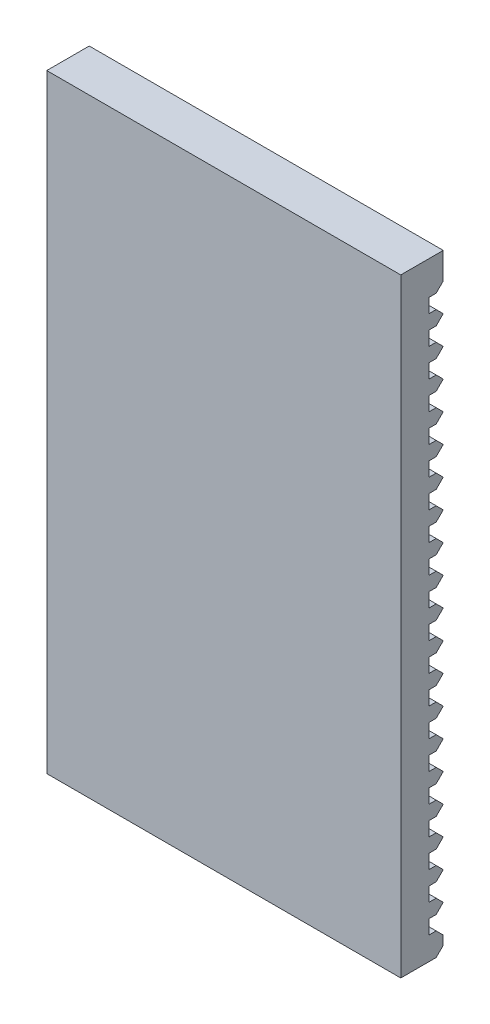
ISO-10303-21;
HEADER;
FILE_DESCRIPTION(('STEP AP214'),'2;1');
FILE_NAME('part.step','',(''),(''),'','','');
FILE_SCHEMA(('AUTOMOTIVE_DESIGN { 1 0 10303 214 1 1 1 1 }'));
ENDSEC;
DATA;
#1=APPLICATION_CONTEXT('core data for automotive mechanical design processes');
#2=APPLICATION_PROTOCOL_DEFINITION('international standard','automotive_design',2000,#1);
#3=PRODUCT_CONTEXT('',#1,'mechanical');
#4=PRODUCT('Part','Part','',(#3));
#5=PRODUCT_RELATED_PRODUCT_CATEGORY('part','',(#4));
#6=PRODUCT_DEFINITION_FORMATION('','',#4);
#7=PRODUCT_DEFINITION_CONTEXT('part definition',#1,'design');
#8=PRODUCT_DEFINITION('design','',#6,#7);
#9=PRODUCT_DEFINITION_SHAPE('','',#8);
#10=(LENGTH_UNIT() NAMED_UNIT(*) SI_UNIT(.MILLI.,.METRE.));
#11=(NAMED_UNIT(*) PLANE_ANGLE_UNIT() SI_UNIT($,.RADIAN.));
#12=(NAMED_UNIT(*) SI_UNIT($,.STERADIAN.) SOLID_ANGLE_UNIT());
#13=UNCERTAINTY_MEASURE_WITH_UNIT(LENGTH_MEASURE(1.E-05),#10,'distance_accuracy_value','');
#14=(GEOMETRIC_REPRESENTATION_CONTEXT(3) GLOBAL_UNCERTAINTY_ASSIGNED_CONTEXT((#13)) GLOBAL_UNIT_ASSIGNED_CONTEXT((#10,
#11,#12)) REPRESENTATION_CONTEXT('',''));
#15=CARTESIAN_POINT('',(0.,0.,0.));
#16=DIRECTION('',(0.,0.,1.));
#17=DIRECTION('',(1.,0.,0.));
#18=AXIS2_PLACEMENT_3D('',#15,#16,#17);
#19=CARTESIAN_POINT('',(0.,0.,0.));
#20=DIRECTION('',(0.,0.,1.));
#21=DIRECTION('',(1.,0.,0.));
#22=AXIS2_PLACEMENT_3D('',#19,#20,#21);
#23=PLANE('',#22);
#24=DIRECTION('',(0.,1.,0.));
#25=VECTOR('',#24,1.);
#26=CARTESIAN_POINT('',(-2.51452637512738,1.29675324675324,0.));
#27=LINE('',#26,#25);
#28=CARTESIAN_POINT('',(-2.51452637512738,1.10985764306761,0.));
#29=VERTEX_POINT('',#28);
#30=CARTESIAN_POINT('',(-2.51452637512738,1.29675324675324,0.));
#31=VERTEX_POINT('',#30);
#32=EDGE_CURVE('E1175',#29,#31,#27,.T.);
#33=ORIENTED_EDGE('',*,*,#32,.F.);
#34=DIRECTION('',(-1.,0.,0.));
#35=VECTOR('',#34,1.);
#36=CARTESIAN_POINT('',(0.,1.10985764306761,0.));
#37=LINE('',#36,#35);
#38=CARTESIAN_POINT('',(-5.01452637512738,1.10985764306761,0.));
#39=VERTEX_POINT('',#38);
#40=EDGE_CURVE('E11',#29,#39,#37,.T.);
#41=ORIENTED_EDGE('',*,*,#40,.T.);
#42=DIRECTION('',(0.,-1.,0.));
#43=VECTOR('',#42,1.);
#44=CARTESIAN_POINT('',(-5.01452637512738,1.29675324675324,0.));
#45=LINE('',#44,#43);
#46=CARTESIAN_POINT('',(-5.01452637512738,1.29675324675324,0.));
#47=VERTEX_POINT('',#46);
#48=EDGE_CURVE('E1172',#47,#39,#45,.T.);
#49=ORIENTED_EDGE('',*,*,#48,.F.);
#50=DIRECTION('',(-1.,0.,0.));
#51=VECTOR('',#50,1.);
#52=CARTESIAN_POINT('',(-5.01452637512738,1.29675324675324,0.));
#53=LINE('',#52,#51);
#54=EDGE_CURVE('E1165',#31,#47,#53,.T.);
#55=ORIENTED_EDGE('',*,*,#54,.F.);
#56=EDGE_LOOP('',(#33,#41,#49,#55));
#57=FACE_BOUND('',#56,.T.);
#58=ADVANCED_FACE('F35',(#57),#23,.F.);
#59=CARTESIAN_POINT('',(-5.01452637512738,1.29675324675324,0.3));
#60=DIRECTION('',(1.,0.,0.));
#61=DIRECTION('',(0.,0.,-1.));
#62=AXIS2_PLACEMENT_3D('',#59,#60,#61);
#63=PLANE('',#62);
#64=CARTESIAN_POINT('',(-5.01452637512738,-2.89014235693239,0.));
#65=VERTEX_POINT('',#64);
#66=CARTESIAN_POINT('',(-5.01452637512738,-2.95324675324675,0.));
#67=VERTEX_POINT('',#66);
#68=EDGE_CURVE('E1152',#65,#67,#45,.T.);
#69=ORIENTED_EDGE('',*,*,#68,.T.);
#70=DIRECTION('',(0.,0.707106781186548,-0.707106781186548));
#71=VECTOR('',#70,1.);
#72=CARTESIAN_POINT('',(-5.01452637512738,-3.00324675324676,0.0500000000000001));
#73=LINE('',#72,#71);
#74=CARTESIAN_POINT('',(-5.01452637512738,-3.00324675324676,0.0500000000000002));
#75=VERTEX_POINT('',#74);
#76=EDGE_CURVE('E1356',#67,#75,#73,.F.);
#77=ORIENTED_EDGE('',*,*,#76,.T.);
#78=DIRECTION('',(0.,0.,-1.));
#79=VECTOR('',#78,1.);
#80=CARTESIAN_POINT('',(-5.01452637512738,-3.00324675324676,0.3));
#81=LINE('',#80,#79);
#82=CARTESIAN_POINT('',(-5.01452637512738,-3.00324675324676,0.3));
#83=VERTEX_POINT('',#82);
#84=EDGE_CURVE('E1186',#83,#75,#81,.T.);
#85=ORIENTED_EDGE('',*,*,#84,.F.);
#86=DIRECTION('',(0.,-1.,0.));
#87=VECTOR('',#86,1.);
#88=CARTESIAN_POINT('',(-5.01452637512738,1.29675324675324,0.3));
#89=LINE('',#88,#87);
#90=CARTESIAN_POINT('',(-5.01452637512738,1.29675324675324,0.3));
#91=VERTEX_POINT('',#90);
#92=EDGE_CURVE('E1161',#91,#83,#89,.T.);
#93=ORIENTED_EDGE('',*,*,#92,.F.);
#94=DIRECTION('',(0.,0.,-1.));
#95=VECTOR('',#94,1.);
#96=CARTESIAN_POINT('',(-5.01452637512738,1.29675324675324,0.3));
#97=LINE('',#96,#95);
#98=EDGE_CURVE('E1171',#91,#47,#97,.T.);
#99=ORIENTED_EDGE('',*,*,#98,.T.);
#100=ORIENTED_EDGE('',*,*,#48,.T.);
#101=DIRECTION('',(0.,0.707106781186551,-0.707106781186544));
#102=VECTOR('',#101,1.);
#103=CARTESIAN_POINT('',(-5.01452637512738,1.05985764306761,0.0499999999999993));
#104=LINE('',#103,#102);
#105=CARTESIAN_POINT('',(-5.01452637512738,1.05985764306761,0.0499999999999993));
#106=VERTEX_POINT('',#105);
#107=EDGE_CURVE('E1277',#39,#106,#104,.F.);
#108=ORIENTED_EDGE('',*,*,#107,.T.);
#109=DIRECTION('',(0.,0.,-1.));
#110=VECTOR('',#109,1.);
#111=CARTESIAN_POINT('',(-5.01452637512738,1.05985764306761,0.1));
#112=LINE('',#111,#110);
#113=CARTESIAN_POINT('',(-5.01452637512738,1.05985764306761,0.1));
#114=VERTEX_POINT('',#113);
#115=EDGE_CURVE('E1153',#114,#106,#112,.T.);
#116=ORIENTED_EDGE('',*,*,#115,.F.);
#117=DIRECTION('',(0.,1.,0.));
#118=VECTOR('',#117,1.);
#119=CARTESIAN_POINT('',(-5.01452637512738,1.05985764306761,0.1));
#120=LINE('',#119,#118);
#121=CARTESIAN_POINT('',(-5.01452637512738,0.959857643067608,0.1));
#122=VERTEX_POINT('',#121);
#123=EDGE_CURVE('E1143',#122,#114,#120,.T.);
#124=ORIENTED_EDGE('',*,*,#123,.F.);
#125=DIRECTION('',(0.,0.,-1.));
#126=VECTOR('',#125,1.);
#127=CARTESIAN_POINT('',(-5.01452637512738,0.959857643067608,0.1));
#128=LINE('',#127,#126);
#129=CARTESIAN_POINT('',(-5.01452637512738,0.959857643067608,0.0499999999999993));
#130=VERTEX_POINT('',#129);
#131=EDGE_CURVE('E1156',#122,#130,#128,.T.);
#132=ORIENTED_EDGE('',*,*,#131,.T.);
#133=DIRECTION('',(0.,0.707106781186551,0.707106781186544));
#134=VECTOR('',#133,1.);
#135=CARTESIAN_POINT('',(-5.01452637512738,0.959857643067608,0.0499999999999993));
#136=LINE('',#135,#134);
#137=CARTESIAN_POINT('',(-5.01452637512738,0.909857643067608,0.));
#138=VERTEX_POINT('',#137);
#139=EDGE_CURVE('E1279',#130,#138,#136,.F.);
#140=ORIENTED_EDGE('',*,*,#139,.T.);
#141=DIRECTION('',(0.,0.707106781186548,-0.707106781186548));
#142=VECTOR('',#141,1.);
#143=CARTESIAN_POINT('',(-5.01452637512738,0.859857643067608,0.0500000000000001));
#144=LINE('',#143,#142);
#145=CARTESIAN_POINT('',(-5.01452637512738,0.859857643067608,0.0500000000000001));
#146=VERTEX_POINT('',#145);
#147=EDGE_CURVE('E1281',#138,#146,#144,.F.);
#148=ORIENTED_EDGE('',*,*,#147,.T.);
#149=DIRECTION('',(0.,0.,-1.));
#150=VECTOR('',#149,1.);
#151=CARTESIAN_POINT('',(-5.01452637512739,0.859857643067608,0.1));
#152=LINE('',#151,#150);
#153=CARTESIAN_POINT('',(-5.01452637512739,0.859857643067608,0.1));
#154=VERTEX_POINT('',#153);
#155=EDGE_CURVE('E1130',#154,#146,#152,.T.);
#156=ORIENTED_EDGE('',*,*,#155,.F.);
#157=DIRECTION('',(0.,1.,0.));
#158=VECTOR('',#157,1.);
#159=CARTESIAN_POINT('',(-5.01452637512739,0.859857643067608,0.1));
#160=LINE('',#159,#158);
#161=CARTESIAN_POINT('',(-5.01452637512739,0.759857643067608,0.1));
#162=VERTEX_POINT('',#161);
#163=EDGE_CURVE('E1120',#162,#154,#160,.T.);
#164=ORIENTED_EDGE('',*,*,#163,.F.);
#165=DIRECTION('',(0.,0.,-1.));
#166=VECTOR('',#165,1.);
#167=CARTESIAN_POINT('',(-5.01452637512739,0.759857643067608,0.1));
#168=LINE('',#167,#166);
#169=CARTESIAN_POINT('',(-5.01452637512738,0.759857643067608,0.0499999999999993));
#170=VERTEX_POINT('',#169);
#171=EDGE_CURVE('E1133',#162,#170,#168,.T.);
#172=ORIENTED_EDGE('',*,*,#171,.T.);
#173=DIRECTION('',(0.,0.707106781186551,0.707106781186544));
#174=VECTOR('',#173,1.);
#175=CARTESIAN_POINT('',(-5.01452637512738,0.759857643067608,0.0499999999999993));
#176=LINE('',#175,#174);
#177=CARTESIAN_POINT('',(-5.01452637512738,0.709857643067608,0.));
#178=VERTEX_POINT('',#177);
#179=EDGE_CURVE('E1283',#170,#178,#176,.F.);
#180=ORIENTED_EDGE('',*,*,#179,.T.);
#181=DIRECTION('',(0.,0.707106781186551,-0.707106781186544));
#182=VECTOR('',#181,1.);
#183=CARTESIAN_POINT('',(-5.01452637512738,0.659857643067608,0.0499999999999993));
#184=LINE('',#183,#182);
#185=CARTESIAN_POINT('',(-5.01452637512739,0.659857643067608,0.0499999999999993));
#186=VERTEX_POINT('',#185);
#187=EDGE_CURVE('E1285',#178,#186,#184,.F.);
#188=ORIENTED_EDGE('',*,*,#187,.T.);
#189=DIRECTION('',(0.,0.,-1.));
#190=VECTOR('',#189,1.);
#191=CARTESIAN_POINT('',(-5.01452637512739,0.659857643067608,0.1));
#192=LINE('',#191,#190);
#193=CARTESIAN_POINT('',(-5.01452637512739,0.659857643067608,0.1));
#194=VERTEX_POINT('',#193);
#195=EDGE_CURVE('E1107',#194,#186,#192,.T.);
#196=ORIENTED_EDGE('',*,*,#195,.F.);
#197=DIRECTION('',(0.,1.,0.));
#198=VECTOR('',#197,1.);
#199=CARTESIAN_POINT('',(-5.01452637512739,0.659857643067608,0.1));
#200=LINE('',#199,#198);
#201=CARTESIAN_POINT('',(-5.01452637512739,0.559857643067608,0.1));
#202=VERTEX_POINT('',#201);
#203=EDGE_CURVE('E1097',#202,#194,#200,.T.);
#204=ORIENTED_EDGE('',*,*,#203,.F.);
#205=DIRECTION('',(0.,0.,-1.));
#206=VECTOR('',#205,1.);
#207=CARTESIAN_POINT('',(-5.01452637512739,0.559857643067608,0.1));
#208=LINE('',#207,#206);
#209=CARTESIAN_POINT('',(-5.01452637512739,0.559857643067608,0.0499999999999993));
#210=VERTEX_POINT('',#209);
#211=EDGE_CURVE('E1110',#202,#210,#208,.T.);
#212=ORIENTED_EDGE('',*,*,#211,.T.);
#213=DIRECTION('',(0.,0.707106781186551,0.707106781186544));
#214=VECTOR('',#213,1.);
#215=CARTESIAN_POINT('',(-5.01452637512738,0.559857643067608,0.0499999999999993));
#216=LINE('',#215,#214);
#217=CARTESIAN_POINT('',(-5.01452637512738,0.509857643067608,0.));
#218=VERTEX_POINT('',#217);
#219=EDGE_CURVE('E1287',#210,#218,#216,.F.);
#220=ORIENTED_EDGE('',*,*,#219,.T.);
#221=DIRECTION('',(0.,0.707106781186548,-0.707106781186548));
#222=VECTOR('',#221,1.);
#223=CARTESIAN_POINT('',(-5.01452637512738,0.459857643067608,0.0500000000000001));
#224=LINE('',#223,#222);
#225=CARTESIAN_POINT('',(-5.01452637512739,0.459857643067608,0.0500000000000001));
#226=VERTEX_POINT('',#225);
#227=EDGE_CURVE('E1289',#218,#226,#224,.F.);
#228=ORIENTED_EDGE('',*,*,#227,.T.);
#229=DIRECTION('',(0.,0.,-1.));
#230=VECTOR('',#229,1.);
#231=CARTESIAN_POINT('',(-5.01452637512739,0.459857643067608,0.1));
#232=LINE('',#231,#230);
#233=CARTESIAN_POINT('',(-5.01452637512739,0.459857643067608,0.1));
#234=VERTEX_POINT('',#233);
#235=EDGE_CURVE('E1084',#234,#226,#232,.T.);
#236=ORIENTED_EDGE('',*,*,#235,.F.);
#237=DIRECTION('',(0.,1.,0.));
#238=VECTOR('',#237,1.);
#239=CARTESIAN_POINT('',(-5.01452637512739,0.459857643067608,0.1));
#240=LINE('',#239,#238);
#241=CARTESIAN_POINT('',(-5.01452637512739,0.359857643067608,0.1));
#242=VERTEX_POINT('',#241);
#243=EDGE_CURVE('E1074',#242,#234,#240,.T.);
#244=ORIENTED_EDGE('',*,*,#243,.F.);
#245=DIRECTION('',(0.,0.,-1.));
#246=VECTOR('',#245,1.);
#247=CARTESIAN_POINT('',(-5.01452637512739,0.359857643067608,0.1));
#248=LINE('',#247,#246);
#249=CARTESIAN_POINT('',(-5.01452637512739,0.359857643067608,0.0500000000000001));
#250=VERTEX_POINT('',#249);
#251=EDGE_CURVE('E1087',#242,#250,#248,.T.);
#252=ORIENTED_EDGE('',*,*,#251,.T.);
#253=DIRECTION('',(0.,0.707106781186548,0.707106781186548));
#254=VECTOR('',#253,1.);
#255=CARTESIAN_POINT('',(-5.01452637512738,0.359857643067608,0.0500000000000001));
#256=LINE('',#255,#254);
#257=CARTESIAN_POINT('',(-5.01452637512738,0.309857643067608,0.));
#258=VERTEX_POINT('',#257);
#259=EDGE_CURVE('E1291',#250,#258,#256,.F.);
#260=ORIENTED_EDGE('',*,*,#259,.T.);
#261=DIRECTION('',(0.,0.707106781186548,-0.707106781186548));
#262=VECTOR('',#261,1.);
#263=CARTESIAN_POINT('',(-5.01452637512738,0.259857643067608,0.0500000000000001));
#264=LINE('',#263,#262);
#265=CARTESIAN_POINT('',(-5.01452637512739,0.259857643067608,0.0500000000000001));
#266=VERTEX_POINT('',#265);
#267=EDGE_CURVE('E1293',#258,#266,#264,.F.);
#268=ORIENTED_EDGE('',*,*,#267,.T.);
#269=DIRECTION('',(0.,0.,-1.));
#270=VECTOR('',#269,1.);
#271=CARTESIAN_POINT('',(-5.01452637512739,0.259857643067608,0.1));
#272=LINE('',#271,#270);
#273=CARTESIAN_POINT('',(-5.01452637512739,0.259857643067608,0.1));
#274=VERTEX_POINT('',#273);
#275=EDGE_CURVE('E1061',#274,#266,#272,.T.);
#276=ORIENTED_EDGE('',*,*,#275,.F.);
#277=DIRECTION('',(0.,1.,0.));
#278=VECTOR('',#277,1.);
#279=CARTESIAN_POINT('',(-5.01452637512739,0.259857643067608,0.1));
#280=LINE('',#279,#278);
#281=CARTESIAN_POINT('',(-5.01452637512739,0.159857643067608,0.1));
#282=VERTEX_POINT('',#281);
#283=EDGE_CURVE('E1051',#282,#274,#280,.T.);
#284=ORIENTED_EDGE('',*,*,#283,.F.);
#285=DIRECTION('',(0.,0.,-1.));
#286=VECTOR('',#285,1.);
#287=CARTESIAN_POINT('',(-5.01452637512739,0.159857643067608,0.1));
#288=LINE('',#287,#286);
#289=CARTESIAN_POINT('',(-5.01452637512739,0.159857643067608,0.0500000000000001));
#290=VERTEX_POINT('',#289);
#291=EDGE_CURVE('E1064',#282,#290,#288,.T.);
#292=ORIENTED_EDGE('',*,*,#291,.T.);
#293=DIRECTION('',(0.,0.707106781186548,0.707106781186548));
#294=VECTOR('',#293,1.);
#295=CARTESIAN_POINT('',(-5.01452637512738,0.159857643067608,0.0500000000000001));
#296=LINE('',#295,#294);
#297=CARTESIAN_POINT('',(-5.01452637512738,0.109857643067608,0.));
#298=VERTEX_POINT('',#297);
#299=EDGE_CURVE('E1295',#290,#298,#296,.F.);
#300=ORIENTED_EDGE('',*,*,#299,.T.);
#301=DIRECTION('',(0.,0.707106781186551,-0.707106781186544));
#302=VECTOR('',#301,1.);
#303=CARTESIAN_POINT('',(-5.01452637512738,0.0598576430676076,0.0499999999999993));
#304=LINE('',#303,#302);
#305=CARTESIAN_POINT('',(-5.01452637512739,0.0598576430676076,0.0499999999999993));
#306=VERTEX_POINT('',#305);
#307=EDGE_CURVE('E1297',#298,#306,#304,.F.);
#308=ORIENTED_EDGE('',*,*,#307,.T.);
#309=DIRECTION('',(0.,0.,-1.));
#310=VECTOR('',#309,1.);
#311=CARTESIAN_POINT('',(-5.01452637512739,0.0598576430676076,0.1));
#312=LINE('',#311,#310);
#313=CARTESIAN_POINT('',(-5.01452637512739,0.0598576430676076,0.1));
#314=VERTEX_POINT('',#313);
#315=EDGE_CURVE('E1038',#314,#306,#312,.T.);
#316=ORIENTED_EDGE('',*,*,#315,.F.);
#317=DIRECTION('',(0.,1.,0.));
#318=VECTOR('',#317,1.);
#319=CARTESIAN_POINT('',(-5.01452637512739,0.0598576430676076,0.1));
#320=LINE('',#319,#318);
#321=CARTESIAN_POINT('',(-5.01452637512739,-0.0401423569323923,0.1));
#322=VERTEX_POINT('',#321);
#323=EDGE_CURVE('E1028',#322,#314,#320,.T.);
#324=ORIENTED_EDGE('',*,*,#323,.F.);
#325=DIRECTION('',(0.,0.,-1.));
#326=VECTOR('',#325,1.);
#327=CARTESIAN_POINT('',(-5.01452637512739,-0.0401423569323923,0.1));
#328=LINE('',#327,#326);
#329=CARTESIAN_POINT('',(-5.01452637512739,-0.0401423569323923,0.0499999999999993));
#330=VERTEX_POINT('',#329);
#331=EDGE_CURVE('E1041',#322,#330,#328,.T.);
#332=ORIENTED_EDGE('',*,*,#331,.T.);
#333=DIRECTION('',(0.,0.707106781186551,0.707106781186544));
#334=VECTOR('',#333,1.);
#335=CARTESIAN_POINT('',(-5.01452637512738,-0.0401423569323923,0.0499999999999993));
#336=LINE('',#335,#334);
#337=CARTESIAN_POINT('',(-5.01452637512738,-0.0901423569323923,0.));
#338=VERTEX_POINT('',#337);
#339=EDGE_CURVE('E1299',#330,#338,#336,.F.);
#340=ORIENTED_EDGE('',*,*,#339,.T.);
#341=DIRECTION('',(0.,0.707106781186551,-0.707106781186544));
#342=VECTOR('',#341,1.);
#343=CARTESIAN_POINT('',(-5.01452637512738,-0.140142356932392,0.0499999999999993));
#344=LINE('',#343,#342);
#345=CARTESIAN_POINT('',(-5.01452637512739,-0.140142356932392,0.0499999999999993));
#346=VERTEX_POINT('',#345);
#347=EDGE_CURVE('E1301',#338,#346,#344,.F.);
#348=ORIENTED_EDGE('',*,*,#347,.T.);
#349=DIRECTION('',(0.,0.,-1.));
#350=VECTOR('',#349,1.);
#351=CARTESIAN_POINT('',(-5.01452637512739,-0.140142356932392,0.1));
#352=LINE('',#351,#350);
#353=CARTESIAN_POINT('',(-5.01452637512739,-0.140142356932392,0.1));
#354=VERTEX_POINT('',#353);
#355=EDGE_CURVE('E1015',#354,#346,#352,.T.);
#356=ORIENTED_EDGE('',*,*,#355,.F.);
#357=DIRECTION('',(0.,1.,0.));
#358=VECTOR('',#357,1.);
#359=CARTESIAN_POINT('',(-5.01452637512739,-0.140142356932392,0.1));
#360=LINE('',#359,#358);
#361=CARTESIAN_POINT('',(-5.01452637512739,-0.240142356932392,0.1));
#362=VERTEX_POINT('',#361);
#363=EDGE_CURVE('E1005',#362,#354,#360,.T.);
#364=ORIENTED_EDGE('',*,*,#363,.F.);
#365=DIRECTION('',(0.,0.,-1.));
#366=VECTOR('',#365,1.);
#367=CARTESIAN_POINT('',(-5.01452637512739,-0.240142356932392,0.1));
#368=LINE('',#367,#366);
#369=CARTESIAN_POINT('',(-5.01452637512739,-0.240142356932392,0.0500000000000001));
#370=VERTEX_POINT('',#369);
#371=EDGE_CURVE('E1018',#362,#370,#368,.T.);
#372=ORIENTED_EDGE('',*,*,#371,.T.);
#373=DIRECTION('',(0.,0.707106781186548,0.707106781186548));
#374=VECTOR('',#373,1.);
#375=CARTESIAN_POINT('',(-5.01452637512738,-0.240142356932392,0.0500000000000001));
#376=LINE('',#375,#374);
#377=CARTESIAN_POINT('',(-5.01452637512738,-0.290142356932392,0.));
#378=VERTEX_POINT('',#377);
#379=EDGE_CURVE('E1303',#370,#378,#376,.F.);
#380=ORIENTED_EDGE('',*,*,#379,.T.);
#381=DIRECTION('',(0.,0.707106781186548,-0.707106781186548));
#382=VECTOR('',#381,1.);
#383=CARTESIAN_POINT('',(-5.01452637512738,-0.340142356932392,0.0500000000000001));
#384=LINE('',#383,#382);
#385=CARTESIAN_POINT('',(-5.01452637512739,-0.340142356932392,0.0500000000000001));
#386=VERTEX_POINT('',#385);
#387=EDGE_CURVE('E1305',#378,#386,#384,.F.);
#388=ORIENTED_EDGE('',*,*,#387,.T.);
#389=DIRECTION('',(0.,0.,-1.));
#390=VECTOR('',#389,1.);
#391=CARTESIAN_POINT('',(-5.0145263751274,-0.340142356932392,0.1));
#392=LINE('',#391,#390);
#393=CARTESIAN_POINT('',(-5.0145263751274,-0.340142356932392,0.1));
#394=VERTEX_POINT('',#393);
#395=EDGE_CURVE('E992',#394,#386,#392,.T.);
#396=ORIENTED_EDGE('',*,*,#395,.F.);
#397=DIRECTION('',(0.,1.,0.));
#398=VECTOR('',#397,1.);
#399=CARTESIAN_POINT('',(-5.0145263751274,-0.340142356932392,0.1));
#400=LINE('',#399,#398);
#401=CARTESIAN_POINT('',(-5.0145263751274,-0.440142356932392,0.1));
#402=VERTEX_POINT('',#401);
#403=EDGE_CURVE('E982',#402,#394,#400,.T.);
#404=ORIENTED_EDGE('',*,*,#403,.F.);
#405=DIRECTION('',(0.,0.,-1.));
#406=VECTOR('',#405,1.);
#407=CARTESIAN_POINT('',(-5.0145263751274,-0.440142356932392,0.1));
#408=LINE('',#407,#406);
#409=CARTESIAN_POINT('',(-5.01452637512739,-0.440142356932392,0.0500000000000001));
#410=VERTEX_POINT('',#409);
#411=EDGE_CURVE('E995',#402,#410,#408,.T.);
#412=ORIENTED_EDGE('',*,*,#411,.T.);
#413=DIRECTION('',(0.,0.707106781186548,0.707106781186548));
#414=VECTOR('',#413,1.);
#415=CARTESIAN_POINT('',(-5.01452637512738,-0.440142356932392,0.0500000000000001));
#416=LINE('',#415,#414);
#417=CARTESIAN_POINT('',(-5.01452637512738,-0.490142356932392,0.));
#418=VERTEX_POINT('',#417);
#419=EDGE_CURVE('E1307',#410,#418,#416,.F.);
#420=ORIENTED_EDGE('',*,*,#419,.T.);
#421=DIRECTION('',(0.,0.707106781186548,-0.707106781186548));
#422=VECTOR('',#421,1.);
#423=CARTESIAN_POINT('',(-5.01452637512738,-0.540142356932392,0.0500000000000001));
#424=LINE('',#423,#422);
#425=CARTESIAN_POINT('',(-5.01452637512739,-0.540142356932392,0.0500000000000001));
#426=VERTEX_POINT('',#425);
#427=EDGE_CURVE('E1309',#418,#426,#424,.F.);
#428=ORIENTED_EDGE('',*,*,#427,.T.);
#429=DIRECTION('',(0.,0.,-1.));
#430=VECTOR('',#429,1.);
#431=CARTESIAN_POINT('',(-5.0145263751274,-0.540142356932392,0.1));
#432=LINE('',#431,#430);
#433=CARTESIAN_POINT('',(-5.0145263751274,-0.540142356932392,0.1));
#434=VERTEX_POINT('',#433);
#435=EDGE_CURVE('E969',#434,#426,#432,.T.);
#436=ORIENTED_EDGE('',*,*,#435,.F.);
#437=DIRECTION('',(0.,1.,0.));
#438=VECTOR('',#437,1.);
#439=CARTESIAN_POINT('',(-5.0145263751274,-0.540142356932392,0.1));
#440=LINE('',#439,#438);
#441=CARTESIAN_POINT('',(-5.0145263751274,-0.640142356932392,0.1));
#442=VERTEX_POINT('',#441);
#443=EDGE_CURVE('E959',#442,#434,#440,.T.);
#444=ORIENTED_EDGE('',*,*,#443,.F.);
#445=DIRECTION('',(0.,0.,-1.));
#446=VECTOR('',#445,1.);
#447=CARTESIAN_POINT('',(-5.0145263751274,-0.640142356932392,0.1));
#448=LINE('',#447,#446);
#449=CARTESIAN_POINT('',(-5.01452637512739,-0.640142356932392,0.0500000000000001));
#450=VERTEX_POINT('',#449);
#451=EDGE_CURVE('E972',#442,#450,#448,.T.);
#452=ORIENTED_EDGE('',*,*,#451,.T.);
#453=DIRECTION('',(0.,0.707106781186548,0.707106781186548));
#454=VECTOR('',#453,1.);
#455=CARTESIAN_POINT('',(-5.01452637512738,-0.640142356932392,0.0500000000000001));
#456=LINE('',#455,#454);
#457=CARTESIAN_POINT('',(-5.01452637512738,-0.690142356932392,0.));
#458=VERTEX_POINT('',#457);
#459=EDGE_CURVE('E1311',#450,#458,#456,.F.);
#460=ORIENTED_EDGE('',*,*,#459,.T.);
#461=DIRECTION('',(0.,0.707106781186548,-0.707106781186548));
#462=VECTOR('',#461,1.);
#463=CARTESIAN_POINT('',(-5.01452637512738,-0.740142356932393,0.0500000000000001));
#464=LINE('',#463,#462);
#465=CARTESIAN_POINT('',(-5.01452637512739,-0.740142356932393,0.0500000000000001));
#466=VERTEX_POINT('',#465);
#467=EDGE_CURVE('E1313',#458,#466,#464,.F.);
#468=ORIENTED_EDGE('',*,*,#467,.T.);
#469=DIRECTION('',(0.,0.,-1.));
#470=VECTOR('',#469,1.);
#471=CARTESIAN_POINT('',(-5.0145263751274,-0.740142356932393,0.1));
#472=LINE('',#471,#470);
#473=CARTESIAN_POINT('',(-5.0145263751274,-0.740142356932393,0.1));
#474=VERTEX_POINT('',#473);
#475=EDGE_CURVE('E946',#474,#466,#472,.T.);
#476=ORIENTED_EDGE('',*,*,#475,.F.);
#477=DIRECTION('',(0.,1.,0.));
#478=VECTOR('',#477,1.);
#479=CARTESIAN_POINT('',(-5.0145263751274,-0.740142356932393,0.1));
#480=LINE('',#479,#478);
#481=CARTESIAN_POINT('',(-5.0145263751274,-0.840142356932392,0.1));
#482=VERTEX_POINT('',#481);
#483=EDGE_CURVE('E936',#482,#474,#480,.T.);
#484=ORIENTED_EDGE('',*,*,#483,.F.);
#485=DIRECTION('',(0.,0.,-1.));
#486=VECTOR('',#485,1.);
#487=CARTESIAN_POINT('',(-5.0145263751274,-0.840142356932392,0.1));
#488=LINE('',#487,#486);
#489=CARTESIAN_POINT('',(-5.01452637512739,-0.840142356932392,0.0500000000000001));
#490=VERTEX_POINT('',#489);
#491=EDGE_CURVE('E949',#482,#490,#488,.T.);
#492=ORIENTED_EDGE('',*,*,#491,.T.);
#493=DIRECTION('',(0.,0.707106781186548,0.707106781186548));
#494=VECTOR('',#493,1.);
#495=CARTESIAN_POINT('',(-5.01452637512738,-0.840142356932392,0.0500000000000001));
#496=LINE('',#495,#494);
#497=CARTESIAN_POINT('',(-5.01452637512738,-0.890142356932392,0.));
#498=VERTEX_POINT('',#497);
#499=EDGE_CURVE('E1315',#490,#498,#496,.F.);
#500=ORIENTED_EDGE('',*,*,#499,.T.);
#501=DIRECTION('',(0.,0.707106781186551,-0.707106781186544));
#502=VECTOR('',#501,1.);
#503=CARTESIAN_POINT('',(-5.01452637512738,-0.940142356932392,0.0499999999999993));
#504=LINE('',#503,#502);
#505=CARTESIAN_POINT('',(-5.01452637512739,-0.940142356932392,0.0499999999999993));
#506=VERTEX_POINT('',#505);
#507=EDGE_CURVE('E1317',#498,#506,#504,.F.);
#508=ORIENTED_EDGE('',*,*,#507,.T.);
#509=DIRECTION('',(0.,0.,-1.));
#510=VECTOR('',#509,1.);
#511=CARTESIAN_POINT('',(-5.0145263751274,-0.940142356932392,0.1));
#512=LINE('',#511,#510);
#513=CARTESIAN_POINT('',(-5.0145263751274,-0.940142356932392,0.1));
#514=VERTEX_POINT('',#513);
#515=EDGE_CURVE('E923',#514,#506,#512,.T.);
#516=ORIENTED_EDGE('',*,*,#515,.F.);
#517=DIRECTION('',(0.,1.,0.));
#518=VECTOR('',#517,1.);
#519=CARTESIAN_POINT('',(-5.0145263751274,-0.940142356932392,0.1));
#520=LINE('',#519,#518);
#521=CARTESIAN_POINT('',(-5.0145263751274,-1.04014235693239,0.1));
#522=VERTEX_POINT('',#521);
#523=EDGE_CURVE('E913',#522,#514,#520,.T.);
#524=ORIENTED_EDGE('',*,*,#523,.F.);
#525=DIRECTION('',(0.,0.,-1.));
#526=VECTOR('',#525,1.);
#527=CARTESIAN_POINT('',(-5.0145263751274,-1.04014235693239,0.1));
#528=LINE('',#527,#526);
#529=CARTESIAN_POINT('',(-5.01452637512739,-1.04014235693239,0.0499999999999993));
#530=VERTEX_POINT('',#529);
#531=EDGE_CURVE('E926',#522,#530,#528,.T.);
#532=ORIENTED_EDGE('',*,*,#531,.T.);
#533=DIRECTION('',(0.,0.707106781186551,0.707106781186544));
#534=VECTOR('',#533,1.);
#535=CARTESIAN_POINT('',(-5.01452637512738,-1.04014235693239,0.0499999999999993));
#536=LINE('',#535,#534);
#537=CARTESIAN_POINT('',(-5.01452637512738,-1.09014235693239,0.));
#538=VERTEX_POINT('',#537);
#539=EDGE_CURVE('E1319',#530,#538,#536,.F.);
#540=ORIENTED_EDGE('',*,*,#539,.T.);
#541=DIRECTION('',(0.,0.707106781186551,-0.707106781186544));
#542=VECTOR('',#541,1.);
#543=CARTESIAN_POINT('',(-5.01452637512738,-1.14014235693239,0.0499999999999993));
#544=LINE('',#543,#542);
#545=CARTESIAN_POINT('',(-5.01452637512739,-1.14014235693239,0.0499999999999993));
#546=VERTEX_POINT('',#545);
#547=EDGE_CURVE('E1321',#538,#546,#544,.F.);
#548=ORIENTED_EDGE('',*,*,#547,.T.);
#549=DIRECTION('',(0.,0.,-1.));
#550=VECTOR('',#549,1.);
#551=CARTESIAN_POINT('',(-5.01452637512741,-1.14014235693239,0.1));
#552=LINE('',#551,#550);
#553=CARTESIAN_POINT('',(-5.01452637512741,-1.14014235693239,0.1));
#554=VERTEX_POINT('',#553);
#555=EDGE_CURVE('E900',#554,#546,#552,.T.);
#556=ORIENTED_EDGE('',*,*,#555,.F.);
#557=DIRECTION('',(0.,1.,0.));
#558=VECTOR('',#557,1.);
#559=CARTESIAN_POINT('',(-5.01452637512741,-1.14014235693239,0.1));
#560=LINE('',#559,#558);
#561=CARTESIAN_POINT('',(-5.01452637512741,-1.24014235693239,0.1));
#562=VERTEX_POINT('',#561);
#563=EDGE_CURVE('E890',#562,#554,#560,.T.);
#564=ORIENTED_EDGE('',*,*,#563,.F.);
#565=DIRECTION('',(0.,0.,-1.));
#566=VECTOR('',#565,1.);
#567=CARTESIAN_POINT('',(-5.01452637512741,-1.24014235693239,0.1));
#568=LINE('',#567,#566);
#569=CARTESIAN_POINT('',(-5.01452637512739,-1.24014235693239,0.0500000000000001));
#570=VERTEX_POINT('',#569);
#571=EDGE_CURVE('E903',#562,#570,#568,.T.);
#572=ORIENTED_EDGE('',*,*,#571,.T.);
#573=DIRECTION('',(0.,0.707106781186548,0.707106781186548));
#574=VECTOR('',#573,1.);
#575=CARTESIAN_POINT('',(-5.01452637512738,-1.24014235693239,0.0500000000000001));
#576=LINE('',#575,#574);
#577=CARTESIAN_POINT('',(-5.01452637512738,-1.29014235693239,0.));
#578=VERTEX_POINT('',#577);
#579=EDGE_CURVE('E1323',#570,#578,#576,.F.);
#580=ORIENTED_EDGE('',*,*,#579,.T.);
#581=DIRECTION('',(0.,0.707106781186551,-0.707106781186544));
#582=VECTOR('',#581,1.);
#583=CARTESIAN_POINT('',(-5.01452637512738,-1.34014235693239,0.0499999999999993));
#584=LINE('',#583,#582);
#585=CARTESIAN_POINT('',(-5.0145263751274,-1.34014235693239,0.0499999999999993));
#586=VERTEX_POINT('',#585);
#587=EDGE_CURVE('E1325',#578,#586,#584,.F.);
#588=ORIENTED_EDGE('',*,*,#587,.T.);
#589=DIRECTION('',(0.,0.,-1.));
#590=VECTOR('',#589,1.);
#591=CARTESIAN_POINT('',(-5.01452637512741,-1.34014235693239,0.1));
#592=LINE('',#591,#590);
#593=CARTESIAN_POINT('',(-5.01452637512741,-1.34014235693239,0.1));
#594=VERTEX_POINT('',#593);
#595=EDGE_CURVE('E877',#594,#586,#592,.T.);
#596=ORIENTED_EDGE('',*,*,#595,.F.);
#597=DIRECTION('',(0.,1.,0.));
#598=VECTOR('',#597,1.);
#599=CARTESIAN_POINT('',(-5.01452637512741,-1.34014235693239,0.1));
#600=LINE('',#599,#598);
#601=CARTESIAN_POINT('',(-5.01452637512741,-1.44014235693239,0.1));
#602=VERTEX_POINT('',#601);
#603=EDGE_CURVE('E867',#602,#594,#600,.T.);
#604=ORIENTED_EDGE('',*,*,#603,.F.);
#605=DIRECTION('',(0.,0.,-1.));
#606=VECTOR('',#605,1.);
#607=CARTESIAN_POINT('',(-5.01452637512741,-1.44014235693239,0.1));
#608=LINE('',#607,#606);
#609=CARTESIAN_POINT('',(-5.0145263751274,-1.44014235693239,0.0499999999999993));
#610=VERTEX_POINT('',#609);
#611=EDGE_CURVE('E880',#602,#610,#608,.T.);
#612=ORIENTED_EDGE('',*,*,#611,.T.);
#613=DIRECTION('',(0.,0.707106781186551,0.707106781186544));
#614=VECTOR('',#613,1.);
#615=CARTESIAN_POINT('',(-5.01452637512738,-1.44014235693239,0.0499999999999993));
#616=LINE('',#615,#614);
#617=CARTESIAN_POINT('',(-5.01452637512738,-1.49014235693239,0.));
#618=VERTEX_POINT('',#617);
#619=EDGE_CURVE('E1327',#610,#618,#616,.F.);
#620=ORIENTED_EDGE('',*,*,#619,.T.);
#621=DIRECTION('',(0.,0.707106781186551,-0.707106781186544));
#622=VECTOR('',#621,1.);
#623=CARTESIAN_POINT('',(-5.01452637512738,-1.54014235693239,0.0499999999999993));
#624=LINE('',#623,#622);
#625=CARTESIAN_POINT('',(-5.0145263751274,-1.54014235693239,0.0499999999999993));
#626=VERTEX_POINT('',#625);
#627=EDGE_CURVE('E1329',#618,#626,#624,.F.);
#628=ORIENTED_EDGE('',*,*,#627,.T.);
#629=DIRECTION('',(0.,0.,-1.));
#630=VECTOR('',#629,1.);
#631=CARTESIAN_POINT('',(-5.01452637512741,-1.54014235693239,0.1));
#632=LINE('',#631,#630);
#633=CARTESIAN_POINT('',(-5.01452637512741,-1.54014235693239,0.1));
#634=VERTEX_POINT('',#633);
#635=EDGE_CURVE('E854',#634,#626,#632,.T.);
#636=ORIENTED_EDGE('',*,*,#635,.F.);
#637=DIRECTION('',(0.,1.,0.));
#638=VECTOR('',#637,1.);
#639=CARTESIAN_POINT('',(-5.01452637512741,-1.54014235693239,0.1));
#640=LINE('',#639,#638);
#641=CARTESIAN_POINT('',(-5.01452637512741,-1.64014235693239,0.1));
#642=VERTEX_POINT('',#641);
#643=EDGE_CURVE('E844',#642,#634,#640,.T.);
#644=ORIENTED_EDGE('',*,*,#643,.F.);
#645=DIRECTION('',(0.,0.,-1.));
#646=VECTOR('',#645,1.);
#647=CARTESIAN_POINT('',(-5.01452637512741,-1.64014235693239,0.1));
#648=LINE('',#647,#646);
#649=CARTESIAN_POINT('',(-5.0145263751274,-1.64014235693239,0.0500000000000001));
#650=VERTEX_POINT('',#649);
#651=EDGE_CURVE('E857',#642,#650,#648,.T.);
#652=ORIENTED_EDGE('',*,*,#651,.T.);
#653=DIRECTION('',(0.,0.707106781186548,0.707106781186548));
#654=VECTOR('',#653,1.);
#655=CARTESIAN_POINT('',(-5.01452637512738,-1.64014235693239,0.0500000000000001));
#656=LINE('',#655,#654);
#657=CARTESIAN_POINT('',(-5.01452637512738,-1.69014235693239,0.));
#658=VERTEX_POINT('',#657);
#659=EDGE_CURVE('E1331',#650,#658,#656,.F.);
#660=ORIENTED_EDGE('',*,*,#659,.T.);
#661=DIRECTION('',(0.,0.707106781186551,-0.707106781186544));
#662=VECTOR('',#661,1.);
#663=CARTESIAN_POINT('',(-5.01452637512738,-1.74014235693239,0.0499999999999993));
#664=LINE('',#663,#662);
#665=CARTESIAN_POINT('',(-5.0145263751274,-1.74014235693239,0.0499999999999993));
#666=VERTEX_POINT('',#665);
#667=EDGE_CURVE('E1333',#658,#666,#664,.F.);
#668=ORIENTED_EDGE('',*,*,#667,.T.);
#669=DIRECTION('',(0.,0.,-1.));
#670=VECTOR('',#669,1.);
#671=CARTESIAN_POINT('',(-5.01452637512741,-1.74014235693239,0.1));
#672=LINE('',#671,#670);
#673=CARTESIAN_POINT('',(-5.01452637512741,-1.74014235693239,0.1));
#674=VERTEX_POINT('',#673);
#675=EDGE_CURVE('E831',#674,#666,#672,.T.);
#676=ORIENTED_EDGE('',*,*,#675,.F.);
#677=DIRECTION('',(0.,1.,0.));
#678=VECTOR('',#677,1.);
#679=CARTESIAN_POINT('',(-5.01452637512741,-1.74014235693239,0.1));
#680=LINE('',#679,#678);
#681=CARTESIAN_POINT('',(-5.01452637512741,-1.84014235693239,0.1));
#682=VERTEX_POINT('',#681);
#683=EDGE_CURVE('E821',#682,#674,#680,.T.);
#684=ORIENTED_EDGE('',*,*,#683,.F.);
#685=DIRECTION('',(0.,0.,-1.));
#686=VECTOR('',#685,1.);
#687=CARTESIAN_POINT('',(-5.01452637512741,-1.84014235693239,0.1));
#688=LINE('',#687,#686);
#689=CARTESIAN_POINT('',(-5.0145263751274,-1.84014235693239,0.0500000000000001));
#690=VERTEX_POINT('',#689);
#691=EDGE_CURVE('E834',#682,#690,#688,.T.);
#692=ORIENTED_EDGE('',*,*,#691,.T.);
#693=DIRECTION('',(0.,0.707106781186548,0.707106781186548));
#694=VECTOR('',#693,1.);
#695=CARTESIAN_POINT('',(-5.01452637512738,-1.84014235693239,0.0500000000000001));
#696=LINE('',#695,#694);
#697=CARTESIAN_POINT('',(-5.01452637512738,-1.89014235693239,0.));
#698=VERTEX_POINT('',#697);
#699=EDGE_CURVE('E1335',#690,#698,#696,.F.);
#700=ORIENTED_EDGE('',*,*,#699,.T.);
#701=DIRECTION('',(0.,0.707106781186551,-0.707106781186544));
#702=VECTOR('',#701,1.);
#703=CARTESIAN_POINT('',(-5.01452637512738,-1.94014235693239,0.0499999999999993));
#704=LINE('',#703,#702);
#705=CARTESIAN_POINT('',(-5.0145263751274,-1.94014235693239,0.0499999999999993));
#706=VERTEX_POINT('',#705);
#707=EDGE_CURVE('E1337',#698,#706,#704,.F.);
#708=ORIENTED_EDGE('',*,*,#707,.T.);
#709=DIRECTION('',(0.,0.,-1.));
#710=VECTOR('',#709,1.);
#711=CARTESIAN_POINT('',(-5.01452637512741,-1.94014235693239,0.1));
#712=LINE('',#711,#710);
#713=CARTESIAN_POINT('',(-5.01452637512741,-1.94014235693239,0.1));
#714=VERTEX_POINT('',#713);
#715=EDGE_CURVE('E808',#714,#706,#712,.T.);
#716=ORIENTED_EDGE('',*,*,#715,.F.);
#717=DIRECTION('',(0.,1.,0.));
#718=VECTOR('',#717,1.);
#719=CARTESIAN_POINT('',(-5.01452637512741,-1.94014235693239,0.1));
#720=LINE('',#719,#718);
#721=CARTESIAN_POINT('',(-5.01452637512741,-2.04014235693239,0.1));
#722=VERTEX_POINT('',#721);
#723=EDGE_CURVE('E798',#722,#714,#720,.T.);
#724=ORIENTED_EDGE('',*,*,#723,.F.);
#725=DIRECTION('',(0.,0.,-1.));
#726=VECTOR('',#725,1.);
#727=CARTESIAN_POINT('',(-5.01452637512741,-2.04014235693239,0.1));
#728=LINE('',#727,#726);
#729=CARTESIAN_POINT('',(-5.0145263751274,-2.04014235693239,0.0500000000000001));
#730=VERTEX_POINT('',#729);
#731=EDGE_CURVE('E811',#722,#730,#728,.T.);
#732=ORIENTED_EDGE('',*,*,#731,.T.);
#733=DIRECTION('',(0.,0.707106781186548,0.707106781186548));
#734=VECTOR('',#733,1.);
#735=CARTESIAN_POINT('',(-5.01452637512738,-2.04014235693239,0.0500000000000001));
#736=LINE('',#735,#734);
#737=CARTESIAN_POINT('',(-5.01452637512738,-2.09014235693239,0.));
#738=VERTEX_POINT('',#737);
#739=EDGE_CURVE('E1339',#730,#738,#736,.F.);
#740=ORIENTED_EDGE('',*,*,#739,.T.);
#741=DIRECTION('',(0.,0.707106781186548,-0.707106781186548));
#742=VECTOR('',#741,1.);
#743=CARTESIAN_POINT('',(-5.01452637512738,-2.14014235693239,0.0500000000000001));
#744=LINE('',#743,#742);
#745=CARTESIAN_POINT('',(-5.0145263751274,-2.14014235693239,0.0500000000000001));
#746=VERTEX_POINT('',#745);
#747=EDGE_CURVE('E1341',#738,#746,#744,.F.);
#748=ORIENTED_EDGE('',*,*,#747,.T.);
#749=DIRECTION('',(0.,0.,-1.));
#750=VECTOR('',#749,1.);
#751=CARTESIAN_POINT('',(-5.01452637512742,-2.14014235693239,0.1));
#752=LINE('',#751,#750);
#753=CARTESIAN_POINT('',(-5.01452637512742,-2.14014235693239,0.1));
#754=VERTEX_POINT('',#753);
#755=EDGE_CURVE('E785',#754,#746,#752,.T.);
#756=ORIENTED_EDGE('',*,*,#755,.F.);
#757=DIRECTION('',(0.,1.,0.));
#758=VECTOR('',#757,1.);
#759=CARTESIAN_POINT('',(-5.01452637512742,-2.14014235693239,0.1));
#760=LINE('',#759,#758);
#761=CARTESIAN_POINT('',(-5.01452637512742,-2.24014235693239,0.1));
#762=VERTEX_POINT('',#761);
#763=EDGE_CURVE('E775',#762,#754,#760,.T.);
#764=ORIENTED_EDGE('',*,*,#763,.F.);
#765=DIRECTION('',(0.,0.,-1.));
#766=VECTOR('',#765,1.);
#767=CARTESIAN_POINT('',(-5.01452637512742,-2.24014235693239,0.1));
#768=LINE('',#767,#766);
#769=CARTESIAN_POINT('',(-5.0145263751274,-2.24014235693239,0.0500000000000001));
#770=VERTEX_POINT('',#769);
#771=EDGE_CURVE('E788',#762,#770,#768,.T.);
#772=ORIENTED_EDGE('',*,*,#771,.T.);
#773=DIRECTION('',(0.,0.707106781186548,0.707106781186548));
#774=VECTOR('',#773,1.);
#775=CARTESIAN_POINT('',(-5.01452637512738,-2.24014235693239,0.0500000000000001));
#776=LINE('',#775,#774);
#777=CARTESIAN_POINT('',(-5.01452637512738,-2.29014235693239,0.));
#778=VERTEX_POINT('',#777);
#779=EDGE_CURVE('E1343',#770,#778,#776,.F.);
#780=ORIENTED_EDGE('',*,*,#779,.T.);
#781=DIRECTION('',(0.,0.707106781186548,-0.707106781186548));
#782=VECTOR('',#781,1.);
#783=CARTESIAN_POINT('',(-5.01452637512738,-2.34014235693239,0.0500000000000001));
#784=LINE('',#783,#782);
#785=CARTESIAN_POINT('',(-5.0145263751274,-2.34014235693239,0.0500000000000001));
#786=VERTEX_POINT('',#785);
#787=EDGE_CURVE('E1345',#778,#786,#784,.F.);
#788=ORIENTED_EDGE('',*,*,#787,.T.);
#789=DIRECTION('',(0.,0.,-1.));
#790=VECTOR('',#789,1.);
#791=CARTESIAN_POINT('',(-5.01452637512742,-2.34014235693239,0.1));
#792=LINE('',#791,#790);
#793=CARTESIAN_POINT('',(-5.01452637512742,-2.34014235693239,0.1));
#794=VERTEX_POINT('',#793);
#795=EDGE_CURVE('E762',#794,#786,#792,.T.);
#796=ORIENTED_EDGE('',*,*,#795,.F.);
#797=DIRECTION('',(0.,1.,0.));
#798=VECTOR('',#797,1.);
#799=CARTESIAN_POINT('',(-5.01452637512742,-2.34014235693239,0.1));
#800=LINE('',#799,#798);
#801=CARTESIAN_POINT('',(-5.01452637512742,-2.44014235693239,0.1));
#802=VERTEX_POINT('',#801);
#803=EDGE_CURVE('E752',#802,#794,#800,.T.);
#804=ORIENTED_EDGE('',*,*,#803,.F.);
#805=DIRECTION('',(0.,0.,-1.));
#806=VECTOR('',#805,1.);
#807=CARTESIAN_POINT('',(-5.01452637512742,-2.44014235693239,0.1));
#808=LINE('',#807,#806);
#809=CARTESIAN_POINT('',(-5.0145263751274,-2.44014235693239,0.0499999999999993));
#810=VERTEX_POINT('',#809);
#811=EDGE_CURVE('E765',#802,#810,#808,.T.);
#812=ORIENTED_EDGE('',*,*,#811,.T.);
#813=DIRECTION('',(0.,0.707106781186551,0.707106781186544));
#814=VECTOR('',#813,1.);
#815=CARTESIAN_POINT('',(-5.01452637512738,-2.44014235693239,0.0499999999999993));
#816=LINE('',#815,#814);
#817=CARTESIAN_POINT('',(-5.01452637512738,-2.49014235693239,0.));
#818=VERTEX_POINT('',#817);
#819=EDGE_CURVE('E1347',#810,#818,#816,.F.);
#820=ORIENTED_EDGE('',*,*,#819,.T.);
#821=DIRECTION('',(0.,0.707106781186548,-0.707106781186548));
#822=VECTOR('',#821,1.);
#823=CARTESIAN_POINT('',(-5.01452637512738,-2.54014235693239,0.0500000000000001));
#824=LINE('',#823,#822);
#825=CARTESIAN_POINT('',(-5.0145263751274,-2.54014235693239,0.0500000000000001));
#826=VERTEX_POINT('',#825);
#827=EDGE_CURVE('E60',#818,#826,#824,.F.);
#828=ORIENTED_EDGE('',*,*,#827,.T.);
#829=DIRECTION('',(0.,0.,-1.));
#830=VECTOR('',#829,1.);
#831=CARTESIAN_POINT('',(-5.01452637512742,-2.54014235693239,0.1));
#832=LINE('',#831,#830);
#833=CARTESIAN_POINT('',(-5.01452637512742,-2.54014235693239,0.1));
#834=VERTEX_POINT('',#833);
#835=EDGE_CURVE('E742',#834,#826,#832,.T.);
#836=ORIENTED_EDGE('',*,*,#835,.F.);
#837=DIRECTION('',(0.,1.,0.));
#838=VECTOR('',#837,1.);
#839=CARTESIAN_POINT('',(-5.01452637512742,-2.54014235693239,0.1));
#840=LINE('',#839,#838);
#841=CARTESIAN_POINT('',(-5.01452637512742,-2.64014235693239,0.1));
#842=VERTEX_POINT('',#841);
#843=EDGE_CURVE('E732',#842,#834,#840,.T.);
#844=ORIENTED_EDGE('',*,*,#843,.F.);
#845=DIRECTION('',(0.,0.,-1.));
#846=VECTOR('',#845,1.);
#847=CARTESIAN_POINT('',(-5.01452637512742,-2.64014235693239,0.1));
#848=LINE('',#847,#846);
#849=CARTESIAN_POINT('',(-5.0145263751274,-2.64014235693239,0.0500000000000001));
#850=VERTEX_POINT('',#849);
#851=EDGE_CURVE('E744',#842,#850,#848,.T.);
#852=ORIENTED_EDGE('',*,*,#851,.T.);
#853=DIRECTION('',(0.,0.707106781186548,0.707106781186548));
#854=VECTOR('',#853,1.);
#855=CARTESIAN_POINT('',(-5.01452637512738,-2.64014235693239,0.0500000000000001));
#856=LINE('',#855,#854);
#857=CARTESIAN_POINT('',(-5.01452637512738,-2.69014235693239,0.));
#858=VERTEX_POINT('',#857);
#859=EDGE_CURVE('E1350',#850,#858,#856,.F.);
#860=ORIENTED_EDGE('',*,*,#859,.T.);
#861=DIRECTION('',(0.,0.707106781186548,-0.707106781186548));
#862=VECTOR('',#861,1.);
#863=CARTESIAN_POINT('',(-5.01452637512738,-2.74014235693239,0.0500000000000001));
#864=LINE('',#863,#862);
#865=CARTESIAN_POINT('',(-5.0145263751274,-2.74014235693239,0.0500000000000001));
#866=VERTEX_POINT('',#865);
#867=EDGE_CURVE('E1352',#858,#866,#864,.F.);
#868=ORIENTED_EDGE('',*,*,#867,.T.);
#869=DIRECTION('',(0.,0.,-1.));
#870=VECTOR('',#869,1.);
#871=CARTESIAN_POINT('',(-5.01452637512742,-2.74014235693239,0.1));
#872=LINE('',#871,#870);
#873=CARTESIAN_POINT('',(-5.01452637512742,-2.74014235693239,0.1));
#874=VERTEX_POINT('',#873);
#875=EDGE_CURVE('E720',#874,#866,#872,.T.);
#876=ORIENTED_EDGE('',*,*,#875,.F.);
#877=DIRECTION('',(0.,1.,0.));
#878=VECTOR('',#877,1.);
#879=CARTESIAN_POINT('',(-5.01452637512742,-2.74014235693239,0.1));
#880=LINE('',#879,#878);
#881=CARTESIAN_POINT('',(-5.01452637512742,-2.84014235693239,0.1));
#882=VERTEX_POINT('',#881);
#883=EDGE_CURVE('E702',#882,#874,#880,.T.);
#884=ORIENTED_EDGE('',*,*,#883,.F.);
#885=DIRECTION('',(0.,0.,-1.));
#886=VECTOR('',#885,1.);
#887=CARTESIAN_POINT('',(-5.01452637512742,-2.84014235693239,0.1));
#888=LINE('',#887,#886);
#889=CARTESIAN_POINT('',(-5.0145263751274,-2.84014235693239,0.0500000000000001));
#890=VERTEX_POINT('',#889);
#891=EDGE_CURVE('E699',#882,#890,#888,.T.);
#892=ORIENTED_EDGE('',*,*,#891,.T.);
#893=DIRECTION('',(0.,0.707106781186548,0.707106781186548));
#894=VECTOR('',#893,1.);
#895=CARTESIAN_POINT('',(-5.01452637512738,-2.84014235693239,0.0500000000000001));
#896=LINE('',#895,#894);
#897=EDGE_CURVE('E1354',#890,#65,#896,.F.);
#898=ORIENTED_EDGE('',*,*,#897,.T.);
#899=EDGE_LOOP('',(#69,#77,#85,#93,#99,#100,#108,#116,#124,#132,#140,#148,#156,#164,#172,#180,
#188,#196,#204,#212,#220,#228,#236,#244,#252,#260,#268,#276,#284,#292,#300,#308,#316,#324,#332,
#340,#348,#356,#364,#372,#380,#388,#396,#404,#412,#420,#428,#436,#444,#452,#460,#468,#476,#484,
#492,#500,#508,#516,#524,#532,#540,#548,#556,#564,#572,#580,#588,#596,#604,#612,#620,#628,#636,
#644,#652,#660,#668,#676,#684,#692,#700,#708,#716,#724,#732,#740,#748,#756,#764,#772,#780,#788,
#796,#804,#812,#820,#828,#836,#844,#852,#860,#868,#876,#884,#892,#898));
#900=FACE_BOUND('',#899,.T.);
#901=ADVANCED_FACE('F1541',(#900),#63,.F.);
#902=CARTESIAN_POINT('',(-5.01452637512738,-3.00324675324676,0.3));
#903=DIRECTION('',(0.,1.,0.));
#904=DIRECTION('',(0.,0.,1.));
#905=AXIS2_PLACEMENT_3D('',#902,#903,#904);
#906=PLANE('',#905);
#907=ORIENTED_EDGE('',*,*,#84,.T.);
#908=DIRECTION('',(1.,0.,0.));
#909=VECTOR('',#908,1.);
#910=CARTESIAN_POINT('',(-5.01452637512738,-3.00324675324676,0.0500000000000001));
#911=LINE('',#910,#909);
#912=CARTESIAN_POINT('',(-2.51452637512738,-3.00324675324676,0.0500000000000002));
#913=VERTEX_POINT('',#912);
#914=EDGE_CURVE('E1189',#75,#913,#911,.T.);
#915=ORIENTED_EDGE('',*,*,#914,.T.);
#916=DIRECTION('',(0.,0.,-1.));
#917=VECTOR('',#916,1.);
#918=CARTESIAN_POINT('',(-2.51452637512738,-3.00324675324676,0.3));
#919=LINE('',#918,#917);
#920=CARTESIAN_POINT('',(-2.51452637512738,-3.00324675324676,0.3));
#921=VERTEX_POINT('',#920);
#922=EDGE_CURVE('E1184',#921,#913,#919,.T.);
#923=ORIENTED_EDGE('',*,*,#922,.F.);
#924=DIRECTION('',(1.,0.,0.));
#925=VECTOR('',#924,1.);
#926=CARTESIAN_POINT('',(-5.01452637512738,-3.00324675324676,0.3));
#927=LINE('',#926,#925);
#928=EDGE_CURVE('E1164',#83,#921,#927,.T.);
#929=ORIENTED_EDGE('',*,*,#928,.F.);
#930=EDGE_LOOP('',(#907,#915,#923,#929));
#931=FACE_BOUND('',#930,.T.);
#932=ADVANCED_FACE('F1554',(#931),#906,.F.);
#933=CARTESIAN_POINT('',(-2.51452637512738,1.29675324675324,0.3));
#934=DIRECTION('',(-1.,0.,0.));
#935=DIRECTION('',(0.,0.,1.));
#936=AXIS2_PLACEMENT_3D('',#933,#934,#935);
#937=PLANE('',#936);
#938=ORIENTED_EDGE('',*,*,#922,.T.);
#939=DIRECTION('',(0.,-0.707106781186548,0.707106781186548));
#940=VECTOR('',#939,1.);
#941=CARTESIAN_POINT('',(-2.51452637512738,-3.00324675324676,0.0500000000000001));
#942=LINE('',#941,#940);
#943=CARTESIAN_POINT('',(-2.51452637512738,-2.95324675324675,0.));
#944=VERTEX_POINT('',#943);
#945=EDGE_CURVE('E1271',#913,#944,#942,.F.);
#946=ORIENTED_EDGE('',*,*,#945,.T.);
#947=CARTESIAN_POINT('',(-2.51452637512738,-2.89014235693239,0.));
#948=VERTEX_POINT('',#947);
#949=EDGE_CURVE('E1176',#944,#948,#27,.T.);
#950=ORIENTED_EDGE('',*,*,#949,.T.);
#951=DIRECTION('',(0.,-0.707106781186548,-0.707106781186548));
#952=VECTOR('',#951,1.);
#953=CARTESIAN_POINT('',(-2.51452637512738,-2.84014235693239,0.0500000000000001));
#954=LINE('',#953,#952);
#955=CARTESIAN_POINT('',(-2.5145263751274,-2.84014235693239,0.0500000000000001));
#956=VERTEX_POINT('',#955);
#957=EDGE_CURVE('E718',#948,#956,#954,.F.);
#958=ORIENTED_EDGE('',*,*,#957,.T.);
#959=DIRECTION('',(0.,0.,-1.));
#960=VECTOR('',#959,1.);
#961=CARTESIAN_POINT('',(-2.51452637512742,-2.84014235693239,0.1));
#962=LINE('',#961,#960);
#963=CARTESIAN_POINT('',(-2.51452637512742,-2.84014235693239,0.1));
#964=VERTEX_POINT('',#963);
#965=EDGE_CURVE('E696',#964,#956,#962,.T.);
#966=ORIENTED_EDGE('',*,*,#965,.F.);
#967=DIRECTION('',(0.,-1.,0.));
#968=VECTOR('',#967,1.);
#969=CARTESIAN_POINT('',(-2.51452637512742,-2.74014235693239,0.1));
#970=LINE('',#969,#968);
#971=CARTESIAN_POINT('',(-2.51452637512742,-2.74014235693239,0.1));
#972=VERTEX_POINT('',#971);
#973=EDGE_CURVE('E703',#972,#964,#970,.T.);
#974=ORIENTED_EDGE('',*,*,#973,.F.);
#975=DIRECTION('',(0.,0.,-1.));
#976=VECTOR('',#975,1.);
#977=CARTESIAN_POINT('',(-2.51452637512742,-2.74014235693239,0.1));
#978=LINE('',#977,#976);
#979=CARTESIAN_POINT('',(-2.5145263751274,-2.74014235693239,0.0500000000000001));
#980=VERTEX_POINT('',#979);
#981=EDGE_CURVE('E729',#972,#980,#978,.T.);
#982=ORIENTED_EDGE('',*,*,#981,.T.);
#983=DIRECTION('',(0.,-0.707106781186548,0.707106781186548));
#984=VECTOR('',#983,1.);
#985=CARTESIAN_POINT('',(-2.51452637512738,-2.74014235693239,0.0500000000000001));
#986=LINE('',#985,#984);
#987=CARTESIAN_POINT('',(-2.51452637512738,-2.69014235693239,0.));
#988=VERTEX_POINT('',#987);
#989=EDGE_CURVE('E1268',#980,#988,#986,.F.);
#990=ORIENTED_EDGE('',*,*,#989,.T.);
#991=DIRECTION('',(0.,-0.707106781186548,-0.707106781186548));
#992=VECTOR('',#991,1.);
#993=CARTESIAN_POINT('',(-2.51452637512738,-2.64014235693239,0.0500000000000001));
#994=LINE('',#993,#992);
#995=CARTESIAN_POINT('',(-2.5145263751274,-2.64014235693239,0.0500000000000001));
#996=VERTEX_POINT('',#995);
#997=EDGE_CURVE('E1266',#988,#996,#994,.F.);
#998=ORIENTED_EDGE('',*,*,#997,.T.);
#999=DIRECTION('',(0.,0.,-1.));
#1000=VECTOR('',#999,1.);
#1001=CARTESIAN_POINT('',(-2.51452637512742,-2.64014235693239,0.1));
#1002=LINE('',#1001,#1000);
#1003=CARTESIAN_POINT('',(-2.51452637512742,-2.64014235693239,0.1));
#1004=VERTEX_POINT('',#1003);
#1005=EDGE_CURVE('E737',#1004,#996,#1002,.T.);
#1006=ORIENTED_EDGE('',*,*,#1005,.F.);
#1007=DIRECTION('',(0.,-1.,0.));
#1008=VECTOR('',#1007,1.);
#1009=CARTESIAN_POINT('',(-2.51452637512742,-2.54014235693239,0.1));
#1010=LINE('',#1009,#1008);
#1011=CARTESIAN_POINT('',(-2.51452637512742,-2.54014235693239,0.1));
#1012=VERTEX_POINT('',#1011);
#1013=EDGE_CURVE('E725',#1012,#1004,#1010,.T.);
#1014=ORIENTED_EDGE('',*,*,#1013,.F.);
#1015=DIRECTION('',(0.,0.,-1.));
#1016=VECTOR('',#1015,1.);
#1017=CARTESIAN_POINT('',(-2.51452637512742,-2.54014235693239,0.1));
#1018=LINE('',#1017,#1016);
#1019=CARTESIAN_POINT('',(-2.5145263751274,-2.54014235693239,0.0500000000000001));
#1020=VERTEX_POINT('',#1019);
#1021=EDGE_CURVE('E738',#1012,#1020,#1018,.T.);
#1022=ORIENTED_EDGE('',*,*,#1021,.T.);
#1023=DIRECTION('',(0.,-0.707106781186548,0.707106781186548));
#1024=VECTOR('',#1023,1.);
#1025=CARTESIAN_POINT('',(-2.51452637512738,-2.54014235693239,0.0500000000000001));
#1026=LINE('',#1025,#1024);
#1027=CARTESIAN_POINT('',(-2.51452637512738,-2.49014235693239,0.));
#1028=VERTEX_POINT('',#1027);
#1029=EDGE_CURVE('E1264',#1020,#1028,#1026,.F.);
#1030=ORIENTED_EDGE('',*,*,#1029,.T.);
#1031=DIRECTION('',(0.,-0.707106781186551,-0.707106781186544));
#1032=VECTOR('',#1031,1.);
#1033=CARTESIAN_POINT('',(-2.51452637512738,-2.44014235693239,0.0499999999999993));
#1034=LINE('',#1033,#1032);
#1035=CARTESIAN_POINT('',(-2.5145263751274,-2.44014235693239,0.0499999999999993));
#1036=VERTEX_POINT('',#1035);
#1037=EDGE_CURVE('E1262',#1028,#1036,#1034,.F.);
#1038=ORIENTED_EDGE('',*,*,#1037,.T.);
#1039=DIRECTION('',(0.,0.,-1.));
#1040=VECTOR('',#1039,1.);
#1041=CARTESIAN_POINT('',(-2.51452637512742,-2.44014235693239,0.1));
#1042=LINE('',#1041,#1040);
#1043=CARTESIAN_POINT('',(-2.51452637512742,-2.44014235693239,0.1));
#1044=VERTEX_POINT('',#1043);
#1045=EDGE_CURVE('E757',#1044,#1036,#1042,.T.);
#1046=ORIENTED_EDGE('',*,*,#1045,.F.);
#1047=DIRECTION('',(0.,-1.,0.));
#1048=VECTOR('',#1047,1.);
#1049=CARTESIAN_POINT('',(-2.51452637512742,-2.34014235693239,0.1));
#1050=LINE('',#1049,#1048);
#1051=CARTESIAN_POINT('',(-2.51452637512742,-2.34014235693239,0.1));
#1052=VERTEX_POINT('',#1051);
#1053=EDGE_CURVE('E741',#1052,#1044,#1050,.T.);
#1054=ORIENTED_EDGE('',*,*,#1053,.F.);
#1055=DIRECTION('',(0.,0.,-1.));
#1056=VECTOR('',#1055,1.);
#1057=CARTESIAN_POINT('',(-2.51452637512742,-2.34014235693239,0.1));
#1058=LINE('',#1057,#1056);
#1059=CARTESIAN_POINT('',(-2.5145263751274,-2.34014235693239,0.0500000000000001));
#1060=VERTEX_POINT('',#1059);
#1061=EDGE_CURVE('E758',#1052,#1060,#1058,.T.);
#1062=ORIENTED_EDGE('',*,*,#1061,.T.);
#1063=DIRECTION('',(0.,-0.707106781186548,0.707106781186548));
#1064=VECTOR('',#1063,1.);
#1065=CARTESIAN_POINT('',(-2.51452637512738,-2.34014235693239,0.0500000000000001));
#1066=LINE('',#1065,#1064);
#1067=CARTESIAN_POINT('',(-2.51452637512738,-2.29014235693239,0.));
#1068=VERTEX_POINT('',#1067);
#1069=EDGE_CURVE('E1260',#1060,#1068,#1066,.F.);
#1070=ORIENTED_EDGE('',*,*,#1069,.T.);
#1071=DIRECTION('',(0.,-0.707106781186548,-0.707106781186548));
#1072=VECTOR('',#1071,1.);
#1073=CARTESIAN_POINT('',(-2.51452637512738,-2.24014235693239,0.0500000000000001));
#1074=LINE('',#1073,#1072);
#1075=CARTESIAN_POINT('',(-2.5145263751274,-2.24014235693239,0.0500000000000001));
#1076=VERTEX_POINT('',#1075);
#1077=EDGE_CURVE('E1258',#1068,#1076,#1074,.F.);
#1078=ORIENTED_EDGE('',*,*,#1077,.T.);
#1079=DIRECTION('',(0.,0.,-1.));
#1080=VECTOR('',#1079,1.);
#1081=CARTESIAN_POINT('',(-2.51452637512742,-2.24014235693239,0.1));
#1082=LINE('',#1081,#1080);
#1083=CARTESIAN_POINT('',(-2.51452637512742,-2.24014235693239,0.1));
#1084=VERTEX_POINT('',#1083);
#1085=EDGE_CURVE('E780',#1084,#1076,#1082,.T.);
#1086=ORIENTED_EDGE('',*,*,#1085,.F.);
#1087=DIRECTION('',(0.,-1.,0.));
#1088=VECTOR('',#1087,1.);
#1089=CARTESIAN_POINT('',(-2.51452637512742,-2.14014235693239,0.1));
#1090=LINE('',#1089,#1088);
#1091=CARTESIAN_POINT('',(-2.51452637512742,-2.14014235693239,0.1));
#1092=VERTEX_POINT('',#1091);
#1093=EDGE_CURVE('E761',#1092,#1084,#1090,.T.);
#1094=ORIENTED_EDGE('',*,*,#1093,.F.);
#1095=DIRECTION('',(0.,0.,-1.));
#1096=VECTOR('',#1095,1.);
#1097=CARTESIAN_POINT('',(-2.51452637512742,-2.14014235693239,0.1));
#1098=LINE('',#1097,#1096);
#1099=CARTESIAN_POINT('',(-2.5145263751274,-2.14014235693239,0.0500000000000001));
#1100=VERTEX_POINT('',#1099);
#1101=EDGE_CURVE('E781',#1092,#1100,#1098,.T.);
#1102=ORIENTED_EDGE('',*,*,#1101,.T.);
#1103=DIRECTION('',(0.,-0.707106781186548,0.707106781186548));
#1104=VECTOR('',#1103,1.);
#1105=CARTESIAN_POINT('',(-2.51452637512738,-2.14014235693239,0.0500000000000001));
#1106=LINE('',#1105,#1104);
#1107=CARTESIAN_POINT('',(-2.51452637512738,-2.09014235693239,0.));
#1108=VERTEX_POINT('',#1107);
#1109=EDGE_CURVE('E1256',#1100,#1108,#1106,.F.);
#1110=ORIENTED_EDGE('',*,*,#1109,.T.);
#1111=DIRECTION('',(0.,-0.707106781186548,-0.707106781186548));
#1112=VECTOR('',#1111,1.);
#1113=CARTESIAN_POINT('',(-2.51452637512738,-2.04014235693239,0.0500000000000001));
#1114=LINE('',#1113,#1112);
#1115=CARTESIAN_POINT('',(-2.5145263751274,-2.04014235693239,0.0500000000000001));
#1116=VERTEX_POINT('',#1115);
#1117=EDGE_CURVE('E1254',#1108,#1116,#1114,.F.);
#1118=ORIENTED_EDGE('',*,*,#1117,.T.);
#1119=DIRECTION('',(0.,0.,-1.));
#1120=VECTOR('',#1119,1.);
#1121=CARTESIAN_POINT('',(-2.51452637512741,-2.04014235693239,0.1));
#1122=LINE('',#1121,#1120);
#1123=CARTESIAN_POINT('',(-2.51452637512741,-2.04014235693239,0.1));
#1124=VERTEX_POINT('',#1123);
#1125=EDGE_CURVE('E803',#1124,#1116,#1122,.T.);
#1126=ORIENTED_EDGE('',*,*,#1125,.F.);
#1127=DIRECTION('',(0.,-1.,0.));
#1128=VECTOR('',#1127,1.);
#1129=CARTESIAN_POINT('',(-2.51452637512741,-1.94014235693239,0.1));
#1130=LINE('',#1129,#1128);
#1131=CARTESIAN_POINT('',(-2.51452637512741,-1.94014235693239,0.1));
#1132=VERTEX_POINT('',#1131);
#1133=EDGE_CURVE('E784',#1132,#1124,#1130,.T.);
#1134=ORIENTED_EDGE('',*,*,#1133,.F.);
#1135=DIRECTION('',(0.,0.,-1.));
#1136=VECTOR('',#1135,1.);
#1137=CARTESIAN_POINT('',(-2.51452637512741,-1.94014235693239,0.1));
#1138=LINE('',#1137,#1136);
#1139=CARTESIAN_POINT('',(-2.5145263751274,-1.94014235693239,0.0499999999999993));
#1140=VERTEX_POINT('',#1139);
#1141=EDGE_CURVE('E804',#1132,#1140,#1138,.T.);
#1142=ORIENTED_EDGE('',*,*,#1141,.T.);
#1143=DIRECTION('',(0.,-0.707106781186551,0.707106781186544));
#1144=VECTOR('',#1143,1.);
#1145=CARTESIAN_POINT('',(-2.51452637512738,-1.94014235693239,0.0499999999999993));
#1146=LINE('',#1145,#1144);
#1147=CARTESIAN_POINT('',(-2.51452637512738,-1.89014235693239,0.));
#1148=VERTEX_POINT('',#1147);
#1149=EDGE_CURVE('E1252',#1140,#1148,#1146,.F.);
#1150=ORIENTED_EDGE('',*,*,#1149,.T.);
#1151=DIRECTION('',(0.,-0.707106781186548,-0.707106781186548));
#1152=VECTOR('',#1151,1.);
#1153=CARTESIAN_POINT('',(-2.51452637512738,-1.84014235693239,0.0500000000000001));
#1154=LINE('',#1153,#1152);
#1155=CARTESIAN_POINT('',(-2.5145263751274,-1.84014235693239,0.0500000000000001));
#1156=VERTEX_POINT('',#1155);
#1157=EDGE_CURVE('E1250',#1148,#1156,#1154,.F.);
#1158=ORIENTED_EDGE('',*,*,#1157,.T.);
#1159=DIRECTION('',(0.,0.,-1.));
#1160=VECTOR('',#1159,1.);
#1161=CARTESIAN_POINT('',(-2.51452637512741,-1.84014235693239,0.1));
#1162=LINE('',#1161,#1160);
#1163=CARTESIAN_POINT('',(-2.51452637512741,-1.84014235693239,0.1));
#1164=VERTEX_POINT('',#1163);
#1165=EDGE_CURVE('E826',#1164,#1156,#1162,.T.);
#1166=ORIENTED_EDGE('',*,*,#1165,.F.);
#1167=DIRECTION('',(0.,-1.,0.));
#1168=VECTOR('',#1167,1.);
#1169=CARTESIAN_POINT('',(-2.51452637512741,-1.74014235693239,0.1));
#1170=LINE('',#1169,#1168);
#1171=CARTESIAN_POINT('',(-2.51452637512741,-1.74014235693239,0.1));
#1172=VERTEX_POINT('',#1171);
#1173=EDGE_CURVE('E807',#1172,#1164,#1170,.T.);
#1174=ORIENTED_EDGE('',*,*,#1173,.F.);
#1175=DIRECTION('',(0.,0.,-1.));
#1176=VECTOR('',#1175,1.);
#1177=CARTESIAN_POINT('',(-2.51452637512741,-1.74014235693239,0.1));
#1178=LINE('',#1177,#1176);
#1179=CARTESIAN_POINT('',(-2.5145263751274,-1.74014235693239,0.0499999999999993));
#1180=VERTEX_POINT('',#1179);
#1181=EDGE_CURVE('E827',#1172,#1180,#1178,.T.);
#1182=ORIENTED_EDGE('',*,*,#1181,.T.);
#1183=DIRECTION('',(0.,-0.707106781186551,0.707106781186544));
#1184=VECTOR('',#1183,1.);
#1185=CARTESIAN_POINT('',(-2.51452637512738,-1.74014235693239,0.0499999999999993));
#1186=LINE('',#1185,#1184);
#1187=CARTESIAN_POINT('',(-2.51452637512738,-1.69014235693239,0.));
#1188=VERTEX_POINT('',#1187);
#1189=EDGE_CURVE('E1248',#1180,#1188,#1186,.F.);
#1190=ORIENTED_EDGE('',*,*,#1189,.T.);
#1191=DIRECTION('',(0.,-0.707106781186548,-0.707106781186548));
#1192=VECTOR('',#1191,1.);
#1193=CARTESIAN_POINT('',(-2.51452637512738,-1.64014235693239,0.0500000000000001));
#1194=LINE('',#1193,#1192);
#1195=CARTESIAN_POINT('',(-2.5145263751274,-1.64014235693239,0.0500000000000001));
#1196=VERTEX_POINT('',#1195);
#1197=EDGE_CURVE('E1246',#1188,#1196,#1194,.F.);
#1198=ORIENTED_EDGE('',*,*,#1197,.T.);
#1199=DIRECTION('',(0.,0.,-1.));
#1200=VECTOR('',#1199,1.);
#1201=CARTESIAN_POINT('',(-2.51452637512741,-1.64014235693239,0.1));
#1202=LINE('',#1201,#1200);
#1203=CARTESIAN_POINT('',(-2.51452637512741,-1.64014235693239,0.1));
#1204=VERTEX_POINT('',#1203);
#1205=EDGE_CURVE('E849',#1204,#1196,#1202,.T.);
#1206=ORIENTED_EDGE('',*,*,#1205,.F.);
#1207=DIRECTION('',(0.,-1.,0.));
#1208=VECTOR('',#1207,1.);
#1209=CARTESIAN_POINT('',(-2.51452637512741,-1.54014235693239,0.1));
#1210=LINE('',#1209,#1208);
#1211=CARTESIAN_POINT('',(-2.51452637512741,-1.54014235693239,0.1));
#1212=VERTEX_POINT('',#1211);
#1213=EDGE_CURVE('E830',#1212,#1204,#1210,.T.);
#1214=ORIENTED_EDGE('',*,*,#1213,.F.);
#1215=DIRECTION('',(0.,0.,-1.));
#1216=VECTOR('',#1215,1.);
#1217=CARTESIAN_POINT('',(-2.51452637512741,-1.54014235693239,0.1));
#1218=LINE('',#1217,#1216);
#1219=CARTESIAN_POINT('',(-2.5145263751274,-1.54014235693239,0.0499999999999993));
#1220=VERTEX_POINT('',#1219);
#1221=EDGE_CURVE('E850',#1212,#1220,#1218,.T.);
#1222=ORIENTED_EDGE('',*,*,#1221,.T.);
#1223=DIRECTION('',(0.,-0.707106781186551,0.707106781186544));
#1224=VECTOR('',#1223,1.);
#1225=CARTESIAN_POINT('',(-2.51452637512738,-1.54014235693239,0.0499999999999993));
#1226=LINE('',#1225,#1224);
#1227=CARTESIAN_POINT('',(-2.51452637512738,-1.49014235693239,0.));
#1228=VERTEX_POINT('',#1227);
#1229=EDGE_CURVE('E1244',#1220,#1228,#1226,.F.);
#1230=ORIENTED_EDGE('',*,*,#1229,.T.);
#1231=DIRECTION('',(0.,-0.707106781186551,-0.707106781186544));
#1232=VECTOR('',#1231,1.);
#1233=CARTESIAN_POINT('',(-2.51452637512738,-1.44014235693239,0.0499999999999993));
#1234=LINE('',#1233,#1232);
#1235=CARTESIAN_POINT('',(-2.5145263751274,-1.44014235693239,0.0499999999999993));
#1236=VERTEX_POINT('',#1235);
#1237=EDGE_CURVE('E1242',#1228,#1236,#1234,.F.);
#1238=ORIENTED_EDGE('',*,*,#1237,.T.);
#1239=DIRECTION('',(0.,0.,-1.));
#1240=VECTOR('',#1239,1.);
#1241=CARTESIAN_POINT('',(-2.51452637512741,-1.44014235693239,0.1));
#1242=LINE('',#1241,#1240);
#1243=CARTESIAN_POINT('',(-2.51452637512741,-1.44014235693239,0.1));
#1244=VERTEX_POINT('',#1243);
#1245=EDGE_CURVE('E872',#1244,#1236,#1242,.T.);
#1246=ORIENTED_EDGE('',*,*,#1245,.F.);
#1247=DIRECTION('',(0.,-1.,0.));
#1248=VECTOR('',#1247,1.);
#1249=CARTESIAN_POINT('',(-2.51452637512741,-1.34014235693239,0.1));
#1250=LINE('',#1249,#1248);
#1251=CARTESIAN_POINT('',(-2.51452637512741,-1.34014235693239,0.1));
#1252=VERTEX_POINT('',#1251);
#1253=EDGE_CURVE('E853',#1252,#1244,#1250,.T.);
#1254=ORIENTED_EDGE('',*,*,#1253,.F.);
#1255=DIRECTION('',(0.,0.,-1.));
#1256=VECTOR('',#1255,1.);
#1257=CARTESIAN_POINT('',(-2.51452637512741,-1.34014235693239,0.1));
#1258=LINE('',#1257,#1256);
#1259=CARTESIAN_POINT('',(-2.5145263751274,-1.34014235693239,0.0499999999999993));
#1260=VERTEX_POINT('',#1259);
#1261=EDGE_CURVE('E873',#1252,#1260,#1258,.T.);
#1262=ORIENTED_EDGE('',*,*,#1261,.T.);
#1263=DIRECTION('',(0.,-0.707106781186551,0.707106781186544));
#1264=VECTOR('',#1263,1.);
#1265=CARTESIAN_POINT('',(-2.51452637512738,-1.34014235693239,0.0499999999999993));
#1266=LINE('',#1265,#1264);
#1267=CARTESIAN_POINT('',(-2.51452637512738,-1.29014235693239,0.));
#1268=VERTEX_POINT('',#1267);
#1269=EDGE_CURVE('E1240',#1260,#1268,#1266,.F.);
#1270=ORIENTED_EDGE('',*,*,#1269,.T.);
#1271=DIRECTION('',(0.,-0.707106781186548,-0.707106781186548));
#1272=VECTOR('',#1271,1.);
#1273=CARTESIAN_POINT('',(-2.51452637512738,-1.24014235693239,0.0500000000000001));
#1274=LINE('',#1273,#1272);
#1275=CARTESIAN_POINT('',(-2.51452637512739,-1.24014235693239,0.0500000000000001));
#1276=VERTEX_POINT('',#1275);
#1277=EDGE_CURVE('E1238',#1268,#1276,#1274,.F.);
#1278=ORIENTED_EDGE('',*,*,#1277,.T.);
#1279=DIRECTION('',(0.,0.,-1.));
#1280=VECTOR('',#1279,1.);
#1281=CARTESIAN_POINT('',(-2.51452637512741,-1.24014235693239,0.1));
#1282=LINE('',#1281,#1280);
#1283=CARTESIAN_POINT('',(-2.51452637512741,-1.24014235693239,0.1));
#1284=VERTEX_POINT('',#1283);
#1285=EDGE_CURVE('E895',#1284,#1276,#1282,.T.);
#1286=ORIENTED_EDGE('',*,*,#1285,.F.);
#1287=DIRECTION('',(0.,-1.,0.));
#1288=VECTOR('',#1287,1.);
#1289=CARTESIAN_POINT('',(-2.51452637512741,-1.14014235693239,0.1));
#1290=LINE('',#1289,#1288);
#1291=CARTESIAN_POINT('',(-2.51452637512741,-1.14014235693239,0.1));
#1292=VERTEX_POINT('',#1291);
#1293=EDGE_CURVE('E876',#1292,#1284,#1290,.T.);
#1294=ORIENTED_EDGE('',*,*,#1293,.F.);
#1295=DIRECTION('',(0.,0.,-1.));
#1296=VECTOR('',#1295,1.);
#1297=CARTESIAN_POINT('',(-2.51452637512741,-1.14014235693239,0.1));
#1298=LINE('',#1297,#1296);
#1299=CARTESIAN_POINT('',(-2.51452637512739,-1.14014235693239,0.0499999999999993));
#1300=VERTEX_POINT('',#1299);
#1301=EDGE_CURVE('E896',#1292,#1300,#1298,.T.);
#1302=ORIENTED_EDGE('',*,*,#1301,.T.);
#1303=DIRECTION('',(0.,-0.707106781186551,0.707106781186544));
#1304=VECTOR('',#1303,1.);
#1305=CARTESIAN_POINT('',(-2.51452637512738,-1.14014235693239,0.0499999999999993));
#1306=LINE('',#1305,#1304);
#1307=CARTESIAN_POINT('',(-2.51452637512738,-1.09014235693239,0.));
#1308=VERTEX_POINT('',#1307);
#1309=EDGE_CURVE('E1236',#1300,#1308,#1306,.F.);
#1310=ORIENTED_EDGE('',*,*,#1309,.T.);
#1311=DIRECTION('',(0.,-0.707106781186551,-0.707106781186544));
#1312=VECTOR('',#1311,1.);
#1313=CARTESIAN_POINT('',(-2.51452637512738,-1.04014235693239,0.0499999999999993));
#1314=LINE('',#1313,#1312);
#1315=CARTESIAN_POINT('',(-2.51452637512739,-1.04014235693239,0.0499999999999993));
#1316=VERTEX_POINT('',#1315);
#1317=EDGE_CURVE('E1234',#1308,#1316,#1314,.F.);
#1318=ORIENTED_EDGE('',*,*,#1317,.T.);
#1319=DIRECTION('',(0.,0.,-1.));
#1320=VECTOR('',#1319,1.);
#1321=CARTESIAN_POINT('',(-2.5145263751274,-1.04014235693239,0.1));
#1322=LINE('',#1321,#1320);
#1323=CARTESIAN_POINT('',(-2.5145263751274,-1.04014235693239,0.1));
#1324=VERTEX_POINT('',#1323);
#1325=EDGE_CURVE('E918',#1324,#1316,#1322,.T.);
#1326=ORIENTED_EDGE('',*,*,#1325,.F.);
#1327=DIRECTION('',(0.,-1.,0.));
#1328=VECTOR('',#1327,1.);
#1329=CARTESIAN_POINT('',(-2.5145263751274,-0.940142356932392,0.1));
#1330=LINE('',#1329,#1328);
#1331=CARTESIAN_POINT('',(-2.5145263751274,-0.940142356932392,0.1));
#1332=VERTEX_POINT('',#1331);
#1333=EDGE_CURVE('E899',#1332,#1324,#1330,.T.);
#1334=ORIENTED_EDGE('',*,*,#1333,.F.);
#1335=DIRECTION('',(0.,0.,-1.));
#1336=VECTOR('',#1335,1.);
#1337=CARTESIAN_POINT('',(-2.5145263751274,-0.940142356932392,0.1));
#1338=LINE('',#1337,#1336);
#1339=CARTESIAN_POINT('',(-2.51452637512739,-0.940142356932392,0.0499999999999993));
#1340=VERTEX_POINT('',#1339);
#1341=EDGE_CURVE('E919',#1332,#1340,#1338,.T.);
#1342=ORIENTED_EDGE('',*,*,#1341,.T.);
#1343=DIRECTION('',(0.,-0.707106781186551,0.707106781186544));
#1344=VECTOR('',#1343,1.);
#1345=CARTESIAN_POINT('',(-2.51452637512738,-0.940142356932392,0.0499999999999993));
#1346=LINE('',#1345,#1344);
#1347=CARTESIAN_POINT('',(-2.51452637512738,-0.890142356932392,0.));
#1348=VERTEX_POINT('',#1347);
#1349=EDGE_CURVE('E1232',#1340,#1348,#1346,.F.);
#1350=ORIENTED_EDGE('',*,*,#1349,.T.);
#1351=DIRECTION('',(0.,-0.707106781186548,-0.707106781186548));
#1352=VECTOR('',#1351,1.);
#1353=CARTESIAN_POINT('',(-2.51452637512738,-0.840142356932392,0.0500000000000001));
#1354=LINE('',#1353,#1352);
#1355=CARTESIAN_POINT('',(-2.51452637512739,-0.840142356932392,0.0500000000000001));
#1356=VERTEX_POINT('',#1355);
#1357=EDGE_CURVE('E1230',#1348,#1356,#1354,.F.);
#1358=ORIENTED_EDGE('',*,*,#1357,.T.);
#1359=DIRECTION('',(0.,0.,-1.));
#1360=VECTOR('',#1359,1.);
#1361=CARTESIAN_POINT('',(-2.5145263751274,-0.840142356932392,0.1));
#1362=LINE('',#1361,#1360);
#1363=CARTESIAN_POINT('',(-2.5145263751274,-0.840142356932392,0.1));
#1364=VERTEX_POINT('',#1363);
#1365=EDGE_CURVE('E941',#1364,#1356,#1362,.T.);
#1366=ORIENTED_EDGE('',*,*,#1365,.F.);
#1367=DIRECTION('',(0.,-1.,0.));
#1368=VECTOR('',#1367,1.);
#1369=CARTESIAN_POINT('',(-2.5145263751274,-0.740142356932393,0.1));
#1370=LINE('',#1369,#1368);
#1371=CARTESIAN_POINT('',(-2.5145263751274,-0.740142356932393,0.1));
#1372=VERTEX_POINT('',#1371);
#1373=EDGE_CURVE('E922',#1372,#1364,#1370,.T.);
#1374=ORIENTED_EDGE('',*,*,#1373,.F.);
#1375=DIRECTION('',(0.,0.,-1.));
#1376=VECTOR('',#1375,1.);
#1377=CARTESIAN_POINT('',(-2.5145263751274,-0.740142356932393,0.1));
#1378=LINE('',#1377,#1376);
#1379=CARTESIAN_POINT('',(-2.51452637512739,-0.740142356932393,0.0500000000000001));
#1380=VERTEX_POINT('',#1379);
#1381=EDGE_CURVE('E942',#1372,#1380,#1378,.T.);
#1382=ORIENTED_EDGE('',*,*,#1381,.T.);
#1383=DIRECTION('',(0.,-0.707106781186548,0.707106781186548));
#1384=VECTOR('',#1383,1.);
#1385=CARTESIAN_POINT('',(-2.51452637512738,-0.740142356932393,0.0500000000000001));
#1386=LINE('',#1385,#1384);
#1387=CARTESIAN_POINT('',(-2.51452637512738,-0.690142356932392,0.));
#1388=VERTEX_POINT('',#1387);
#1389=EDGE_CURVE('E1228',#1380,#1388,#1386,.F.);
#1390=ORIENTED_EDGE('',*,*,#1389,.T.);
#1391=DIRECTION('',(0.,-0.707106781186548,-0.707106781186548));
#1392=VECTOR('',#1391,1.);
#1393=CARTESIAN_POINT('',(-2.51452637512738,-0.640142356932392,0.0500000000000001));
#1394=LINE('',#1393,#1392);
#1395=CARTESIAN_POINT('',(-2.51452637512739,-0.640142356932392,0.0500000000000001));
#1396=VERTEX_POINT('',#1395);
#1397=EDGE_CURVE('E1226',#1388,#1396,#1394,.F.);
#1398=ORIENTED_EDGE('',*,*,#1397,.T.);
#1399=DIRECTION('',(0.,0.,-1.));
#1400=VECTOR('',#1399,1.);
#1401=CARTESIAN_POINT('',(-2.5145263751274,-0.640142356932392,0.1));
#1402=LINE('',#1401,#1400);
#1403=CARTESIAN_POINT('',(-2.5145263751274,-0.640142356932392,0.1));
#1404=VERTEX_POINT('',#1403);
#1405=EDGE_CURVE('E964',#1404,#1396,#1402,.T.);
#1406=ORIENTED_EDGE('',*,*,#1405,.F.);
#1407=DIRECTION('',(0.,-1.,0.));
#1408=VECTOR('',#1407,1.);
#1409=CARTESIAN_POINT('',(-2.5145263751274,-0.540142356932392,0.1));
#1410=LINE('',#1409,#1408);
#1411=CARTESIAN_POINT('',(-2.5145263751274,-0.540142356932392,0.1));
#1412=VERTEX_POINT('',#1411);
#1413=EDGE_CURVE('E945',#1412,#1404,#1410,.T.);
#1414=ORIENTED_EDGE('',*,*,#1413,.F.);
#1415=DIRECTION('',(0.,0.,-1.));
#1416=VECTOR('',#1415,1.);
#1417=CARTESIAN_POINT('',(-2.5145263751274,-0.540142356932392,0.1));
#1418=LINE('',#1417,#1416);
#1419=CARTESIAN_POINT('',(-2.51452637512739,-0.540142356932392,0.0500000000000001));
#1420=VERTEX_POINT('',#1419);
#1421=EDGE_CURVE('E965',#1412,#1420,#1418,.T.);
#1422=ORIENTED_EDGE('',*,*,#1421,.T.);
#1423=DIRECTION('',(0.,-0.707106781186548,0.707106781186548));
#1424=VECTOR('',#1423,1.);
#1425=CARTESIAN_POINT('',(-2.51452637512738,-0.540142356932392,0.0500000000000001));
#1426=LINE('',#1425,#1424);
#1427=CARTESIAN_POINT('',(-2.51452637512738,-0.490142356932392,0.));
#1428=VERTEX_POINT('',#1427);
#1429=EDGE_CURVE('E1224',#1420,#1428,#1426,.F.);
#1430=ORIENTED_EDGE('',*,*,#1429,.T.);
#1431=DIRECTION('',(0.,-0.707106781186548,-0.707106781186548));
#1432=VECTOR('',#1431,1.);
#1433=CARTESIAN_POINT('',(-2.51452637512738,-0.440142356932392,0.0500000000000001));
#1434=LINE('',#1433,#1432);
#1435=CARTESIAN_POINT('',(-2.51452637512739,-0.440142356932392,0.0500000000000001));
#1436=VERTEX_POINT('',#1435);
#1437=EDGE_CURVE('E1222',#1428,#1436,#1434,.F.);
#1438=ORIENTED_EDGE('',*,*,#1437,.T.);
#1439=DIRECTION('',(0.,0.,-1.));
#1440=VECTOR('',#1439,1.);
#1441=CARTESIAN_POINT('',(-2.5145263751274,-0.440142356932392,0.1));
#1442=LINE('',#1441,#1440);
#1443=CARTESIAN_POINT('',(-2.5145263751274,-0.440142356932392,0.1));
#1444=VERTEX_POINT('',#1443);
#1445=EDGE_CURVE('E987',#1444,#1436,#1442,.T.);
#1446=ORIENTED_EDGE('',*,*,#1445,.F.);
#1447=DIRECTION('',(0.,-1.,0.));
#1448=VECTOR('',#1447,1.);
#1449=CARTESIAN_POINT('',(-2.5145263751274,-0.340142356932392,0.1));
#1450=LINE('',#1449,#1448);
#1451=CARTESIAN_POINT('',(-2.5145263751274,-0.340142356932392,0.1));
#1452=VERTEX_POINT('',#1451);
#1453=EDGE_CURVE('E968',#1452,#1444,#1450,.T.);
#1454=ORIENTED_EDGE('',*,*,#1453,.F.);
#1455=DIRECTION('',(0.,0.,-1.));
#1456=VECTOR('',#1455,1.);
#1457=CARTESIAN_POINT('',(-2.5145263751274,-0.340142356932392,0.1));
#1458=LINE('',#1457,#1456);
#1459=CARTESIAN_POINT('',(-2.51452637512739,-0.340142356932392,0.0500000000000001));
#1460=VERTEX_POINT('',#1459);
#1461=EDGE_CURVE('E988',#1452,#1460,#1458,.T.);
#1462=ORIENTED_EDGE('',*,*,#1461,.T.);
#1463=DIRECTION('',(0.,-0.707106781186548,0.707106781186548));
#1464=VECTOR('',#1463,1.);
#1465=CARTESIAN_POINT('',(-2.51452637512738,-0.340142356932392,0.0500000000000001));
#1466=LINE('',#1465,#1464);
#1467=CARTESIAN_POINT('',(-2.51452637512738,-0.290142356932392,0.));
#1468=VERTEX_POINT('',#1467);
#1469=EDGE_CURVE('E1220',#1460,#1468,#1466,.F.);
#1470=ORIENTED_EDGE('',*,*,#1469,.T.);
#1471=DIRECTION('',(0.,-0.707106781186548,-0.707106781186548));
#1472=VECTOR('',#1471,1.);
#1473=CARTESIAN_POINT('',(-2.51452637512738,-0.240142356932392,0.0500000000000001));
#1474=LINE('',#1473,#1472);
#1475=CARTESIAN_POINT('',(-2.51452637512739,-0.240142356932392,0.0500000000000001));
#1476=VERTEX_POINT('',#1475);
#1477=EDGE_CURVE('E1218',#1468,#1476,#1474,.F.);
#1478=ORIENTED_EDGE('',*,*,#1477,.T.);
#1479=DIRECTION('',(0.,0.,-1.));
#1480=VECTOR('',#1479,1.);
#1481=CARTESIAN_POINT('',(-2.5145263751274,-0.240142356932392,0.1));
#1482=LINE('',#1481,#1480);
#1483=CARTESIAN_POINT('',(-2.5145263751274,-0.240142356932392,0.1));
#1484=VERTEX_POINT('',#1483);
#1485=EDGE_CURVE('E1010',#1484,#1476,#1482,.T.);
#1486=ORIENTED_EDGE('',*,*,#1485,.F.);
#1487=DIRECTION('',(0.,-1.,0.));
#1488=VECTOR('',#1487,1.);
#1489=CARTESIAN_POINT('',(-2.5145263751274,-0.140142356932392,0.1));
#1490=LINE('',#1489,#1488);
#1491=CARTESIAN_POINT('',(-2.5145263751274,-0.140142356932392,0.1));
#1492=VERTEX_POINT('',#1491);
#1493=EDGE_CURVE('E991',#1492,#1484,#1490,.T.);
#1494=ORIENTED_EDGE('',*,*,#1493,.F.);
#1495=DIRECTION('',(0.,0.,-1.));
#1496=VECTOR('',#1495,1.);
#1497=CARTESIAN_POINT('',(-2.5145263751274,-0.140142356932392,0.1));
#1498=LINE('',#1497,#1496);
#1499=CARTESIAN_POINT('',(-2.51452637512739,-0.140142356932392,0.0499999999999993));
#1500=VERTEX_POINT('',#1499);
#1501=EDGE_CURVE('E1011',#1492,#1500,#1498,.T.);
#1502=ORIENTED_EDGE('',*,*,#1501,.T.);
#1503=DIRECTION('',(0.,-0.707106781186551,0.707106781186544));
#1504=VECTOR('',#1503,1.);
#1505=CARTESIAN_POINT('',(-2.51452637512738,-0.140142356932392,0.0499999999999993));
#1506=LINE('',#1505,#1504);
#1507=CARTESIAN_POINT('',(-2.51452637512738,-0.0901423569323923,0.));
#1508=VERTEX_POINT('',#1507);
#1509=EDGE_CURVE('E1216',#1500,#1508,#1506,.F.);
#1510=ORIENTED_EDGE('',*,*,#1509,.T.);
#1511=DIRECTION('',(0.,-0.707106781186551,-0.707106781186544));
#1512=VECTOR('',#1511,1.);
#1513=CARTESIAN_POINT('',(-2.51452637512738,-0.0401423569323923,0.0499999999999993));
#1514=LINE('',#1513,#1512);
#1515=CARTESIAN_POINT('',(-2.51452637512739,-0.0401423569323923,0.0499999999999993));
#1516=VERTEX_POINT('',#1515);
#1517=EDGE_CURVE('E1214',#1508,#1516,#1514,.F.);
#1518=ORIENTED_EDGE('',*,*,#1517,.T.);
#1519=DIRECTION('',(0.,0.,-1.));
#1520=VECTOR('',#1519,1.);
#1521=CARTESIAN_POINT('',(-2.51452637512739,-0.0401423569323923,0.1));
#1522=LINE('',#1521,#1520);
#1523=CARTESIAN_POINT('',(-2.51452637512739,-0.0401423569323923,0.1));
#1524=VERTEX_POINT('',#1523);
#1525=EDGE_CURVE('E1033',#1524,#1516,#1522,.T.);
#1526=ORIENTED_EDGE('',*,*,#1525,.F.);
#1527=DIRECTION('',(0.,-1.,0.));
#1528=VECTOR('',#1527,1.);
#1529=CARTESIAN_POINT('',(-2.51452637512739,0.0598576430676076,0.1));
#1530=LINE('',#1529,#1528);
#1531=CARTESIAN_POINT('',(-2.51452637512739,0.0598576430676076,0.1));
#1532=VERTEX_POINT('',#1531);
#1533=EDGE_CURVE('E1014',#1532,#1524,#1530,.T.);
#1534=ORIENTED_EDGE('',*,*,#1533,.F.);
#1535=DIRECTION('',(0.,0.,-1.));
#1536=VECTOR('',#1535,1.);
#1537=CARTESIAN_POINT('',(-2.51452637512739,0.0598576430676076,0.1));
#1538=LINE('',#1537,#1536);
#1539=CARTESIAN_POINT('',(-2.51452637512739,0.0598576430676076,0.0499999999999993));
#1540=VERTEX_POINT('',#1539);
#1541=EDGE_CURVE('E1034',#1532,#1540,#1538,.T.);
#1542=ORIENTED_EDGE('',*,*,#1541,.T.);
#1543=DIRECTION('',(0.,-0.707106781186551,0.707106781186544));
#1544=VECTOR('',#1543,1.);
#1545=CARTESIAN_POINT('',(-2.51452637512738,0.0598576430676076,0.0499999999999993));
#1546=LINE('',#1545,#1544);
#1547=CARTESIAN_POINT('',(-2.51452637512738,0.109857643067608,0.));
#1548=VERTEX_POINT('',#1547);
#1549=EDGE_CURVE('E1212',#1540,#1548,#1546,.F.);
#1550=ORIENTED_EDGE('',*,*,#1549,.T.);
#1551=DIRECTION('',(0.,-0.707106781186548,-0.707106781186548));
#1552=VECTOR('',#1551,1.);
#1553=CARTESIAN_POINT('',(-2.51452637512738,0.159857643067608,0.0500000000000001));
#1554=LINE('',#1553,#1552);
#1555=CARTESIAN_POINT('',(-2.51452637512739,0.159857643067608,0.0500000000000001));
#1556=VERTEX_POINT('',#1555);
#1557=EDGE_CURVE('E1210',#1548,#1556,#1554,.F.);
#1558=ORIENTED_EDGE('',*,*,#1557,.T.);
#1559=DIRECTION('',(0.,0.,-1.));
#1560=VECTOR('',#1559,1.);
#1561=CARTESIAN_POINT('',(-2.51452637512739,0.159857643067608,0.1));
#1562=LINE('',#1561,#1560);
#1563=CARTESIAN_POINT('',(-2.51452637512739,0.159857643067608,0.1));
#1564=VERTEX_POINT('',#1563);
#1565=EDGE_CURVE('E1056',#1564,#1556,#1562,.T.);
#1566=ORIENTED_EDGE('',*,*,#1565,.F.);
#1567=DIRECTION('',(0.,-1.,0.));
#1568=VECTOR('',#1567,1.);
#1569=CARTESIAN_POINT('',(-2.51452637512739,0.259857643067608,0.1));
#1570=LINE('',#1569,#1568);
#1571=CARTESIAN_POINT('',(-2.51452637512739,0.259857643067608,0.1));
#1572=VERTEX_POINT('',#1571);
#1573=EDGE_CURVE('E1037',#1572,#1564,#1570,.T.);
#1574=ORIENTED_EDGE('',*,*,#1573,.F.);
#1575=DIRECTION('',(0.,0.,-1.));
#1576=VECTOR('',#1575,1.);
#1577=CARTESIAN_POINT('',(-2.51452637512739,0.259857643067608,0.1));
#1578=LINE('',#1577,#1576);
#1579=CARTESIAN_POINT('',(-2.51452637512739,0.259857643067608,0.0500000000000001));
#1580=VERTEX_POINT('',#1579);
#1581=EDGE_CURVE('E1057',#1572,#1580,#1578,.T.);
#1582=ORIENTED_EDGE('',*,*,#1581,.T.);
#1583=DIRECTION('',(0.,-0.707106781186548,0.707106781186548));
#1584=VECTOR('',#1583,1.);
#1585=CARTESIAN_POINT('',(-2.51452637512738,0.259857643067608,0.0500000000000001));
#1586=LINE('',#1585,#1584);
#1587=CARTESIAN_POINT('',(-2.51452637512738,0.309857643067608,0.));
#1588=VERTEX_POINT('',#1587);
#1589=EDGE_CURVE('E1208',#1580,#1588,#1586,.F.);
#1590=ORIENTED_EDGE('',*,*,#1589,.T.);
#1591=DIRECTION('',(0.,-0.707106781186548,-0.707106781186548));
#1592=VECTOR('',#1591,1.);
#1593=CARTESIAN_POINT('',(-2.51452637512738,0.359857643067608,0.0500000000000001));
#1594=LINE('',#1593,#1592);
#1595=CARTESIAN_POINT('',(-2.51452637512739,0.359857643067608,0.0500000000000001));
#1596=VERTEX_POINT('',#1595);
#1597=EDGE_CURVE('E1206',#1588,#1596,#1594,.F.);
#1598=ORIENTED_EDGE('',*,*,#1597,.T.);
#1599=DIRECTION('',(0.,0.,-1.));
#1600=VECTOR('',#1599,1.);
#1601=CARTESIAN_POINT('',(-2.51452637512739,0.359857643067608,0.1));
#1602=LINE('',#1601,#1600);
#1603=CARTESIAN_POINT('',(-2.51452637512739,0.359857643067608,0.1));
#1604=VERTEX_POINT('',#1603);
#1605=EDGE_CURVE('E1079',#1604,#1596,#1602,.T.);
#1606=ORIENTED_EDGE('',*,*,#1605,.F.);
#1607=DIRECTION('',(0.,-1.,0.));
#1608=VECTOR('',#1607,1.);
#1609=CARTESIAN_POINT('',(-2.51452637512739,0.459857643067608,0.1));
#1610=LINE('',#1609,#1608);
#1611=CARTESIAN_POINT('',(-2.51452637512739,0.459857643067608,0.1));
#1612=VERTEX_POINT('',#1611);
#1613=EDGE_CURVE('E1060',#1612,#1604,#1610,.T.);
#1614=ORIENTED_EDGE('',*,*,#1613,.F.);
#1615=DIRECTION('',(0.,0.,-1.));
#1616=VECTOR('',#1615,1.);
#1617=CARTESIAN_POINT('',(-2.51452637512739,0.459857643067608,0.1));
#1618=LINE('',#1617,#1616);
#1619=CARTESIAN_POINT('',(-2.51452637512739,0.459857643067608,0.0500000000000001));
#1620=VERTEX_POINT('',#1619);
#1621=EDGE_CURVE('E1080',#1612,#1620,#1618,.T.);
#1622=ORIENTED_EDGE('',*,*,#1621,.T.);
#1623=DIRECTION('',(0.,-0.707106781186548,0.707106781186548));
#1624=VECTOR('',#1623,1.);
#1625=CARTESIAN_POINT('',(-2.51452637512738,0.459857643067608,0.0500000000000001));
#1626=LINE('',#1625,#1624);
#1627=CARTESIAN_POINT('',(-2.51452637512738,0.509857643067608,0.));
#1628=VERTEX_POINT('',#1627);
#1629=EDGE_CURVE('E1204',#1620,#1628,#1626,.F.);
#1630=ORIENTED_EDGE('',*,*,#1629,.T.);
#1631=DIRECTION('',(0.,-0.707106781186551,-0.707106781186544));
#1632=VECTOR('',#1631,1.);
#1633=CARTESIAN_POINT('',(-2.51452637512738,0.559857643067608,0.0499999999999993));
#1634=LINE('',#1633,#1632);
#1635=CARTESIAN_POINT('',(-2.51452637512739,0.559857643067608,0.0499999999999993));
#1636=VERTEX_POINT('',#1635);
#1637=EDGE_CURVE('E1202',#1628,#1636,#1634,.F.);
#1638=ORIENTED_EDGE('',*,*,#1637,.T.);
#1639=DIRECTION('',(0.,0.,-1.));
#1640=VECTOR('',#1639,1.);
#1641=CARTESIAN_POINT('',(-2.51452637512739,0.559857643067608,0.1));
#1642=LINE('',#1641,#1640);
#1643=CARTESIAN_POINT('',(-2.51452637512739,0.559857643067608,0.1));
#1644=VERTEX_POINT('',#1643);
#1645=EDGE_CURVE('E1102',#1644,#1636,#1642,.T.);
#1646=ORIENTED_EDGE('',*,*,#1645,.F.);
#1647=DIRECTION('',(0.,-1.,0.));
#1648=VECTOR('',#1647,1.);
#1649=CARTESIAN_POINT('',(-2.51452637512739,0.659857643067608,0.1));
#1650=LINE('',#1649,#1648);
#1651=CARTESIAN_POINT('',(-2.51452637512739,0.659857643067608,0.1));
#1652=VERTEX_POINT('',#1651);
#1653=EDGE_CURVE('E1083',#1652,#1644,#1650,.T.);
#1654=ORIENTED_EDGE('',*,*,#1653,.F.);
#1655=DIRECTION('',(0.,0.,-1.));
#1656=VECTOR('',#1655,1.);
#1657=CARTESIAN_POINT('',(-2.51452637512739,0.659857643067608,0.1));
#1658=LINE('',#1657,#1656);
#1659=CARTESIAN_POINT('',(-2.51452637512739,0.659857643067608,0.0499999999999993));
#1660=VERTEX_POINT('',#1659);
#1661=EDGE_CURVE('E1103',#1652,#1660,#1658,.T.);
#1662=ORIENTED_EDGE('',*,*,#1661,.T.);
#1663=DIRECTION('',(0.,-0.707106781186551,0.707106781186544));
#1664=VECTOR('',#1663,1.);
#1665=CARTESIAN_POINT('',(-2.51452637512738,0.659857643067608,0.0499999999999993));
#1666=LINE('',#1665,#1664);
#1667=CARTESIAN_POINT('',(-2.51452637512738,0.709857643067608,0.));
#1668=VERTEX_POINT('',#1667);
#1669=EDGE_CURVE('E1200',#1660,#1668,#1666,.F.);
#1670=ORIENTED_EDGE('',*,*,#1669,.T.);
#1671=DIRECTION('',(0.,-0.707106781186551,-0.707106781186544));
#1672=VECTOR('',#1671,1.);
#1673=CARTESIAN_POINT('',(-2.51452637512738,0.759857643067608,0.0499999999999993));
#1674=LINE('',#1673,#1672);
#1675=CARTESIAN_POINT('',(-2.51452637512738,0.759857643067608,0.0499999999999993));
#1676=VERTEX_POINT('',#1675);
#1677=EDGE_CURVE('E1198',#1668,#1676,#1674,.F.);
#1678=ORIENTED_EDGE('',*,*,#1677,.T.);
#1679=DIRECTION('',(0.,0.,-1.));
#1680=VECTOR('',#1679,1.);
#1681=CARTESIAN_POINT('',(-2.51452637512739,0.759857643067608,0.1));
#1682=LINE('',#1681,#1680);
#1683=CARTESIAN_POINT('',(-2.51452637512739,0.759857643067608,0.1));
#1684=VERTEX_POINT('',#1683);
#1685=EDGE_CURVE('E1125',#1684,#1676,#1682,.T.);
#1686=ORIENTED_EDGE('',*,*,#1685,.F.);
#1687=DIRECTION('',(0.,-1.,0.));
#1688=VECTOR('',#1687,1.);
#1689=CARTESIAN_POINT('',(-2.51452637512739,0.859857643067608,0.1));
#1690=LINE('',#1689,#1688);
#1691=CARTESIAN_POINT('',(-2.51452637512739,0.859857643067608,0.1));
#1692=VERTEX_POINT('',#1691);
#1693=EDGE_CURVE('E1106',#1692,#1684,#1690,.T.);
#1694=ORIENTED_EDGE('',*,*,#1693,.F.);
#1695=DIRECTION('',(0.,0.,-1.));
#1696=VECTOR('',#1695,1.);
#1697=CARTESIAN_POINT('',(-2.51452637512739,0.859857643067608,0.1));
#1698=LINE('',#1697,#1696);
#1699=CARTESIAN_POINT('',(-2.51452637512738,0.859857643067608,0.0500000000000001));
#1700=VERTEX_POINT('',#1699);
#1701=EDGE_CURVE('E1126',#1692,#1700,#1698,.T.);
#1702=ORIENTED_EDGE('',*,*,#1701,.T.);
#1703=DIRECTION('',(0.,-0.707106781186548,0.707106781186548));
#1704=VECTOR('',#1703,1.);
#1705=CARTESIAN_POINT('',(-2.51452637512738,0.859857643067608,0.0500000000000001));
#1706=LINE('',#1705,#1704);
#1707=CARTESIAN_POINT('',(-2.51452637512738,0.909857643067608,0.));
#1708=VERTEX_POINT('',#1707);
#1709=EDGE_CURVE('E1196',#1700,#1708,#1706,.F.);
#1710=ORIENTED_EDGE('',*,*,#1709,.T.);
#1711=DIRECTION('',(0.,-0.707106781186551,-0.707106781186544));
#1712=VECTOR('',#1711,1.);
#1713=CARTESIAN_POINT('',(-2.51452637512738,0.959857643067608,0.0499999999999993));
#1714=LINE('',#1713,#1712);
#1715=CARTESIAN_POINT('',(-2.51452637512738,0.959857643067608,0.0499999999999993));
#1716=VERTEX_POINT('',#1715);
#1717=EDGE_CURVE('E1194',#1708,#1716,#1714,.F.);
#1718=ORIENTED_EDGE('',*,*,#1717,.T.);
#1719=DIRECTION('',(0.,0.,-1.));
#1720=VECTOR('',#1719,1.);
#1721=CARTESIAN_POINT('',(-2.51452637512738,0.959857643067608,0.1));
#1722=LINE('',#1721,#1720);
#1723=CARTESIAN_POINT('',(-2.51452637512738,0.959857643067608,0.1));
#1724=VERTEX_POINT('',#1723);
#1725=EDGE_CURVE('E1148',#1724,#1716,#1722,.T.);
#1726=ORIENTED_EDGE('',*,*,#1725,.F.);
#1727=DIRECTION('',(0.,-1.,0.));
#1728=VECTOR('',#1727,1.);
#1729=CARTESIAN_POINT('',(-2.51452637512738,1.05985764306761,0.1));
#1730=LINE('',#1729,#1728);
#1731=CARTESIAN_POINT('',(-2.51452637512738,1.05985764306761,0.1));
#1732=VERTEX_POINT('',#1731);
#1733=EDGE_CURVE('E1129',#1732,#1724,#1730,.T.);
#1734=ORIENTED_EDGE('',*,*,#1733,.F.);
#1735=DIRECTION('',(0.,0.,-1.));
#1736=VECTOR('',#1735,1.);
#1737=CARTESIAN_POINT('',(-2.51452637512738,1.05985764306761,0.1));
#1738=LINE('',#1737,#1736);
#1739=CARTESIAN_POINT('',(-2.51452637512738,1.05985764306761,0.0499999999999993));
#1740=VERTEX_POINT('',#1739);
#1741=EDGE_CURVE('E1149',#1732,#1740,#1738,.T.);
#1742=ORIENTED_EDGE('',*,*,#1741,.T.);
#1743=DIRECTION('',(0.,-0.707106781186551,0.707106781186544));
#1744=VECTOR('',#1743,1.);
#1745=CARTESIAN_POINT('',(-2.51452637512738,1.05985764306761,0.0499999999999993));
#1746=LINE('',#1745,#1744);
#1747=EDGE_CURVE('E1192',#1740,#29,#1746,.F.);
#1748=ORIENTED_EDGE('',*,*,#1747,.T.);
#1749=ORIENTED_EDGE('',*,*,#32,.T.);
#1750=DIRECTION('',(0.,0.,-1.));
#1751=VECTOR('',#1750,1.);
#1752=CARTESIAN_POINT('',(-2.51452637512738,1.29675324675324,0.3));
#1753=LINE('',#1752,#1751);
#1754=CARTESIAN_POINT('',(-2.51452637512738,1.29675324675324,0.3));
#1755=VERTEX_POINT('',#1754);
#1756=EDGE_CURVE('E1181',#1755,#31,#1753,.T.);
#1757=ORIENTED_EDGE('',*,*,#1756,.F.);
#1758=DIRECTION('',(0.,1.,0.));
#1759=VECTOR('',#1758,1.);
#1760=CARTESIAN_POINT('',(-2.51452637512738,1.29675324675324,0.3));
#1761=LINE('',#1760,#1759);
#1762=EDGE_CURVE('E1167',#921,#1755,#1761,.T.);
#1763=ORIENTED_EDGE('',*,*,#1762,.F.);
#1764=EDGE_LOOP('',(#938,#946,#950,#958,#966,#974,#982,#990,#998,#1006,#1014,#1022,#1030,#1038,
#1046,#1054,#1062,#1070,#1078,#1086,#1094,#1102,#1110,#1118,#1126,#1134,#1142,#1150,#1158,#1166,
#1174,#1182,#1190,#1198,#1206,#1214,#1222,#1230,#1238,#1246,#1254,#1262,#1270,#1278,#1286,#1294,
#1302,#1310,#1318,#1326,#1334,#1342,#1350,#1358,#1366,#1374,#1382,#1390,#1398,#1406,#1414,#1422,
#1430,#1438,#1446,#1454,#1462,#1470,#1478,#1486,#1494,#1502,#1510,#1518,#1526,#1534,#1542,#1550,
#1558,#1566,#1574,#1582,#1590,#1598,#1606,#1614,#1622,#1630,#1638,#1646,#1654,#1662,#1670,#1678,
#1686,#1694,#1702,#1710,#1718,#1726,#1734,#1742,#1748,#1749,#1757,#1763));
#1765=FACE_BOUND('',#1764,.T.);
#1766=ADVANCED_FACE('F715',(#1765),#937,.F.);
#1767=CARTESIAN_POINT('',(-5.01452637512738,1.29675324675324,0.3));
#1768=DIRECTION('',(0.,-1.,0.));
#1769=DIRECTION('',(0.,0.,-1.));
#1770=AXIS2_PLACEMENT_3D('',#1767,#1768,#1769);
#1771=PLANE('',#1770);
#1772=ORIENTED_EDGE('',*,*,#54,.T.);
#1773=ORIENTED_EDGE('',*,*,#98,.F.);
#1774=DIRECTION('',(-1.,0.,0.));
#1775=VECTOR('',#1774,1.);
#1776=CARTESIAN_POINT('',(-5.01452637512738,1.29675324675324,0.3));
#1777=LINE('',#1776,#1775);
#1778=EDGE_CURVE('E1169',#1755,#91,#1777,.T.);
#1779=ORIENTED_EDGE('',*,*,#1778,.F.);
#1780=ORIENTED_EDGE('',*,*,#1756,.T.);
#1781=EDGE_LOOP('',(#1772,#1773,#1779,#1780));
#1782=FACE_BOUND('',#1781,.T.);
#1783=ADVANCED_FACE('F1547',(#1782),#1771,.F.);
#1784=CARTESIAN_POINT('',(0.,0.,0.3));
#1785=DIRECTION('',(0.,0.,1.));
#1786=DIRECTION('',(1.,0.,0.));
#1787=AXIS2_PLACEMENT_3D('',#1784,#1785,#1786);
#1788=PLANE('',#1787);
#1789=ORIENTED_EDGE('',*,*,#92,.T.);
#1790=ORIENTED_EDGE('',*,*,#928,.T.);
#1791=ORIENTED_EDGE('',*,*,#1762,.T.);
#1792=ORIENTED_EDGE('',*,*,#1778,.T.);
#1793=EDGE_LOOP('',(#1789,#1790,#1791,#1792));
#1794=FACE_BOUND('',#1793,.T.);
#1795=ADVANCED_FACE('F1552',(#1794),#1788,.T.);
#1796=ORIENTED_EDGE('',*,*,#949,.F.);
#1797=DIRECTION('',(-1.,0.,0.));
#1798=VECTOR('',#1797,1.);
#1799=CARTESIAN_POINT('',(0.,-2.95324675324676,0.));
#1800=LINE('',#1799,#1798);
#1801=EDGE_CURVE('E1275',#944,#67,#1800,.T.);
#1802=ORIENTED_EDGE('',*,*,#1801,.T.);
#1803=ORIENTED_EDGE('',*,*,#68,.F.);
#1804=DIRECTION('',(1.,0.,0.));
#1805=VECTOR('',#1804,1.);
#1806=CARTESIAN_POINT('',(0.,-2.89014235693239,0.));
#1807=LINE('',#1806,#1805);
#1808=EDGE_CURVE('E1273',#65,#948,#1807,.T.);
#1809=ORIENTED_EDGE('',*,*,#1808,.T.);
#1810=EDGE_LOOP('',(#1796,#1802,#1803,#1809));
#1811=FACE_BOUND('',#1810,.T.);
#1812=ADVANCED_FACE('F1562',(#1811),#23,.F.);
#1813=CARTESIAN_POINT('',(-2.51452637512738,1.05985764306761,0.1));
#1814=DIRECTION('',(0.,1.,0.));
#1815=DIRECTION('',(0.,0.,1.));
#1816=AXIS2_PLACEMENT_3D('',#1813,#1814,#1815);
#1817=PLANE('',#1816);
#1818=ORIENTED_EDGE('',*,*,#115,.T.);
#1819=DIRECTION('',(1.,0.,0.));
#1820=VECTOR('',#1819,1.);
#1821=CARTESIAN_POINT('',(-2.51452637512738,1.05985764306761,0.0499999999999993));
#1822=LINE('',#1821,#1820);
#1823=EDGE_CURVE('E44',#106,#1740,#1822,.T.);
#1824=ORIENTED_EDGE('',*,*,#1823,.T.);
#1825=ORIENTED_EDGE('',*,*,#1741,.F.);
#1826=DIRECTION('',(1.,0.,0.));
#1827=VECTOR('',#1826,1.);
#1828=CARTESIAN_POINT('',(-2.51452637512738,1.05985764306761,0.1));
#1829=LINE('',#1828,#1827);
#1830=EDGE_CURVE('E1145',#114,#1732,#1829,.T.);
#1831=ORIENTED_EDGE('',*,*,#1830,.F.);
#1832=EDGE_LOOP('',(#1818,#1824,#1825,#1831));
#1833=FACE_BOUND('',#1832,.T.);
#1834=ADVANCED_FACE('F1531',(#1833),#1817,.F.);
#1835=CARTESIAN_POINT('',(-2.51452637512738,0.959857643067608,0.1));
#1836=DIRECTION('',(0.,-1.,0.));
#1837=DIRECTION('',(0.,0.,-1.));
#1838=AXIS2_PLACEMENT_3D('',#1835,#1836,#1837);
#1839=PLANE('',#1838);
#1840=ORIENTED_EDGE('',*,*,#1725,.T.);
#1841=DIRECTION('',(-1.,0.,0.));
#1842=VECTOR('',#1841,1.);
#1843=CARTESIAN_POINT('',(-2.51452637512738,0.959857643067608,0.0499999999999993));
#1844=LINE('',#1843,#1842);
#1845=EDGE_CURVE('E1452',#1716,#130,#1844,.T.);
#1846=ORIENTED_EDGE('',*,*,#1845,.T.);
#1847=ORIENTED_EDGE('',*,*,#131,.F.);
#1848=DIRECTION('',(-1.,0.,0.));
#1849=VECTOR('',#1848,1.);
#1850=CARTESIAN_POINT('',(-2.51452637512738,0.959857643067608,0.1));
#1851=LINE('',#1850,#1849);
#1852=EDGE_CURVE('E1140',#1724,#122,#1851,.T.);
#1853=ORIENTED_EDGE('',*,*,#1852,.F.);
#1854=EDGE_LOOP('',(#1840,#1846,#1847,#1853));
#1855=FACE_BOUND('',#1854,.T.);
#1856=ADVANCED_FACE('F1524',(#1855),#1839,.F.);
#1857=CARTESIAN_POINT('',(0.,0.,0.1));
#1858=DIRECTION('',(0.,0.,-1.));
#1859=DIRECTION('',(-1.,0.,0.));
#1860=AXIS2_PLACEMENT_3D('',#1857,#1858,#1859);
#1861=PLANE('',#1860);
#1862=ORIENTED_EDGE('',*,*,#1733,.T.);
#1863=ORIENTED_EDGE('',*,*,#1852,.T.);
#1864=ORIENTED_EDGE('',*,*,#123,.T.);
#1865=ORIENTED_EDGE('',*,*,#1830,.T.);
#1866=EDGE_LOOP('',(#1862,#1863,#1864,#1865));
#1867=FACE_BOUND('',#1866,.T.);
#1868=ADVANCED_FACE('F1527',(#1867),#1861,.T.);
#1869=CARTESIAN_POINT('',(-2.51452637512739,0.859857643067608,0.1));
#1870=DIRECTION('',(0.,1.,0.));
#1871=DIRECTION('',(0.,0.,1.));
#1872=AXIS2_PLACEMENT_3D('',#1869,#1870,#1871);
#1873=PLANE('',#1872);
#1874=ORIENTED_EDGE('',*,*,#155,.T.);
#1875=DIRECTION('',(1.,0.,0.));
#1876=VECTOR('',#1875,1.);
#1877=CARTESIAN_POINT('',(-2.51452637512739,0.859857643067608,0.0500000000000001));
#1878=LINE('',#1877,#1876);
#1879=EDGE_CURVE('E1449',#146,#1700,#1878,.T.);
#1880=ORIENTED_EDGE('',*,*,#1879,.T.);
#1881=ORIENTED_EDGE('',*,*,#1701,.F.);
#1882=DIRECTION('',(1.,0.,0.));
#1883=VECTOR('',#1882,1.);
#1884=CARTESIAN_POINT('',(-2.51452637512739,0.859857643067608,0.1));
#1885=LINE('',#1884,#1883);
#1886=EDGE_CURVE('E1122',#154,#1692,#1885,.T.);
#1887=ORIENTED_EDGE('',*,*,#1886,.F.);
#1888=EDGE_LOOP('',(#1874,#1880,#1881,#1887));
#1889=FACE_BOUND('',#1888,.T.);
#1890=ADVANCED_FACE('F1942',(#1889),#1873,.F.);
#1891=CARTESIAN_POINT('',(-2.51452637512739,0.759857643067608,0.1));
#1892=DIRECTION('',(0.,-1.,0.));
#1893=DIRECTION('',(0.,0.,-1.));
#1894=AXIS2_PLACEMENT_3D('',#1891,#1892,#1893);
#1895=PLANE('',#1894);
#1896=ORIENTED_EDGE('',*,*,#1685,.T.);
#1897=DIRECTION('',(-1.,0.,0.));
#1898=VECTOR('',#1897,1.);
#1899=CARTESIAN_POINT('',(-2.51452637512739,0.759857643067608,0.0499999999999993));
#1900=LINE('',#1899,#1898);
#1901=EDGE_CURVE('E1447',#1676,#170,#1900,.T.);
#1902=ORIENTED_EDGE('',*,*,#1901,.T.);
#1903=ORIENTED_EDGE('',*,*,#171,.F.);
#1904=DIRECTION('',(-1.,0.,0.));
#1905=VECTOR('',#1904,1.);
#1906=CARTESIAN_POINT('',(-2.51452637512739,0.759857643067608,0.1));
#1907=LINE('',#1906,#1905);
#1908=EDGE_CURVE('E1117',#1684,#162,#1907,.T.);
#1909=ORIENTED_EDGE('',*,*,#1908,.F.);
#1910=EDGE_LOOP('',(#1896,#1902,#1903,#1909));
#1911=FACE_BOUND('',#1910,.T.);
#1912=ADVANCED_FACE('F1937',(#1911),#1895,.F.);
#1913=CARTESIAN_POINT('',(0.,0.,0.1));
#1914=DIRECTION('',(0.,0.,-1.));
#1915=DIRECTION('',(-1.,0.,0.));
#1916=AXIS2_PLACEMENT_3D('',#1913,#1914,#1915);
#1917=PLANE('',#1916);
#1918=ORIENTED_EDGE('',*,*,#1693,.T.);
#1919=ORIENTED_EDGE('',*,*,#1908,.T.);
#1920=ORIENTED_EDGE('',*,*,#163,.T.);
#1921=ORIENTED_EDGE('',*,*,#1886,.T.);
#1922=EDGE_LOOP('',(#1918,#1919,#1920,#1921));
#1923=FACE_BOUND('',#1922,.T.);
#1924=ADVANCED_FACE('F1939',(#1923),#1917,.T.);
#1925=CARTESIAN_POINT('',(-2.51452637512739,0.659857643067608,0.1));
#1926=DIRECTION('',(0.,1.,0.));
#1927=DIRECTION('',(0.,0.,1.));
#1928=AXIS2_PLACEMENT_3D('',#1925,#1926,#1927);
#1929=PLANE('',#1928);
#1930=ORIENTED_EDGE('',*,*,#195,.T.);
#1931=DIRECTION('',(1.,0.,0.));
#1932=VECTOR('',#1931,1.);
#1933=CARTESIAN_POINT('',(-2.51452637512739,0.659857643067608,0.0499999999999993));
#1934=LINE('',#1933,#1932);
#1935=EDGE_CURVE('E1444',#186,#1660,#1934,.T.);
#1936=ORIENTED_EDGE('',*,*,#1935,.T.);
#1937=ORIENTED_EDGE('',*,*,#1661,.F.);
#1938=DIRECTION('',(1.,0.,0.));
#1939=VECTOR('',#1938,1.);
#1940=CARTESIAN_POINT('',(-2.51452637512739,0.659857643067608,0.1));
#1941=LINE('',#1940,#1939);
#1942=EDGE_CURVE('E1099',#194,#1652,#1941,.T.);
#1943=ORIENTED_EDGE('',*,*,#1942,.F.);
#1944=EDGE_LOOP('',(#1930,#1936,#1937,#1943));
#1945=FACE_BOUND('',#1944,.T.);
#1946=ADVANCED_FACE('F1925',(#1945),#1929,.F.);
#1947=CARTESIAN_POINT('',(-2.51452637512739,0.559857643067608,0.1));
#1948=DIRECTION('',(0.,-1.,0.));
#1949=DIRECTION('',(0.,0.,-1.));
#1950=AXIS2_PLACEMENT_3D('',#1947,#1948,#1949);
#1951=PLANE('',#1950);
#1952=ORIENTED_EDGE('',*,*,#1645,.T.);
#1953=DIRECTION('',(-1.,0.,0.));
#1954=VECTOR('',#1953,1.);
#1955=CARTESIAN_POINT('',(-2.51452637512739,0.559857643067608,0.0499999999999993));
#1956=LINE('',#1955,#1954);
#1957=EDGE_CURVE('E1442',#1636,#210,#1956,.T.);
#1958=ORIENTED_EDGE('',*,*,#1957,.T.);
#1959=ORIENTED_EDGE('',*,*,#211,.F.);
#1960=DIRECTION('',(-1.,0.,0.));
#1961=VECTOR('',#1960,1.);
#1962=CARTESIAN_POINT('',(-2.51452637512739,0.559857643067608,0.1));
#1963=LINE('',#1962,#1961);
#1964=EDGE_CURVE('E1094',#1644,#202,#1963,.T.);
#1965=ORIENTED_EDGE('',*,*,#1964,.F.);
#1966=EDGE_LOOP('',(#1952,#1958,#1959,#1965));
#1967=FACE_BOUND('',#1966,.T.);
#1968=ADVANCED_FACE('F1918',(#1967),#1951,.F.);
#1969=CARTESIAN_POINT('',(0.,0.,0.1));
#1970=DIRECTION('',(0.,0.,-1.));
#1971=DIRECTION('',(-1.,0.,0.));
#1972=AXIS2_PLACEMENT_3D('',#1969,#1970,#1971);
#1973=PLANE('',#1972);
#1974=ORIENTED_EDGE('',*,*,#1653,.T.);
#1975=ORIENTED_EDGE('',*,*,#1964,.T.);
#1976=ORIENTED_EDGE('',*,*,#203,.T.);
#1977=ORIENTED_EDGE('',*,*,#1942,.T.);
#1978=EDGE_LOOP('',(#1974,#1975,#1976,#1977));
#1979=FACE_BOUND('',#1978,.T.);
#1980=ADVANCED_FACE('F1921',(#1979),#1973,.T.);
#1981=CARTESIAN_POINT('',(-2.51452637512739,0.459857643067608,0.1));
#1982=DIRECTION('',(0.,1.,0.));
#1983=DIRECTION('',(0.,0.,1.));
#1984=AXIS2_PLACEMENT_3D('',#1981,#1982,#1983);
#1985=PLANE('',#1984);
#1986=ORIENTED_EDGE('',*,*,#235,.T.);
#1987=DIRECTION('',(1.,0.,0.));
#1988=VECTOR('',#1987,1.);
#1989=CARTESIAN_POINT('',(-2.51452637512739,0.459857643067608,0.0500000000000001));
#1990=LINE('',#1989,#1988);
#1991=EDGE_CURVE('E1439',#226,#1620,#1990,.T.);
#1992=ORIENTED_EDGE('',*,*,#1991,.T.);
#1993=ORIENTED_EDGE('',*,*,#1621,.F.);
#1994=DIRECTION('',(1.,0.,0.));
#1995=VECTOR('',#1994,1.);
#1996=CARTESIAN_POINT('',(-2.51452637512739,0.459857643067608,0.1));
#1997=LINE('',#1996,#1995);
#1998=EDGE_CURVE('E1076',#234,#1612,#1997,.T.);
#1999=ORIENTED_EDGE('',*,*,#1998,.F.);
#2000=EDGE_LOOP('',(#1986,#1992,#1993,#1999));
#2001=FACE_BOUND('',#2000,.T.);
#2002=ADVANCED_FACE('F1904',(#2001),#1985,.F.);
#2003=CARTESIAN_POINT('',(-2.51452637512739,0.359857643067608,0.1));
#2004=DIRECTION('',(0.,-1.,0.));
#2005=DIRECTION('',(0.,0.,-1.));
#2006=AXIS2_PLACEMENT_3D('',#2003,#2004,#2005);
#2007=PLANE('',#2006);
#2008=ORIENTED_EDGE('',*,*,#1605,.T.);
#2009=DIRECTION('',(-1.,0.,0.));
#2010=VECTOR('',#2009,1.);
#2011=CARTESIAN_POINT('',(-2.51452637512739,0.359857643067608,0.0500000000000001));
#2012=LINE('',#2011,#2010);
#2013=EDGE_CURVE('E1437',#1596,#250,#2012,.T.);
#2014=ORIENTED_EDGE('',*,*,#2013,.T.);
#2015=ORIENTED_EDGE('',*,*,#251,.F.);
#2016=DIRECTION('',(-1.,0.,0.));
#2017=VECTOR('',#2016,1.);
#2018=CARTESIAN_POINT('',(-2.51452637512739,0.359857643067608,0.1));
#2019=LINE('',#2018,#2017);
#2020=EDGE_CURVE('E1071',#1604,#242,#2019,.T.);
#2021=ORIENTED_EDGE('',*,*,#2020,.F.);
#2022=EDGE_LOOP('',(#2008,#2014,#2015,#2021));
#2023=FACE_BOUND('',#2022,.T.);
#2024=ADVANCED_FACE('F1897',(#2023),#2007,.F.);
#2025=CARTESIAN_POINT('',(0.,0.,0.1));
#2026=DIRECTION('',(0.,0.,-1.));
#2027=DIRECTION('',(-1.,0.,0.));
#2028=AXIS2_PLACEMENT_3D('',#2025,#2026,#2027);
#2029=PLANE('',#2028);
#2030=ORIENTED_EDGE('',*,*,#1613,.T.);
#2031=ORIENTED_EDGE('',*,*,#2020,.T.);
#2032=ORIENTED_EDGE('',*,*,#243,.T.);
#2033=ORIENTED_EDGE('',*,*,#1998,.T.);
#2034=EDGE_LOOP('',(#2030,#2031,#2032,#2033));
#2035=FACE_BOUND('',#2034,.T.);
#2036=ADVANCED_FACE('F1900',(#2035),#2029,.T.);
#2037=CARTESIAN_POINT('',(-2.51452637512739,0.259857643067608,0.1));
#2038=DIRECTION('',(0.,1.,0.));
#2039=DIRECTION('',(0.,0.,1.));
#2040=AXIS2_PLACEMENT_3D('',#2037,#2038,#2039);
#2041=PLANE('',#2040);
#2042=ORIENTED_EDGE('',*,*,#275,.T.);
#2043=DIRECTION('',(1.,0.,0.));
#2044=VECTOR('',#2043,1.);
#2045=CARTESIAN_POINT('',(-2.51452637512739,0.259857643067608,0.0500000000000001));
#2046=LINE('',#2045,#2044);
#2047=EDGE_CURVE('E1434',#266,#1580,#2046,.T.);
#2048=ORIENTED_EDGE('',*,*,#2047,.T.);
#2049=ORIENTED_EDGE('',*,*,#1581,.F.);
#2050=DIRECTION('',(1.,0.,0.));
#2051=VECTOR('',#2050,1.);
#2052=CARTESIAN_POINT('',(-2.51452637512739,0.259857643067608,0.1));
#2053=LINE('',#2052,#2051);
#2054=EDGE_CURVE('E1053',#274,#1572,#2053,.T.);
#2055=ORIENTED_EDGE('',*,*,#2054,.F.);
#2056=EDGE_LOOP('',(#2042,#2048,#2049,#2055));
#2057=FACE_BOUND('',#2056,.T.);
#2058=ADVANCED_FACE('F1883',(#2057),#2041,.F.);
#2059=CARTESIAN_POINT('',(-2.51452637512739,0.159857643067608,0.1));
#2060=DIRECTION('',(0.,-1.,0.));
#2061=DIRECTION('',(0.,0.,-1.));
#2062=AXIS2_PLACEMENT_3D('',#2059,#2060,#2061);
#2063=PLANE('',#2062);
#2064=ORIENTED_EDGE('',*,*,#1565,.T.);
#2065=DIRECTION('',(-1.,0.,0.));
#2066=VECTOR('',#2065,1.);
#2067=CARTESIAN_POINT('',(-2.51452637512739,0.159857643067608,0.0500000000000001));
#2068=LINE('',#2067,#2066);
#2069=EDGE_CURVE('E1432',#1556,#290,#2068,.T.);
#2070=ORIENTED_EDGE('',*,*,#2069,.T.);
#2071=ORIENTED_EDGE('',*,*,#291,.F.);
#2072=DIRECTION('',(-1.,0.,0.));
#2073=VECTOR('',#2072,1.);
#2074=CARTESIAN_POINT('',(-2.51452637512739,0.159857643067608,0.1));
#2075=LINE('',#2074,#2073);
#2076=EDGE_CURVE('E1048',#1564,#282,#2075,.T.);
#2077=ORIENTED_EDGE('',*,*,#2076,.F.);
#2078=EDGE_LOOP('',(#2064,#2070,#2071,#2077));
#2079=FACE_BOUND('',#2078,.T.);
#2080=ADVANCED_FACE('F1876',(#2079),#2063,.F.);
#2081=CARTESIAN_POINT('',(0.,0.,0.1));
#2082=DIRECTION('',(0.,0.,-1.));
#2083=DIRECTION('',(-1.,0.,0.));
#2084=AXIS2_PLACEMENT_3D('',#2081,#2082,#2083);
#2085=PLANE('',#2084);
#2086=ORIENTED_EDGE('',*,*,#1573,.T.);
#2087=ORIENTED_EDGE('',*,*,#2076,.T.);
#2088=ORIENTED_EDGE('',*,*,#283,.T.);
#2089=ORIENTED_EDGE('',*,*,#2054,.T.);
#2090=EDGE_LOOP('',(#2086,#2087,#2088,#2089));
#2091=FACE_BOUND('',#2090,.T.);
#2092=ADVANCED_FACE('F1879',(#2091),#2085,.T.);
#2093=CARTESIAN_POINT('',(-2.51452637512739,0.0598576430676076,0.1));
#2094=DIRECTION('',(0.,1.,0.));
#2095=DIRECTION('',(0.,0.,1.));
#2096=AXIS2_PLACEMENT_3D('',#2093,#2094,#2095);
#2097=PLANE('',#2096);
#2098=ORIENTED_EDGE('',*,*,#315,.T.);
#2099=DIRECTION('',(1.,0.,0.));
#2100=VECTOR('',#2099,1.);
#2101=CARTESIAN_POINT('',(-2.51452637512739,0.0598576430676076,0.0499999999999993));
#2102=LINE('',#2101,#2100);
#2103=EDGE_CURVE('E1429',#306,#1540,#2102,.T.);
#2104=ORIENTED_EDGE('',*,*,#2103,.T.);
#2105=ORIENTED_EDGE('',*,*,#1541,.F.);
#2106=DIRECTION('',(1.,0.,0.));
#2107=VECTOR('',#2106,1.);
#2108=CARTESIAN_POINT('',(-2.51452637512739,0.0598576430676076,0.1));
#2109=LINE('',#2108,#2107);
#2110=EDGE_CURVE('E1030',#314,#1532,#2109,.T.);
#2111=ORIENTED_EDGE('',*,*,#2110,.F.);
#2112=EDGE_LOOP('',(#2098,#2104,#2105,#2111));
#2113=FACE_BOUND('',#2112,.T.);
#2114=ADVANCED_FACE('F1862',(#2113),#2097,.F.);
#2115=CARTESIAN_POINT('',(-2.51452637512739,-0.0401423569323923,0.1));
#2116=DIRECTION('',(0.,-1.,0.));
#2117=DIRECTION('',(0.,0.,-1.));
#2118=AXIS2_PLACEMENT_3D('',#2115,#2116,#2117);
#2119=PLANE('',#2118);
#2120=ORIENTED_EDGE('',*,*,#1525,.T.);
#2121=DIRECTION('',(-1.,0.,0.));
#2122=VECTOR('',#2121,1.);
#2123=CARTESIAN_POINT('',(-2.51452637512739,-0.0401423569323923,0.0499999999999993));
#2124=LINE('',#2123,#2122);
#2125=EDGE_CURVE('E1427',#1516,#330,#2124,.T.);
#2126=ORIENTED_EDGE('',*,*,#2125,.T.);
#2127=ORIENTED_EDGE('',*,*,#331,.F.);
#2128=DIRECTION('',(-1.,0.,0.));
#2129=VECTOR('',#2128,1.);
#2130=CARTESIAN_POINT('',(-2.51452637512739,-0.0401423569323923,0.1));
#2131=LINE('',#2130,#2129);
#2132=EDGE_CURVE('E1025',#1524,#322,#2131,.T.);
#2133=ORIENTED_EDGE('',*,*,#2132,.F.);
#2134=EDGE_LOOP('',(#2120,#2126,#2127,#2133));
#2135=FACE_BOUND('',#2134,.T.);
#2136=ADVANCED_FACE('F1855',(#2135),#2119,.F.);
#2137=CARTESIAN_POINT('',(0.,0.,0.1));
#2138=DIRECTION('',(0.,0.,-1.));
#2139=DIRECTION('',(-1.,0.,0.));
#2140=AXIS2_PLACEMENT_3D('',#2137,#2138,#2139);
#2141=PLANE('',#2140);
#2142=ORIENTED_EDGE('',*,*,#1533,.T.);
#2143=ORIENTED_EDGE('',*,*,#2132,.T.);
#2144=ORIENTED_EDGE('',*,*,#323,.T.);
#2145=ORIENTED_EDGE('',*,*,#2110,.T.);
#2146=EDGE_LOOP('',(#2142,#2143,#2144,#2145));
#2147=FACE_BOUND('',#2146,.T.);
#2148=ADVANCED_FACE('F1858',(#2147),#2141,.T.);
#2149=CARTESIAN_POINT('',(-2.5145263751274,-0.140142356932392,0.1));
#2150=DIRECTION('',(0.,1.,0.));
#2151=DIRECTION('',(0.,0.,1.));
#2152=AXIS2_PLACEMENT_3D('',#2149,#2150,#2151);
#2153=PLANE('',#2152);
#2154=ORIENTED_EDGE('',*,*,#355,.T.);
#2155=DIRECTION('',(1.,0.,0.));
#2156=VECTOR('',#2155,1.);
#2157=CARTESIAN_POINT('',(-2.5145263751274,-0.140142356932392,0.0499999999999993));
#2158=LINE('',#2157,#2156);
#2159=EDGE_CURVE('E1424',#346,#1500,#2158,.T.);
#2160=ORIENTED_EDGE('',*,*,#2159,.T.);
#2161=ORIENTED_EDGE('',*,*,#1501,.F.);
#2162=DIRECTION('',(1.,0.,0.));
#2163=VECTOR('',#2162,1.);
#2164=CARTESIAN_POINT('',(-2.5145263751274,-0.140142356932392,0.1));
#2165=LINE('',#2164,#2163);
#2166=EDGE_CURVE('E1007',#354,#1492,#2165,.T.);
#2167=ORIENTED_EDGE('',*,*,#2166,.F.);
#2168=EDGE_LOOP('',(#2154,#2160,#2161,#2167));
#2169=FACE_BOUND('',#2168,.T.);
#2170=ADVANCED_FACE('F1841',(#2169),#2153,.F.);
#2171=CARTESIAN_POINT('',(-2.5145263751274,-0.240142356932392,0.1));
#2172=DIRECTION('',(0.,-1.,0.));
#2173=DIRECTION('',(0.,0.,-1.));
#2174=AXIS2_PLACEMENT_3D('',#2171,#2172,#2173);
#2175=PLANE('',#2174);
#2176=ORIENTED_EDGE('',*,*,#1485,.T.);
#2177=DIRECTION('',(-1.,0.,0.));
#2178=VECTOR('',#2177,1.);
#2179=CARTESIAN_POINT('',(-2.5145263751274,-0.240142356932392,0.0500000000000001));
#2180=LINE('',#2179,#2178);
#2181=EDGE_CURVE('E1422',#1476,#370,#2180,.T.);
#2182=ORIENTED_EDGE('',*,*,#2181,.T.);
#2183=ORIENTED_EDGE('',*,*,#371,.F.);
#2184=DIRECTION('',(-1.,0.,0.));
#2185=VECTOR('',#2184,1.);
#2186=CARTESIAN_POINT('',(-2.5145263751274,-0.240142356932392,0.1));
#2187=LINE('',#2186,#2185);
#2188=EDGE_CURVE('E1002',#1484,#362,#2187,.T.);
#2189=ORIENTED_EDGE('',*,*,#2188,.F.);
#2190=EDGE_LOOP('',(#2176,#2182,#2183,#2189));
#2191=FACE_BOUND('',#2190,.T.);
#2192=ADVANCED_FACE('F1834',(#2191),#2175,.F.);
#2193=CARTESIAN_POINT('',(0.,0.,0.1));
#2194=DIRECTION('',(0.,0.,-1.));
#2195=DIRECTION('',(-1.,0.,0.));
#2196=AXIS2_PLACEMENT_3D('',#2193,#2194,#2195);
#2197=PLANE('',#2196);
#2198=ORIENTED_EDGE('',*,*,#1493,.T.);
#2199=ORIENTED_EDGE('',*,*,#2188,.T.);
#2200=ORIENTED_EDGE('',*,*,#363,.T.);
#2201=ORIENTED_EDGE('',*,*,#2166,.T.);
#2202=EDGE_LOOP('',(#2198,#2199,#2200,#2201));
#2203=FACE_BOUND('',#2202,.T.);
#2204=ADVANCED_FACE('F1837',(#2203),#2197,.T.);
#2205=CARTESIAN_POINT('',(-2.5145263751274,-0.340142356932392,0.1));
#2206=DIRECTION('',(0.,1.,0.));
#2207=DIRECTION('',(0.,0.,1.));
#2208=AXIS2_PLACEMENT_3D('',#2205,#2206,#2207);
#2209=PLANE('',#2208);
#2210=ORIENTED_EDGE('',*,*,#395,.T.);
#2211=DIRECTION('',(1.,0.,0.));
#2212=VECTOR('',#2211,1.);
#2213=CARTESIAN_POINT('',(-2.5145263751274,-0.340142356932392,0.0500000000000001));
#2214=LINE('',#2213,#2212);
#2215=EDGE_CURVE('E1419',#386,#1460,#2214,.T.);
#2216=ORIENTED_EDGE('',*,*,#2215,.T.);
#2217=ORIENTED_EDGE('',*,*,#1461,.F.);
#2218=DIRECTION('',(1.,0.,0.));
#2219=VECTOR('',#2218,1.);
#2220=CARTESIAN_POINT('',(-2.5145263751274,-0.340142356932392,0.1));
#2221=LINE('',#2220,#2219);
#2222=EDGE_CURVE('E984',#394,#1452,#2221,.T.);
#2223=ORIENTED_EDGE('',*,*,#2222,.F.);
#2224=EDGE_LOOP('',(#2210,#2216,#2217,#2223));
#2225=FACE_BOUND('',#2224,.T.);
#2226=ADVANCED_FACE('F1820',(#2225),#2209,.F.);
#2227=CARTESIAN_POINT('',(-2.5145263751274,-0.440142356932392,0.1));
#2228=DIRECTION('',(0.,-1.,0.));
#2229=DIRECTION('',(0.,0.,-1.));
#2230=AXIS2_PLACEMENT_3D('',#2227,#2228,#2229);
#2231=PLANE('',#2230);
#2232=ORIENTED_EDGE('',*,*,#1445,.T.);
#2233=DIRECTION('',(-1.,0.,0.));
#2234=VECTOR('',#2233,1.);
#2235=CARTESIAN_POINT('',(-2.5145263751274,-0.440142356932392,0.0500000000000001));
#2236=LINE('',#2235,#2234);
#2237=EDGE_CURVE('E1417',#1436,#410,#2236,.T.);
#2238=ORIENTED_EDGE('',*,*,#2237,.T.);
#2239=ORIENTED_EDGE('',*,*,#411,.F.);
#2240=DIRECTION('',(-1.,0.,0.));
#2241=VECTOR('',#2240,1.);
#2242=CARTESIAN_POINT('',(-2.5145263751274,-0.440142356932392,0.1));
#2243=LINE('',#2242,#2241);
#2244=EDGE_CURVE('E979',#1444,#402,#2243,.T.);
#2245=ORIENTED_EDGE('',*,*,#2244,.F.);
#2246=EDGE_LOOP('',(#2232,#2238,#2239,#2245));
#2247=FACE_BOUND('',#2246,.T.);
#2248=ADVANCED_FACE('F1813',(#2247),#2231,.F.);
#2249=CARTESIAN_POINT('',(0.,0.,0.1));
#2250=DIRECTION('',(0.,0.,-1.));
#2251=DIRECTION('',(-1.,0.,0.));
#2252=AXIS2_PLACEMENT_3D('',#2249,#2250,#2251);
#2253=PLANE('',#2252);
#2254=ORIENTED_EDGE('',*,*,#1453,.T.);
#2255=ORIENTED_EDGE('',*,*,#2244,.T.);
#2256=ORIENTED_EDGE('',*,*,#403,.T.);
#2257=ORIENTED_EDGE('',*,*,#2222,.T.);
#2258=EDGE_LOOP('',(#2254,#2255,#2256,#2257));
#2259=FACE_BOUND('',#2258,.T.);
#2260=ADVANCED_FACE('F1816',(#2259),#2253,.T.);
#2261=CARTESIAN_POINT('',(-2.5145263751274,-0.540142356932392,0.1));
#2262=DIRECTION('',(0.,1.,0.));
#2263=DIRECTION('',(0.,0.,1.));
#2264=AXIS2_PLACEMENT_3D('',#2261,#2262,#2263);
#2265=PLANE('',#2264);
#2266=ORIENTED_EDGE('',*,*,#435,.T.);
#2267=DIRECTION('',(1.,0.,0.));
#2268=VECTOR('',#2267,1.);
#2269=CARTESIAN_POINT('',(-2.5145263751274,-0.540142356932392,0.0500000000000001));
#2270=LINE('',#2269,#2268);
#2271=EDGE_CURVE('E1414',#426,#1420,#2270,.T.);
#2272=ORIENTED_EDGE('',*,*,#2271,.T.);
#2273=ORIENTED_EDGE('',*,*,#1421,.F.);
#2274=DIRECTION('',(1.,0.,0.));
#2275=VECTOR('',#2274,1.);
#2276=CARTESIAN_POINT('',(-2.5145263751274,-0.540142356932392,0.1));
#2277=LINE('',#2276,#2275);
#2278=EDGE_CURVE('E961',#434,#1412,#2277,.T.);
#2279=ORIENTED_EDGE('',*,*,#2278,.F.);
#2280=EDGE_LOOP('',(#2266,#2272,#2273,#2279));
#2281=FACE_BOUND('',#2280,.T.);
#2282=ADVANCED_FACE('F1799',(#2281),#2265,.F.);
#2283=CARTESIAN_POINT('',(-2.5145263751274,-0.640142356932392,0.1));
#2284=DIRECTION('',(0.,-1.,0.));
#2285=DIRECTION('',(0.,0.,-1.));
#2286=AXIS2_PLACEMENT_3D('',#2283,#2284,#2285);
#2287=PLANE('',#2286);
#2288=ORIENTED_EDGE('',*,*,#1405,.T.);
#2289=DIRECTION('',(-1.,0.,0.));
#2290=VECTOR('',#2289,1.);
#2291=CARTESIAN_POINT('',(-2.5145263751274,-0.640142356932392,0.0500000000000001));
#2292=LINE('',#2291,#2290);
#2293=EDGE_CURVE('E1412',#1396,#450,#2292,.T.);
#2294=ORIENTED_EDGE('',*,*,#2293,.T.);
#2295=ORIENTED_EDGE('',*,*,#451,.F.);
#2296=DIRECTION('',(-1.,0.,0.));
#2297=VECTOR('',#2296,1.);
#2298=CARTESIAN_POINT('',(-2.5145263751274,-0.640142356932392,0.1));
#2299=LINE('',#2298,#2297);
#2300=EDGE_CURVE('E956',#1404,#442,#2299,.T.);
#2301=ORIENTED_EDGE('',*,*,#2300,.F.);
#2302=EDGE_LOOP('',(#2288,#2294,#2295,#2301));
#2303=FACE_BOUND('',#2302,.T.);
#2304=ADVANCED_FACE('F1792',(#2303),#2287,.F.);
#2305=CARTESIAN_POINT('',(0.,0.,0.1));
#2306=DIRECTION('',(0.,0.,-1.));
#2307=DIRECTION('',(-1.,0.,0.));
#2308=AXIS2_PLACEMENT_3D('',#2305,#2306,#2307);
#2309=PLANE('',#2308);
#2310=ORIENTED_EDGE('',*,*,#1413,.T.);
#2311=ORIENTED_EDGE('',*,*,#2300,.T.);
#2312=ORIENTED_EDGE('',*,*,#443,.T.);
#2313=ORIENTED_EDGE('',*,*,#2278,.T.);
#2314=EDGE_LOOP('',(#2310,#2311,#2312,#2313));
#2315=FACE_BOUND('',#2314,.T.);
#2316=ADVANCED_FACE('F1795',(#2315),#2309,.T.);
#2317=CARTESIAN_POINT('',(-2.5145263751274,-0.740142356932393,0.1));
#2318=DIRECTION('',(0.,1.,0.));
#2319=DIRECTION('',(0.,0.,1.));
#2320=AXIS2_PLACEMENT_3D('',#2317,#2318,#2319);
#2321=PLANE('',#2320);
#2322=ORIENTED_EDGE('',*,*,#475,.T.);
#2323=DIRECTION('',(1.,0.,0.));
#2324=VECTOR('',#2323,1.);
#2325=CARTESIAN_POINT('',(-2.5145263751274,-0.740142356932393,0.0500000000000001));
#2326=LINE('',#2325,#2324);
#2327=EDGE_CURVE('E1409',#466,#1380,#2326,.T.);
#2328=ORIENTED_EDGE('',*,*,#2327,.T.);
#2329=ORIENTED_EDGE('',*,*,#1381,.F.);
#2330=DIRECTION('',(1.,0.,0.));
#2331=VECTOR('',#2330,1.);
#2332=CARTESIAN_POINT('',(-2.5145263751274,-0.740142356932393,0.1));
#2333=LINE('',#2332,#2331);
#2334=EDGE_CURVE('E938',#474,#1372,#2333,.T.);
#2335=ORIENTED_EDGE('',*,*,#2334,.F.);
#2336=EDGE_LOOP('',(#2322,#2328,#2329,#2335));
#2337=FACE_BOUND('',#2336,.T.);
#2338=ADVANCED_FACE('F1778',(#2337),#2321,.F.);
#2339=CARTESIAN_POINT('',(-2.5145263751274,-0.840142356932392,0.1));
#2340=DIRECTION('',(0.,-1.,0.));
#2341=DIRECTION('',(0.,0.,-1.));
#2342=AXIS2_PLACEMENT_3D('',#2339,#2340,#2341);
#2343=PLANE('',#2342);
#2344=ORIENTED_EDGE('',*,*,#1365,.T.);
#2345=DIRECTION('',(-1.,0.,0.));
#2346=VECTOR('',#2345,1.);
#2347=CARTESIAN_POINT('',(-2.5145263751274,-0.840142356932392,0.0500000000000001));
#2348=LINE('',#2347,#2346);
#2349=EDGE_CURVE('E1407',#1356,#490,#2348,.T.);
#2350=ORIENTED_EDGE('',*,*,#2349,.T.);
#2351=ORIENTED_EDGE('',*,*,#491,.F.);
#2352=DIRECTION('',(-1.,0.,0.));
#2353=VECTOR('',#2352,1.);
#2354=CARTESIAN_POINT('',(-2.5145263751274,-0.840142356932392,0.1));
#2355=LINE('',#2354,#2353);
#2356=EDGE_CURVE('E933',#1364,#482,#2355,.T.);
#2357=ORIENTED_EDGE('',*,*,#2356,.F.);
#2358=EDGE_LOOP('',(#2344,#2350,#2351,#2357));
#2359=FACE_BOUND('',#2358,.T.);
#2360=ADVANCED_FACE('F1771',(#2359),#2343,.F.);
#2361=CARTESIAN_POINT('',(0.,0.,0.1));
#2362=DIRECTION('',(0.,0.,-1.));
#2363=DIRECTION('',(-1.,0.,0.));
#2364=AXIS2_PLACEMENT_3D('',#2361,#2362,#2363);
#2365=PLANE('',#2364);
#2366=ORIENTED_EDGE('',*,*,#1373,.T.);
#2367=ORIENTED_EDGE('',*,*,#2356,.T.);
#2368=ORIENTED_EDGE('',*,*,#483,.T.);
#2369=ORIENTED_EDGE('',*,*,#2334,.T.);
#2370=EDGE_LOOP('',(#2366,#2367,#2368,#2369));
#2371=FACE_BOUND('',#2370,.T.);
#2372=ADVANCED_FACE('F1774',(#2371),#2365,.T.);
#2373=CARTESIAN_POINT('',(-2.5145263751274,-0.940142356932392,0.1));
#2374=DIRECTION('',(0.,1.,0.));
#2375=DIRECTION('',(0.,0.,1.));
#2376=AXIS2_PLACEMENT_3D('',#2373,#2374,#2375);
#2377=PLANE('',#2376);
#2378=ORIENTED_EDGE('',*,*,#515,.T.);
#2379=DIRECTION('',(1.,0.,0.));
#2380=VECTOR('',#2379,1.);
#2381=CARTESIAN_POINT('',(-2.5145263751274,-0.940142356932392,0.0499999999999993));
#2382=LINE('',#2381,#2380);
#2383=EDGE_CURVE('E1404',#506,#1340,#2382,.T.);
#2384=ORIENTED_EDGE('',*,*,#2383,.T.);
#2385=ORIENTED_EDGE('',*,*,#1341,.F.);
#2386=DIRECTION('',(1.,0.,0.));
#2387=VECTOR('',#2386,1.);
#2388=CARTESIAN_POINT('',(-2.5145263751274,-0.940142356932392,0.1));
#2389=LINE('',#2388,#2387);
#2390=EDGE_CURVE('E915',#514,#1332,#2389,.T.);
#2391=ORIENTED_EDGE('',*,*,#2390,.F.);
#2392=EDGE_LOOP('',(#2378,#2384,#2385,#2391));
#2393=FACE_BOUND('',#2392,.T.);
#2394=ADVANCED_FACE('F1757',(#2393),#2377,.F.);
#2395=CARTESIAN_POINT('',(-2.5145263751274,-1.04014235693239,0.1));
#2396=DIRECTION('',(0.,-1.,0.));
#2397=DIRECTION('',(0.,0.,-1.));
#2398=AXIS2_PLACEMENT_3D('',#2395,#2396,#2397);
#2399=PLANE('',#2398);
#2400=ORIENTED_EDGE('',*,*,#1325,.T.);
#2401=DIRECTION('',(-1.,0.,0.));
#2402=VECTOR('',#2401,1.);
#2403=CARTESIAN_POINT('',(-2.5145263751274,-1.04014235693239,0.0499999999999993));
#2404=LINE('',#2403,#2402);
#2405=EDGE_CURVE('E1402',#1316,#530,#2404,.T.);
#2406=ORIENTED_EDGE('',*,*,#2405,.T.);
#2407=ORIENTED_EDGE('',*,*,#531,.F.);
#2408=DIRECTION('',(-1.,0.,0.));
#2409=VECTOR('',#2408,1.);
#2410=CARTESIAN_POINT('',(-2.5145263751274,-1.04014235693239,0.1));
#2411=LINE('',#2410,#2409);
#2412=EDGE_CURVE('E910',#1324,#522,#2411,.T.);
#2413=ORIENTED_EDGE('',*,*,#2412,.F.);
#2414=EDGE_LOOP('',(#2400,#2406,#2407,#2413));
#2415=FACE_BOUND('',#2414,.T.);
#2416=ADVANCED_FACE('F1750',(#2415),#2399,.F.);
#2417=CARTESIAN_POINT('',(0.,0.,0.1));
#2418=DIRECTION('',(0.,0.,-1.));
#2419=DIRECTION('',(-1.,0.,0.));
#2420=AXIS2_PLACEMENT_3D('',#2417,#2418,#2419);
#2421=PLANE('',#2420);
#2422=ORIENTED_EDGE('',*,*,#1333,.T.);
#2423=ORIENTED_EDGE('',*,*,#2412,.T.);
#2424=ORIENTED_EDGE('',*,*,#523,.T.);
#2425=ORIENTED_EDGE('',*,*,#2390,.T.);
#2426=EDGE_LOOP('',(#2422,#2423,#2424,#2425));
#2427=FACE_BOUND('',#2426,.T.);
#2428=ADVANCED_FACE('F1753',(#2427),#2421,.T.);
#2429=CARTESIAN_POINT('',(-2.51452637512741,-1.14014235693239,0.1));
#2430=DIRECTION('',(0.,1.,0.));
#2431=DIRECTION('',(0.,0.,1.));
#2432=AXIS2_PLACEMENT_3D('',#2429,#2430,#2431);
#2433=PLANE('',#2432);
#2434=ORIENTED_EDGE('',*,*,#555,.T.);
#2435=DIRECTION('',(1.,0.,0.));
#2436=VECTOR('',#2435,1.);
#2437=CARTESIAN_POINT('',(-2.51452637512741,-1.14014235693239,0.0499999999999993));
#2438=LINE('',#2437,#2436);
#2439=EDGE_CURVE('E1399',#546,#1300,#2438,.T.);
#2440=ORIENTED_EDGE('',*,*,#2439,.T.);
#2441=ORIENTED_EDGE('',*,*,#1301,.F.);
#2442=DIRECTION('',(1.,0.,0.));
#2443=VECTOR('',#2442,1.);
#2444=CARTESIAN_POINT('',(-2.51452637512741,-1.14014235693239,0.1));
#2445=LINE('',#2444,#2443);
#2446=EDGE_CURVE('E892',#554,#1292,#2445,.T.);
#2447=ORIENTED_EDGE('',*,*,#2446,.F.);
#2448=EDGE_LOOP('',(#2434,#2440,#2441,#2447));
#2449=FACE_BOUND('',#2448,.T.);
#2450=ADVANCED_FACE('F1736',(#2449),#2433,.F.);
#2451=CARTESIAN_POINT('',(-2.51452637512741,-1.24014235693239,0.1));
#2452=DIRECTION('',(0.,-1.,0.));
#2453=DIRECTION('',(0.,0.,-1.));
#2454=AXIS2_PLACEMENT_3D('',#2451,#2452,#2453);
#2455=PLANE('',#2454);
#2456=ORIENTED_EDGE('',*,*,#1285,.T.);
#2457=DIRECTION('',(-1.,0.,0.));
#2458=VECTOR('',#2457,1.);
#2459=CARTESIAN_POINT('',(-2.51452637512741,-1.24014235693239,0.0500000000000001));
#2460=LINE('',#2459,#2458);
#2461=EDGE_CURVE('E1397',#1276,#570,#2460,.T.);
#2462=ORIENTED_EDGE('',*,*,#2461,.T.);
#2463=ORIENTED_EDGE('',*,*,#571,.F.);
#2464=DIRECTION('',(-1.,0.,0.));
#2465=VECTOR('',#2464,1.);
#2466=CARTESIAN_POINT('',(-2.51452637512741,-1.24014235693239,0.1));
#2467=LINE('',#2466,#2465);
#2468=EDGE_CURVE('E887',#1284,#562,#2467,.T.);
#2469=ORIENTED_EDGE('',*,*,#2468,.F.);
#2470=EDGE_LOOP('',(#2456,#2462,#2463,#2469));
#2471=FACE_BOUND('',#2470,.T.);
#2472=ADVANCED_FACE('F1729',(#2471),#2455,.F.);
#2473=CARTESIAN_POINT('',(0.,0.,0.1));
#2474=DIRECTION('',(0.,0.,-1.));
#2475=DIRECTION('',(-1.,0.,0.));
#2476=AXIS2_PLACEMENT_3D('',#2473,#2474,#2475);
#2477=PLANE('',#2476);
#2478=ORIENTED_EDGE('',*,*,#1293,.T.);
#2479=ORIENTED_EDGE('',*,*,#2468,.T.);
#2480=ORIENTED_EDGE('',*,*,#563,.T.);
#2481=ORIENTED_EDGE('',*,*,#2446,.T.);
#2482=EDGE_LOOP('',(#2478,#2479,#2480,#2481));
#2483=FACE_BOUND('',#2482,.T.);
#2484=ADVANCED_FACE('F1732',(#2483),#2477,.T.);
#2485=CARTESIAN_POINT('',(-2.51452637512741,-1.34014235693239,0.1));
#2486=DIRECTION('',(0.,1.,0.));
#2487=DIRECTION('',(0.,0.,1.));
#2488=AXIS2_PLACEMENT_3D('',#2485,#2486,#2487);
#2489=PLANE('',#2488);
#2490=ORIENTED_EDGE('',*,*,#595,.T.);
#2491=DIRECTION('',(1.,0.,0.));
#2492=VECTOR('',#2491,1.);
#2493=CARTESIAN_POINT('',(-2.51452637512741,-1.34014235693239,0.0499999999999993));
#2494=LINE('',#2493,#2492);
#2495=EDGE_CURVE('E1394',#586,#1260,#2494,.T.);
#2496=ORIENTED_EDGE('',*,*,#2495,.T.);
#2497=ORIENTED_EDGE('',*,*,#1261,.F.);
#2498=DIRECTION('',(1.,0.,0.));
#2499=VECTOR('',#2498,1.);
#2500=CARTESIAN_POINT('',(-2.51452637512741,-1.34014235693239,0.1));
#2501=LINE('',#2500,#2499);
#2502=EDGE_CURVE('E869',#594,#1252,#2501,.T.);
#2503=ORIENTED_EDGE('',*,*,#2502,.F.);
#2504=EDGE_LOOP('',(#2490,#2496,#2497,#2503));
#2505=FACE_BOUND('',#2504,.T.);
#2506=ADVANCED_FACE('F1715',(#2505),#2489,.F.);
#2507=CARTESIAN_POINT('',(-2.51452637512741,-1.44014235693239,0.1));
#2508=DIRECTION('',(0.,-1.,0.));
#2509=DIRECTION('',(0.,0.,-1.));
#2510=AXIS2_PLACEMENT_3D('',#2507,#2508,#2509);
#2511=PLANE('',#2510);
#2512=ORIENTED_EDGE('',*,*,#1245,.T.);
#2513=DIRECTION('',(-1.,0.,0.));
#2514=VECTOR('',#2513,1.);
#2515=CARTESIAN_POINT('',(-2.51452637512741,-1.44014235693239,0.0499999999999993));
#2516=LINE('',#2515,#2514);
#2517=EDGE_CURVE('E1392',#1236,#610,#2516,.T.);
#2518=ORIENTED_EDGE('',*,*,#2517,.T.);
#2519=ORIENTED_EDGE('',*,*,#611,.F.);
#2520=DIRECTION('',(-1.,0.,0.));
#2521=VECTOR('',#2520,1.);
#2522=CARTESIAN_POINT('',(-2.51452637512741,-1.44014235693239,0.1));
#2523=LINE('',#2522,#2521);
#2524=EDGE_CURVE('E864',#1244,#602,#2523,.T.);
#2525=ORIENTED_EDGE('',*,*,#2524,.F.);
#2526=EDGE_LOOP('',(#2512,#2518,#2519,#2525));
#2527=FACE_BOUND('',#2526,.T.);
#2528=ADVANCED_FACE('F1708',(#2527),#2511,.F.);
#2529=CARTESIAN_POINT('',(0.,0.,0.1));
#2530=DIRECTION('',(0.,0.,-1.));
#2531=DIRECTION('',(-1.,0.,0.));
#2532=AXIS2_PLACEMENT_3D('',#2529,#2530,#2531);
#2533=PLANE('',#2532);
#2534=ORIENTED_EDGE('',*,*,#1253,.T.);
#2535=ORIENTED_EDGE('',*,*,#2524,.T.);
#2536=ORIENTED_EDGE('',*,*,#603,.T.);
#2537=ORIENTED_EDGE('',*,*,#2502,.T.);
#2538=EDGE_LOOP('',(#2534,#2535,#2536,#2537));
#2539=FACE_BOUND('',#2538,.T.);
#2540=ADVANCED_FACE('F1711',(#2539),#2533,.T.);
#2541=CARTESIAN_POINT('',(-2.51452637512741,-1.54014235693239,0.1));
#2542=DIRECTION('',(0.,1.,0.));
#2543=DIRECTION('',(0.,0.,1.));
#2544=AXIS2_PLACEMENT_3D('',#2541,#2542,#2543);
#2545=PLANE('',#2544);
#2546=ORIENTED_EDGE('',*,*,#635,.T.);
#2547=DIRECTION('',(1.,0.,0.));
#2548=VECTOR('',#2547,1.);
#2549=CARTESIAN_POINT('',(-2.51452637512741,-1.54014235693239,0.0499999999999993));
#2550=LINE('',#2549,#2548);
#2551=EDGE_CURVE('E1389',#626,#1220,#2550,.T.);
#2552=ORIENTED_EDGE('',*,*,#2551,.T.);
#2553=ORIENTED_EDGE('',*,*,#1221,.F.);
#2554=DIRECTION('',(1.,0.,0.));
#2555=VECTOR('',#2554,1.);
#2556=CARTESIAN_POINT('',(-2.51452637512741,-1.54014235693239,0.1));
#2557=LINE('',#2556,#2555);
#2558=EDGE_CURVE('E846',#634,#1212,#2557,.T.);
#2559=ORIENTED_EDGE('',*,*,#2558,.F.);
#2560=EDGE_LOOP('',(#2546,#2552,#2553,#2559));
#2561=FACE_BOUND('',#2560,.T.);
#2562=ADVANCED_FACE('F1694',(#2561),#2545,.F.);
#2563=CARTESIAN_POINT('',(-2.51452637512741,-1.64014235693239,0.1));
#2564=DIRECTION('',(0.,-1.,0.));
#2565=DIRECTION('',(0.,0.,-1.));
#2566=AXIS2_PLACEMENT_3D('',#2563,#2564,#2565);
#2567=PLANE('',#2566);
#2568=ORIENTED_EDGE('',*,*,#1205,.T.);
#2569=DIRECTION('',(-1.,0.,0.));
#2570=VECTOR('',#2569,1.);
#2571=CARTESIAN_POINT('',(-2.51452637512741,-1.64014235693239,0.0500000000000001));
#2572=LINE('',#2571,#2570);
#2573=EDGE_CURVE('E1387',#1196,#650,#2572,.T.);
#2574=ORIENTED_EDGE('',*,*,#2573,.T.);
#2575=ORIENTED_EDGE('',*,*,#651,.F.);
#2576=DIRECTION('',(-1.,0.,0.));
#2577=VECTOR('',#2576,1.);
#2578=CARTESIAN_POINT('',(-2.51452637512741,-1.64014235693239,0.1));
#2579=LINE('',#2578,#2577);
#2580=EDGE_CURVE('E841',#1204,#642,#2579,.T.);
#2581=ORIENTED_EDGE('',*,*,#2580,.F.);
#2582=EDGE_LOOP('',(#2568,#2574,#2575,#2581));
#2583=FACE_BOUND('',#2582,.T.);
#2584=ADVANCED_FACE('F1687',(#2583),#2567,.F.);
#2585=CARTESIAN_POINT('',(0.,0.,0.1));
#2586=DIRECTION('',(0.,0.,-1.));
#2587=DIRECTION('',(-1.,0.,0.));
#2588=AXIS2_PLACEMENT_3D('',#2585,#2586,#2587);
#2589=PLANE('',#2588);
#2590=ORIENTED_EDGE('',*,*,#1213,.T.);
#2591=ORIENTED_EDGE('',*,*,#2580,.T.);
#2592=ORIENTED_EDGE('',*,*,#643,.T.);
#2593=ORIENTED_EDGE('',*,*,#2558,.T.);
#2594=EDGE_LOOP('',(#2590,#2591,#2592,#2593));
#2595=FACE_BOUND('',#2594,.T.);
#2596=ADVANCED_FACE('F1690',(#2595),#2589,.T.);
#2597=CARTESIAN_POINT('',(-2.51452637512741,-1.74014235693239,0.1));
#2598=DIRECTION('',(0.,1.,0.));
#2599=DIRECTION('',(0.,0.,1.));
#2600=AXIS2_PLACEMENT_3D('',#2597,#2598,#2599);
#2601=PLANE('',#2600);
#2602=ORIENTED_EDGE('',*,*,#675,.T.);
#2603=DIRECTION('',(1.,0.,0.));
#2604=VECTOR('',#2603,1.);
#2605=CARTESIAN_POINT('',(-2.51452637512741,-1.74014235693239,0.0499999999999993));
#2606=LINE('',#2605,#2604);
#2607=EDGE_CURVE('E1384',#666,#1180,#2606,.T.);
#2608=ORIENTED_EDGE('',*,*,#2607,.T.);
#2609=ORIENTED_EDGE('',*,*,#1181,.F.);
#2610=DIRECTION('',(1.,0.,0.));
#2611=VECTOR('',#2610,1.);
#2612=CARTESIAN_POINT('',(-2.51452637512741,-1.74014235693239,0.1));
#2613=LINE('',#2612,#2611);
#2614=EDGE_CURVE('E823',#674,#1172,#2613,.T.);
#2615=ORIENTED_EDGE('',*,*,#2614,.F.);
#2616=EDGE_LOOP('',(#2602,#2608,#2609,#2615));
#2617=FACE_BOUND('',#2616,.T.);
#2618=ADVANCED_FACE('F1673',(#2617),#2601,.F.);
#2619=CARTESIAN_POINT('',(-2.51452637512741,-1.84014235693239,0.1));
#2620=DIRECTION('',(0.,-1.,0.));
#2621=DIRECTION('',(0.,0.,-1.));
#2622=AXIS2_PLACEMENT_3D('',#2619,#2620,#2621);
#2623=PLANE('',#2622);
#2624=ORIENTED_EDGE('',*,*,#1165,.T.);
#2625=DIRECTION('',(-1.,0.,0.));
#2626=VECTOR('',#2625,1.);
#2627=CARTESIAN_POINT('',(-2.51452637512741,-1.84014235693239,0.0500000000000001));
#2628=LINE('',#2627,#2626);
#2629=EDGE_CURVE('E1382',#1156,#690,#2628,.T.);
#2630=ORIENTED_EDGE('',*,*,#2629,.T.);
#2631=ORIENTED_EDGE('',*,*,#691,.F.);
#2632=DIRECTION('',(-1.,0.,0.));
#2633=VECTOR('',#2632,1.);
#2634=CARTESIAN_POINT('',(-2.51452637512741,-1.84014235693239,0.1));
#2635=LINE('',#2634,#2633);
#2636=EDGE_CURVE('E818',#1164,#682,#2635,.T.);
#2637=ORIENTED_EDGE('',*,*,#2636,.F.);
#2638=EDGE_LOOP('',(#2624,#2630,#2631,#2637));
#2639=FACE_BOUND('',#2638,.T.);
#2640=ADVANCED_FACE('F1666',(#2639),#2623,.F.);
#2641=CARTESIAN_POINT('',(0.,0.,0.1));
#2642=DIRECTION('',(0.,0.,-1.));
#2643=DIRECTION('',(-1.,0.,0.));
#2644=AXIS2_PLACEMENT_3D('',#2641,#2642,#2643);
#2645=PLANE('',#2644);
#2646=ORIENTED_EDGE('',*,*,#1173,.T.);
#2647=ORIENTED_EDGE('',*,*,#2636,.T.);
#2648=ORIENTED_EDGE('',*,*,#683,.T.);
#2649=ORIENTED_EDGE('',*,*,#2614,.T.);
#2650=EDGE_LOOP('',(#2646,#2647,#2648,#2649));
#2651=FACE_BOUND('',#2650,.T.);
#2652=ADVANCED_FACE('F1669',(#2651),#2645,.T.);
#2653=CARTESIAN_POINT('',(-2.51452637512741,-1.94014235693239,0.1));
#2654=DIRECTION('',(0.,1.,0.));
#2655=DIRECTION('',(0.,0.,1.));
#2656=AXIS2_PLACEMENT_3D('',#2653,#2654,#2655);
#2657=PLANE('',#2656);
#2658=ORIENTED_EDGE('',*,*,#715,.T.);
#2659=DIRECTION('',(1.,0.,0.));
#2660=VECTOR('',#2659,1.);
#2661=CARTESIAN_POINT('',(-2.51452637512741,-1.94014235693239,0.0499999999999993));
#2662=LINE('',#2661,#2660);
#2663=EDGE_CURVE('E1379',#706,#1140,#2662,.T.);
#2664=ORIENTED_EDGE('',*,*,#2663,.T.);
#2665=ORIENTED_EDGE('',*,*,#1141,.F.);
#2666=DIRECTION('',(1.,0.,0.));
#2667=VECTOR('',#2666,1.);
#2668=CARTESIAN_POINT('',(-2.51452637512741,-1.94014235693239,0.1));
#2669=LINE('',#2668,#2667);
#2670=EDGE_CURVE('E800',#714,#1132,#2669,.T.);
#2671=ORIENTED_EDGE('',*,*,#2670,.F.);
#2672=EDGE_LOOP('',(#2658,#2664,#2665,#2671));
#2673=FACE_BOUND('',#2672,.T.);
#2674=ADVANCED_FACE('F1652',(#2673),#2657,.F.);
#2675=CARTESIAN_POINT('',(-2.51452637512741,-2.04014235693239,0.1));
#2676=DIRECTION('',(0.,-1.,0.));
#2677=DIRECTION('',(0.,0.,-1.));
#2678=AXIS2_PLACEMENT_3D('',#2675,#2676,#2677);
#2679=PLANE('',#2678);
#2680=ORIENTED_EDGE('',*,*,#1125,.T.);
#2681=DIRECTION('',(-1.,0.,0.));
#2682=VECTOR('',#2681,1.);
#2683=CARTESIAN_POINT('',(-2.51452637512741,-2.04014235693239,0.0500000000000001));
#2684=LINE('',#2683,#2682);
#2685=EDGE_CURVE('E1377',#1116,#730,#2684,.T.);
#2686=ORIENTED_EDGE('',*,*,#2685,.T.);
#2687=ORIENTED_EDGE('',*,*,#731,.F.);
#2688=DIRECTION('',(-1.,0.,0.));
#2689=VECTOR('',#2688,1.);
#2690=CARTESIAN_POINT('',(-2.51452637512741,-2.04014235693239,0.1));
#2691=LINE('',#2690,#2689);
#2692=EDGE_CURVE('E795',#1124,#722,#2691,.T.);
#2693=ORIENTED_EDGE('',*,*,#2692,.F.);
#2694=EDGE_LOOP('',(#2680,#2686,#2687,#2693));
#2695=FACE_BOUND('',#2694,.T.);
#2696=ADVANCED_FACE('F1645',(#2695),#2679,.F.);
#2697=CARTESIAN_POINT('',(0.,0.,0.1));
#2698=DIRECTION('',(0.,0.,-1.));
#2699=DIRECTION('',(-1.,0.,0.));
#2700=AXIS2_PLACEMENT_3D('',#2697,#2698,#2699);
#2701=PLANE('',#2700);
#2702=ORIENTED_EDGE('',*,*,#1133,.T.);
#2703=ORIENTED_EDGE('',*,*,#2692,.T.);
#2704=ORIENTED_EDGE('',*,*,#723,.T.);
#2705=ORIENTED_EDGE('',*,*,#2670,.T.);
#2706=EDGE_LOOP('',(#2702,#2703,#2704,#2705));
#2707=FACE_BOUND('',#2706,.T.);
#2708=ADVANCED_FACE('F1648',(#2707),#2701,.T.);
#2709=CARTESIAN_POINT('',(-2.51452637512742,-2.14014235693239,0.1));
#2710=DIRECTION('',(0.,1.,0.));
#2711=DIRECTION('',(0.,0.,1.));
#2712=AXIS2_PLACEMENT_3D('',#2709,#2710,#2711);
#2713=PLANE('',#2712);
#2714=ORIENTED_EDGE('',*,*,#755,.T.);
#2715=DIRECTION('',(1.,0.,0.));
#2716=VECTOR('',#2715,1.);
#2717=CARTESIAN_POINT('',(-2.51452637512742,-2.14014235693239,0.0500000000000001));
#2718=LINE('',#2717,#2716);
#2719=EDGE_CURVE('E1374',#746,#1100,#2718,.T.);
#2720=ORIENTED_EDGE('',*,*,#2719,.T.);
#2721=ORIENTED_EDGE('',*,*,#1101,.F.);
#2722=DIRECTION('',(1.,0.,0.));
#2723=VECTOR('',#2722,1.);
#2724=CARTESIAN_POINT('',(-2.51452637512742,-2.14014235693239,0.1));
#2725=LINE('',#2724,#2723);
#2726=EDGE_CURVE('E777',#754,#1092,#2725,.T.);
#2727=ORIENTED_EDGE('',*,*,#2726,.F.);
#2728=EDGE_LOOP('',(#2714,#2720,#2721,#2727));
#2729=FACE_BOUND('',#2728,.T.);
#2730=ADVANCED_FACE('F1631',(#2729),#2713,.F.);
#2731=CARTESIAN_POINT('',(-2.51452637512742,-2.24014235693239,0.1));
#2732=DIRECTION('',(0.,-1.,0.));
#2733=DIRECTION('',(0.,0.,-1.));
#2734=AXIS2_PLACEMENT_3D('',#2731,#2732,#2733);
#2735=PLANE('',#2734);
#2736=ORIENTED_EDGE('',*,*,#1085,.T.);
#2737=DIRECTION('',(-1.,0.,0.));
#2738=VECTOR('',#2737,1.);
#2739=CARTESIAN_POINT('',(-2.51452637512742,-2.24014235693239,0.0500000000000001));
#2740=LINE('',#2739,#2738);
#2741=EDGE_CURVE('E1372',#1076,#770,#2740,.T.);
#2742=ORIENTED_EDGE('',*,*,#2741,.T.);
#2743=ORIENTED_EDGE('',*,*,#771,.F.);
#2744=DIRECTION('',(-1.,0.,0.));
#2745=VECTOR('',#2744,1.);
#2746=CARTESIAN_POINT('',(-2.51452637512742,-2.24014235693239,0.1));
#2747=LINE('',#2746,#2745);
#2748=EDGE_CURVE('E772',#1084,#762,#2747,.T.);
#2749=ORIENTED_EDGE('',*,*,#2748,.F.);
#2750=EDGE_LOOP('',(#2736,#2742,#2743,#2749));
#2751=FACE_BOUND('',#2750,.T.);
#2752=ADVANCED_FACE('F1624',(#2751),#2735,.F.);
#2753=CARTESIAN_POINT('',(0.,0.,0.1));
#2754=DIRECTION('',(0.,0.,-1.));
#2755=DIRECTION('',(-1.,0.,0.));
#2756=AXIS2_PLACEMENT_3D('',#2753,#2754,#2755);
#2757=PLANE('',#2756);
#2758=ORIENTED_EDGE('',*,*,#1093,.T.);
#2759=ORIENTED_EDGE('',*,*,#2748,.T.);
#2760=ORIENTED_EDGE('',*,*,#763,.T.);
#2761=ORIENTED_EDGE('',*,*,#2726,.T.);
#2762=EDGE_LOOP('',(#2758,#2759,#2760,#2761));
#2763=FACE_BOUND('',#2762,.T.);
#2764=ADVANCED_FACE('F1627',(#2763),#2757,.T.);
#2765=CARTESIAN_POINT('',(-2.51452637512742,-2.34014235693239,0.1));
#2766=DIRECTION('',(0.,1.,0.));
#2767=DIRECTION('',(0.,0.,1.));
#2768=AXIS2_PLACEMENT_3D('',#2765,#2766,#2767);
#2769=PLANE('',#2768);
#2770=ORIENTED_EDGE('',*,*,#795,.T.);
#2771=DIRECTION('',(1.,0.,0.));
#2772=VECTOR('',#2771,1.);
#2773=CARTESIAN_POINT('',(-2.51452637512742,-2.34014235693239,0.0500000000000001));
#2774=LINE('',#2773,#2772);
#2775=EDGE_CURVE('E1369',#786,#1060,#2774,.T.);
#2776=ORIENTED_EDGE('',*,*,#2775,.T.);
#2777=ORIENTED_EDGE('',*,*,#1061,.F.);
#2778=DIRECTION('',(1.,0.,0.));
#2779=VECTOR('',#2778,1.);
#2780=CARTESIAN_POINT('',(-2.51452637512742,-2.34014235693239,0.1));
#2781=LINE('',#2780,#2779);
#2782=EDGE_CURVE('E754',#794,#1052,#2781,.T.);
#2783=ORIENTED_EDGE('',*,*,#2782,.F.);
#2784=EDGE_LOOP('',(#2770,#2776,#2777,#2783));
#2785=FACE_BOUND('',#2784,.T.);
#2786=ADVANCED_FACE('F1610',(#2785),#2769,.F.);
#2787=CARTESIAN_POINT('',(-2.51452637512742,-2.44014235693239,0.1));
#2788=DIRECTION('',(0.,-1.,0.));
#2789=DIRECTION('',(0.,0.,-1.));
#2790=AXIS2_PLACEMENT_3D('',#2787,#2788,#2789);
#2791=PLANE('',#2790);
#2792=ORIENTED_EDGE('',*,*,#1045,.T.);
#2793=DIRECTION('',(-1.,0.,0.));
#2794=VECTOR('',#2793,1.);
#2795=CARTESIAN_POINT('',(-2.51452637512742,-2.44014235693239,0.0499999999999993));
#2796=LINE('',#2795,#2794);
#2797=EDGE_CURVE('E1367',#1036,#810,#2796,.T.);
#2798=ORIENTED_EDGE('',*,*,#2797,.T.);
#2799=ORIENTED_EDGE('',*,*,#811,.F.);
#2800=DIRECTION('',(-1.,0.,0.));
#2801=VECTOR('',#2800,1.);
#2802=CARTESIAN_POINT('',(-2.51452637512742,-2.44014235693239,0.1));
#2803=LINE('',#2802,#2801);
#2804=EDGE_CURVE('E749',#1044,#802,#2803,.T.);
#2805=ORIENTED_EDGE('',*,*,#2804,.F.);
#2806=EDGE_LOOP('',(#2792,#2798,#2799,#2805));
#2807=FACE_BOUND('',#2806,.T.);
#2808=ADVANCED_FACE('F1603',(#2807),#2791,.F.);
#2809=CARTESIAN_POINT('',(0.,0.,0.1));
#2810=DIRECTION('',(0.,0.,-1.));
#2811=DIRECTION('',(-1.,0.,0.));
#2812=AXIS2_PLACEMENT_3D('',#2809,#2810,#2811);
#2813=PLANE('',#2812);
#2814=ORIENTED_EDGE('',*,*,#1053,.T.);
#2815=ORIENTED_EDGE('',*,*,#2804,.T.);
#2816=ORIENTED_EDGE('',*,*,#803,.T.);
#2817=ORIENTED_EDGE('',*,*,#2782,.T.);
#2818=EDGE_LOOP('',(#2814,#2815,#2816,#2817));
#2819=FACE_BOUND('',#2818,.T.);
#2820=ADVANCED_FACE('F1606',(#2819),#2813,.T.);
#2821=CARTESIAN_POINT('',(-2.51452637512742,-2.54014235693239,0.1));
#2822=DIRECTION('',(0.,1.,0.));
#2823=DIRECTION('',(0.,0.,1.));
#2824=AXIS2_PLACEMENT_3D('',#2821,#2822,#2823);
#2825=PLANE('',#2824);
#2826=ORIENTED_EDGE('',*,*,#835,.T.);
#2827=DIRECTION('',(1.,0.,0.));
#2828=VECTOR('',#2827,1.);
#2829=CARTESIAN_POINT('',(-2.51452637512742,-2.54014235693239,0.0500000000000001));
#2830=LINE('',#2829,#2828);
#2831=EDGE_CURVE('E1364',#826,#1020,#2830,.T.);
#2832=ORIENTED_EDGE('',*,*,#2831,.T.);
#2833=ORIENTED_EDGE('',*,*,#1021,.F.);
#2834=DIRECTION('',(1.,0.,0.));
#2835=VECTOR('',#2834,1.);
#2836=CARTESIAN_POINT('',(-2.51452637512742,-2.54014235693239,0.1));
#2837=LINE('',#2836,#2835);
#2838=EDGE_CURVE('E734',#834,#1012,#2837,.T.);
#2839=ORIENTED_EDGE('',*,*,#2838,.F.);
#2840=EDGE_LOOP('',(#2826,#2832,#2833,#2839));
#2841=FACE_BOUND('',#2840,.T.);
#2842=ADVANCED_FACE('F1591',(#2841),#2825,.F.);
#2843=CARTESIAN_POINT('',(-2.51452637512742,-2.64014235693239,0.1));
#2844=DIRECTION('',(0.,-1.,0.));
#2845=DIRECTION('',(0.,0.,-1.));
#2846=AXIS2_PLACEMENT_3D('',#2843,#2844,#2845);
#2847=PLANE('',#2846);
#2848=ORIENTED_EDGE('',*,*,#1005,.T.);
#2849=DIRECTION('',(-1.,0.,0.));
#2850=VECTOR('',#2849,1.);
#2851=CARTESIAN_POINT('',(-2.51452637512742,-2.64014235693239,0.0500000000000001));
#2852=LINE('',#2851,#2850);
#2853=EDGE_CURVE('E52',#996,#850,#2852,.T.);
#2854=ORIENTED_EDGE('',*,*,#2853,.T.);
#2855=ORIENTED_EDGE('',*,*,#851,.F.);
#2856=DIRECTION('',(-1.,0.,0.));
#2857=VECTOR('',#2856,1.);
#2858=CARTESIAN_POINT('',(-2.51452637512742,-2.64014235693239,0.1));
#2859=LINE('',#2858,#2857);
#2860=EDGE_CURVE('E728',#1004,#842,#2859,.T.);
#2861=ORIENTED_EDGE('',*,*,#2860,.F.);
#2862=EDGE_LOOP('',(#2848,#2854,#2855,#2861));
#2863=FACE_BOUND('',#2862,.T.);
#2864=ADVANCED_FACE('F1584',(#2863),#2847,.F.);
#2865=CARTESIAN_POINT('',(0.,0.,0.1));
#2866=DIRECTION('',(0.,0.,-1.));
#2867=DIRECTION('',(-1.,0.,0.));
#2868=AXIS2_PLACEMENT_3D('',#2865,#2866,#2867);
#2869=PLANE('',#2868);
#2870=ORIENTED_EDGE('',*,*,#1013,.T.);
#2871=ORIENTED_EDGE('',*,*,#2860,.T.);
#2872=ORIENTED_EDGE('',*,*,#843,.T.);
#2873=ORIENTED_EDGE('',*,*,#2838,.T.);
#2874=EDGE_LOOP('',(#2870,#2871,#2872,#2873));
#2875=FACE_BOUND('',#2874,.T.);
#2876=ADVANCED_FACE('F1586',(#2875),#2869,.T.);
#2877=CARTESIAN_POINT('',(-2.51452637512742,-2.74014235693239,0.1));
#2878=DIRECTION('',(0.,1.,0.));
#2879=DIRECTION('',(0.,0.,1.));
#2880=AXIS2_PLACEMENT_3D('',#2877,#2878,#2879);
#2881=PLANE('',#2880);
#2882=ORIENTED_EDGE('',*,*,#875,.T.);
#2883=DIRECTION('',(1.,0.,0.));
#2884=VECTOR('',#2883,1.);
#2885=CARTESIAN_POINT('',(-2.51452637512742,-2.74014235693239,0.0500000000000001));
#2886=LINE('',#2885,#2884);
#2887=EDGE_CURVE('E1360',#866,#980,#2886,.T.);
#2888=ORIENTED_EDGE('',*,*,#2887,.T.);
#2889=ORIENTED_EDGE('',*,*,#981,.F.);
#2890=DIRECTION('',(1.,0.,0.));
#2891=VECTOR('',#2890,1.);
#2892=CARTESIAN_POINT('',(-2.51452637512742,-2.74014235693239,0.1));
#2893=LINE('',#2892,#2891);
#2894=EDGE_CURVE('E709',#874,#972,#2893,.T.);
#2895=ORIENTED_EDGE('',*,*,#2894,.F.);
#2896=EDGE_LOOP('',(#2882,#2888,#2889,#2895));
#2897=FACE_BOUND('',#2896,.T.);
#2898=ADVANCED_FACE('F1573',(#2897),#2881,.F.);
#2899=CARTESIAN_POINT('',(-2.51452637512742,-2.84014235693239,0.1));
#2900=DIRECTION('',(0.,-1.,0.));
#2901=DIRECTION('',(0.,0.,-1.));
#2902=AXIS2_PLACEMENT_3D('',#2899,#2900,#2901);
#2903=PLANE('',#2902);
#2904=ORIENTED_EDGE('',*,*,#965,.T.);
#2905=DIRECTION('',(-1.,0.,0.));
#2906=VECTOR('',#2905,1.);
#2907=CARTESIAN_POINT('',(-2.51452637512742,-2.84014235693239,0.0500000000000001));
#2908=LINE('',#2907,#2906);
#2909=EDGE_CURVE('E1358',#956,#890,#2908,.T.);
#2910=ORIENTED_EDGE('',*,*,#2909,.T.);
#2911=ORIENTED_EDGE('',*,*,#891,.F.);
#2912=DIRECTION('',(-1.,0.,0.));
#2913=VECTOR('',#2912,1.);
#2914=CARTESIAN_POINT('',(-2.51452637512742,-2.84014235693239,0.1));
#2915=LINE('',#2914,#2913);
#2916=EDGE_CURVE('E691',#964,#882,#2915,.T.);
#2917=ORIENTED_EDGE('',*,*,#2916,.F.);
#2918=EDGE_LOOP('',(#2904,#2910,#2911,#2917));
#2919=FACE_BOUND('',#2918,.T.);
#2920=ADVANCED_FACE('F693',(#2919),#2903,.F.);
#2921=CARTESIAN_POINT('',(0.,0.,0.1));
#2922=DIRECTION('',(0.,0.,-1.));
#2923=DIRECTION('',(-1.,0.,0.));
#2924=AXIS2_PLACEMENT_3D('',#2921,#2922,#2923);
#2925=PLANE('',#2924);
#2926=ORIENTED_EDGE('',*,*,#973,.T.);
#2927=ORIENTED_EDGE('',*,*,#2916,.T.);
#2928=ORIENTED_EDGE('',*,*,#883,.T.);
#2929=ORIENTED_EDGE('',*,*,#2894,.T.);
#2930=EDGE_LOOP('',(#2926,#2927,#2928,#2929));
#2931=FACE_BOUND('',#2930,.T.);
#2932=ADVANCED_FACE('F707',(#2931),#2925,.T.);
#2933=CARTESIAN_POINT('',(-5.01452637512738,-3.00324675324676,0.0500000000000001));
#2934=DIRECTION('',(0.,0.707106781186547,0.707106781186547));
#2935=DIRECTION('',(1.,0.,0.));
#2936=AXIS2_PLACEMENT_3D('',#2933,#2934,#2935);
#2937=PLANE('',#2936);
#2938=ORIENTED_EDGE('',*,*,#76,.F.);
#2939=ORIENTED_EDGE('',*,*,#1801,.F.);
#2940=ORIENTED_EDGE('',*,*,#945,.F.);
#2941=ORIENTED_EDGE('',*,*,#914,.F.);
#2942=EDGE_LOOP('',(#2938,#2939,#2940,#2941));
#2943=FACE_BOUND('',#2942,.T.);
#2944=ADVANCED_FACE('F1558',(#2943),#2937,.F.);
#2945=CARTESIAN_POINT('',(-2.51452637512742,-2.84014235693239,0.0500000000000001));
#2946=DIRECTION('',(0.,-0.707106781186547,0.707106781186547));
#2947=DIRECTION('',(-1.,0.,0.));
#2948=AXIS2_PLACEMENT_3D('',#2945,#2946,#2947);
#2949=PLANE('',#2948);
#2950=ORIENTED_EDGE('',*,*,#957,.F.);
#2951=ORIENTED_EDGE('',*,*,#1808,.F.);
#2952=ORIENTED_EDGE('',*,*,#897,.F.);
#2953=ORIENTED_EDGE('',*,*,#2909,.F.);
#2954=EDGE_LOOP('',(#2950,#2951,#2952,#2953));
#2955=FACE_BOUND('',#2954,.T.);
#2956=ADVANCED_FACE('F1566',(#2955),#2949,.F.);
#2957=CARTESIAN_POINT('',(-2.51452637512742,-2.64014235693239,0.0500000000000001));
#2958=DIRECTION('',(0.,-0.707106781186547,0.707106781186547));
#2959=DIRECTION('',(-1.,0.,0.));
#2960=AXIS2_PLACEMENT_3D('',#2957,#2958,#2959);
#2961=PLANE('',#2960);
#2962=DIRECTION('',(1.,0.,0.));
#2963=VECTOR('',#2962,1.);
#2964=CARTESIAN_POINT('',(0.,-2.69014235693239,0.));
#2965=LINE('',#2964,#2963);
#2966=EDGE_CURVE('E712',#858,#988,#2965,.T.);
#2967=ORIENTED_EDGE('',*,*,#2966,.F.);
#2968=ORIENTED_EDGE('',*,*,#859,.F.);
#2969=ORIENTED_EDGE('',*,*,#2853,.F.);
#2970=ORIENTED_EDGE('',*,*,#997,.F.);
#2971=EDGE_LOOP('',(#2967,#2968,#2969,#2970));
#2972=FACE_BOUND('',#2971,.T.);
#2973=ADVANCED_FACE('F1581',(#2972),#2961,.F.);
#2974=CARTESIAN_POINT('',(-2.51452637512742,-2.74014235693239,0.0500000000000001));
#2975=DIRECTION('',(0.,0.707106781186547,0.707106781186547));
#2976=DIRECTION('',(1.,0.,0.));
#2977=AXIS2_PLACEMENT_3D('',#2974,#2975,#2976);
#2978=PLANE('',#2977);
#2979=ORIENTED_EDGE('',*,*,#867,.F.);
#2980=ORIENTED_EDGE('',*,*,#2966,.T.);
#2981=ORIENTED_EDGE('',*,*,#989,.F.);
#2982=ORIENTED_EDGE('',*,*,#2887,.F.);
#2983=EDGE_LOOP('',(#2979,#2980,#2981,#2982));
#2984=FACE_BOUND('',#2983,.T.);
#2985=ADVANCED_FACE('F1576',(#2984),#2978,.F.);
#2986=CARTESIAN_POINT('',(-2.51452637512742,-2.44014235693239,0.0499999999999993));
#2987=DIRECTION('',(0.,-0.707106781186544,0.707106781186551));
#2988=DIRECTION('',(-1.,0.,0.));
#2989=AXIS2_PLACEMENT_3D('',#2986,#2987,#2988);
#2990=PLANE('',#2989);
#2991=DIRECTION('',(1.,0.,0.));
#2992=VECTOR('',#2991,1.);
#2993=CARTESIAN_POINT('',(0.,-2.49014235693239,0.));
#2994=LINE('',#2993,#2992);
#2995=EDGE_CURVE('E1458',#818,#1028,#2994,.T.);
#2996=ORIENTED_EDGE('',*,*,#2995,.F.);
#2997=ORIENTED_EDGE('',*,*,#819,.F.);
#2998=ORIENTED_EDGE('',*,*,#2797,.F.);
#2999=ORIENTED_EDGE('',*,*,#1037,.F.);
#3000=EDGE_LOOP('',(#2996,#2997,#2998,#2999));
#3001=FACE_BOUND('',#3000,.T.);
#3002=ADVANCED_FACE('F1598',(#3001),#2990,.F.);
#3003=CARTESIAN_POINT('',(-2.51452637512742,-2.54014235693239,0.0500000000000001));
#3004=DIRECTION('',(0.,0.707106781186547,0.707106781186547));
#3005=DIRECTION('',(1.,0.,0.));
#3006=AXIS2_PLACEMENT_3D('',#3003,#3004,#3005);
#3007=PLANE('',#3006);
#3008=ORIENTED_EDGE('',*,*,#827,.F.);
#3009=ORIENTED_EDGE('',*,*,#2995,.T.);
#3010=ORIENTED_EDGE('',*,*,#1029,.F.);
#3011=ORIENTED_EDGE('',*,*,#2831,.F.);
#3012=EDGE_LOOP('',(#3008,#3009,#3010,#3011));
#3013=FACE_BOUND('',#3012,.T.);
#3014=ADVANCED_FACE('F1594',(#3013),#3007,.F.);
#3015=CARTESIAN_POINT('',(-2.51452637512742,-2.24014235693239,0.0500000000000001));
#3016=DIRECTION('',(0.,-0.707106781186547,0.707106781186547));
#3017=DIRECTION('',(-1.,0.,0.));
#3018=AXIS2_PLACEMENT_3D('',#3015,#3016,#3017);
#3019=PLANE('',#3018);
#3020=DIRECTION('',(1.,0.,0.));
#3021=VECTOR('',#3020,1.);
#3022=CARTESIAN_POINT('',(0.,-2.29014235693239,0.));
#3023=LINE('',#3022,#3021);
#3024=EDGE_CURVE('E1461',#778,#1068,#3023,.T.);
#3025=ORIENTED_EDGE('',*,*,#3024,.F.);
#3026=ORIENTED_EDGE('',*,*,#779,.F.);
#3027=ORIENTED_EDGE('',*,*,#2741,.F.);
#3028=ORIENTED_EDGE('',*,*,#1077,.F.);
#3029=EDGE_LOOP('',(#3025,#3026,#3027,#3028));
#3030=FACE_BOUND('',#3029,.T.);
#3031=ADVANCED_FACE('F1619',(#3030),#3019,.F.);
#3032=CARTESIAN_POINT('',(-2.51452637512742,-2.34014235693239,0.0500000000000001));
#3033=DIRECTION('',(0.,0.707106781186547,0.707106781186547));
#3034=DIRECTION('',(1.,0.,0.));
#3035=AXIS2_PLACEMENT_3D('',#3032,#3033,#3034);
#3036=PLANE('',#3035);
#3037=ORIENTED_EDGE('',*,*,#787,.F.);
#3038=ORIENTED_EDGE('',*,*,#3024,.T.);
#3039=ORIENTED_EDGE('',*,*,#1069,.F.);
#3040=ORIENTED_EDGE('',*,*,#2775,.F.);
#3041=EDGE_LOOP('',(#3037,#3038,#3039,#3040));
#3042=FACE_BOUND('',#3041,.T.);
#3043=ADVANCED_FACE('F1615',(#3042),#3036,.F.);
#3044=CARTESIAN_POINT('',(-2.51452637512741,-2.04014235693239,0.0500000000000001));
#3045=DIRECTION('',(0.,-0.707106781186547,0.707106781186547));
#3046=DIRECTION('',(-1.,0.,0.));
#3047=AXIS2_PLACEMENT_3D('',#3044,#3045,#3046);
#3048=PLANE('',#3047);
#3049=DIRECTION('',(1.,0.,0.));
#3050=VECTOR('',#3049,1.);
#3051=CARTESIAN_POINT('',(0.,-2.09014235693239,0.));
#3052=LINE('',#3051,#3050);
#3053=EDGE_CURVE('E1464',#738,#1108,#3052,.T.);
#3054=ORIENTED_EDGE('',*,*,#3053,.F.);
#3055=ORIENTED_EDGE('',*,*,#739,.F.);
#3056=ORIENTED_EDGE('',*,*,#2685,.F.);
#3057=ORIENTED_EDGE('',*,*,#1117,.F.);
#3058=EDGE_LOOP('',(#3054,#3055,#3056,#3057));
#3059=FACE_BOUND('',#3058,.T.);
#3060=ADVANCED_FACE('F1640',(#3059),#3048,.F.);
#3061=CARTESIAN_POINT('',(-2.51452637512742,-2.14014235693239,0.0500000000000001));
#3062=DIRECTION('',(0.,0.707106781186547,0.707106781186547));
#3063=DIRECTION('',(1.,0.,0.));
#3064=AXIS2_PLACEMENT_3D('',#3061,#3062,#3063);
#3065=PLANE('',#3064);
#3066=ORIENTED_EDGE('',*,*,#747,.F.);
#3067=ORIENTED_EDGE('',*,*,#3053,.T.);
#3068=ORIENTED_EDGE('',*,*,#1109,.F.);
#3069=ORIENTED_EDGE('',*,*,#2719,.F.);
#3070=EDGE_LOOP('',(#3066,#3067,#3068,#3069));
#3071=FACE_BOUND('',#3070,.T.);
#3072=ADVANCED_FACE('F1636',(#3071),#3065,.F.);
#3073=CARTESIAN_POINT('',(-2.51452637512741,-1.84014235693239,0.0500000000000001));
#3074=DIRECTION('',(0.,-0.707106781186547,0.707106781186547));
#3075=DIRECTION('',(-1.,0.,0.));
#3076=AXIS2_PLACEMENT_3D('',#3073,#3074,#3075);
#3077=PLANE('',#3076);
#3078=DIRECTION('',(1.,0.,0.));
#3079=VECTOR('',#3078,1.);
#3080=CARTESIAN_POINT('',(0.,-1.89014235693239,0.));
#3081=LINE('',#3080,#3079);
#3082=EDGE_CURVE('E1467',#698,#1148,#3081,.T.);
#3083=ORIENTED_EDGE('',*,*,#3082,.F.);
#3084=ORIENTED_EDGE('',*,*,#699,.F.);
#3085=ORIENTED_EDGE('',*,*,#2629,.F.);
#3086=ORIENTED_EDGE('',*,*,#1157,.F.);
#3087=EDGE_LOOP('',(#3083,#3084,#3085,#3086));
#3088=FACE_BOUND('',#3087,.T.);
#3089=ADVANCED_FACE('F1661',(#3088),#3077,.F.);
#3090=CARTESIAN_POINT('',(-2.51452637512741,-1.94014235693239,0.0499999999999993));
#3091=DIRECTION('',(0.,0.707106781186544,0.707106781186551));
#3092=DIRECTION('',(1.,0.,0.));
#3093=AXIS2_PLACEMENT_3D('',#3090,#3091,#3092);
#3094=PLANE('',#3093);
#3095=ORIENTED_EDGE('',*,*,#707,.F.);
#3096=ORIENTED_EDGE('',*,*,#3082,.T.);
#3097=ORIENTED_EDGE('',*,*,#1149,.F.);
#3098=ORIENTED_EDGE('',*,*,#2663,.F.);
#3099=EDGE_LOOP('',(#3095,#3096,#3097,#3098));
#3100=FACE_BOUND('',#3099,.T.);
#3101=ADVANCED_FACE('F1657',(#3100),#3094,.F.);
#3102=CARTESIAN_POINT('',(-2.51452637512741,-1.64014235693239,0.0500000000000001));
#3103=DIRECTION('',(0.,-0.707106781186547,0.707106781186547));
#3104=DIRECTION('',(-1.,0.,0.));
#3105=AXIS2_PLACEMENT_3D('',#3102,#3103,#3104);
#3106=PLANE('',#3105);
#3107=DIRECTION('',(1.,0.,0.));
#3108=VECTOR('',#3107,1.);
#3109=CARTESIAN_POINT('',(0.,-1.69014235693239,0.));
#3110=LINE('',#3109,#3108);
#3111=EDGE_CURVE('E1470',#658,#1188,#3110,.T.);
#3112=ORIENTED_EDGE('',*,*,#3111,.F.);
#3113=ORIENTED_EDGE('',*,*,#659,.F.);
#3114=ORIENTED_EDGE('',*,*,#2573,.F.);
#3115=ORIENTED_EDGE('',*,*,#1197,.F.);
#3116=EDGE_LOOP('',(#3112,#3113,#3114,#3115));
#3117=FACE_BOUND('',#3116,.T.);
#3118=ADVANCED_FACE('F1682',(#3117),#3106,.F.);
#3119=CARTESIAN_POINT('',(-2.51452637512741,-1.74014235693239,0.0499999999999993));
#3120=DIRECTION('',(0.,0.707106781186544,0.707106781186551));
#3121=DIRECTION('',(1.,0.,0.));
#3122=AXIS2_PLACEMENT_3D('',#3119,#3120,#3121);
#3123=PLANE('',#3122);
#3124=ORIENTED_EDGE('',*,*,#667,.F.);
#3125=ORIENTED_EDGE('',*,*,#3111,.T.);
#3126=ORIENTED_EDGE('',*,*,#1189,.F.);
#3127=ORIENTED_EDGE('',*,*,#2607,.F.);
#3128=EDGE_LOOP('',(#3124,#3125,#3126,#3127));
#3129=FACE_BOUND('',#3128,.T.);
#3130=ADVANCED_FACE('F1678',(#3129),#3123,.F.);
#3131=CARTESIAN_POINT('',(-2.51452637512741,-1.44014235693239,0.0499999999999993));
#3132=DIRECTION('',(0.,-0.707106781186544,0.707106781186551));
#3133=DIRECTION('',(-1.,0.,0.));
#3134=AXIS2_PLACEMENT_3D('',#3131,#3132,#3133);
#3135=PLANE('',#3134);
#3136=DIRECTION('',(1.,0.,0.));
#3137=VECTOR('',#3136,1.);
#3138=CARTESIAN_POINT('',(0.,-1.49014235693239,0.));
#3139=LINE('',#3138,#3137);
#3140=EDGE_CURVE('E1473',#618,#1228,#3139,.T.);
#3141=ORIENTED_EDGE('',*,*,#3140,.F.);
#3142=ORIENTED_EDGE('',*,*,#619,.F.);
#3143=ORIENTED_EDGE('',*,*,#2517,.F.);
#3144=ORIENTED_EDGE('',*,*,#1237,.F.);
#3145=EDGE_LOOP('',(#3141,#3142,#3143,#3144));
#3146=FACE_BOUND('',#3145,.T.);
#3147=ADVANCED_FACE('F1703',(#3146),#3135,.F.);
#3148=CARTESIAN_POINT('',(-2.51452637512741,-1.54014235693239,0.0499999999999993));
#3149=DIRECTION('',(0.,0.707106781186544,0.707106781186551));
#3150=DIRECTION('',(1.,0.,0.));
#3151=AXIS2_PLACEMENT_3D('',#3148,#3149,#3150);
#3152=PLANE('',#3151);
#3153=ORIENTED_EDGE('',*,*,#627,.F.);
#3154=ORIENTED_EDGE('',*,*,#3140,.T.);
#3155=ORIENTED_EDGE('',*,*,#1229,.F.);
#3156=ORIENTED_EDGE('',*,*,#2551,.F.);
#3157=EDGE_LOOP('',(#3153,#3154,#3155,#3156));
#3158=FACE_BOUND('',#3157,.T.);
#3159=ADVANCED_FACE('F1699',(#3158),#3152,.F.);
#3160=CARTESIAN_POINT('',(-2.51452637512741,-1.24014235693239,0.0500000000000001));
#3161=DIRECTION('',(0.,-0.707106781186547,0.707106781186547));
#3162=DIRECTION('',(-1.,0.,0.));
#3163=AXIS2_PLACEMENT_3D('',#3160,#3161,#3162);
#3164=PLANE('',#3163);
#3165=DIRECTION('',(1.,0.,0.));
#3166=VECTOR('',#3165,1.);
#3167=CARTESIAN_POINT('',(0.,-1.29014235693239,0.));
#3168=LINE('',#3167,#3166);
#3169=EDGE_CURVE('E1476',#578,#1268,#3168,.T.);
#3170=ORIENTED_EDGE('',*,*,#3169,.F.);
#3171=ORIENTED_EDGE('',*,*,#579,.F.);
#3172=ORIENTED_EDGE('',*,*,#2461,.F.);
#3173=ORIENTED_EDGE('',*,*,#1277,.F.);
#3174=EDGE_LOOP('',(#3170,#3171,#3172,#3173));
#3175=FACE_BOUND('',#3174,.T.);
#3176=ADVANCED_FACE('F1724',(#3175),#3164,.F.);
#3177=CARTESIAN_POINT('',(-2.51452637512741,-1.34014235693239,0.0499999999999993));
#3178=DIRECTION('',(0.,0.707106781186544,0.707106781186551));
#3179=DIRECTION('',(1.,0.,0.));
#3180=AXIS2_PLACEMENT_3D('',#3177,#3178,#3179);
#3181=PLANE('',#3180);
#3182=ORIENTED_EDGE('',*,*,#587,.F.);
#3183=ORIENTED_EDGE('',*,*,#3169,.T.);
#3184=ORIENTED_EDGE('',*,*,#1269,.F.);
#3185=ORIENTED_EDGE('',*,*,#2495,.F.);
#3186=EDGE_LOOP('',(#3182,#3183,#3184,#3185));
#3187=FACE_BOUND('',#3186,.T.);
#3188=ADVANCED_FACE('F1720',(#3187),#3181,.F.);
#3189=CARTESIAN_POINT('',(-2.5145263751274,-1.04014235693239,0.0499999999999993));
#3190=DIRECTION('',(0.,-0.707106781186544,0.707106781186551));
#3191=DIRECTION('',(-1.,0.,0.));
#3192=AXIS2_PLACEMENT_3D('',#3189,#3190,#3191);
#3193=PLANE('',#3192);
#3194=DIRECTION('',(1.,0.,0.));
#3195=VECTOR('',#3194,1.);
#3196=CARTESIAN_POINT('',(0.,-1.09014235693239,0.));
#3197=LINE('',#3196,#3195);
#3198=EDGE_CURVE('E1479',#538,#1308,#3197,.T.);
#3199=ORIENTED_EDGE('',*,*,#3198,.F.);
#3200=ORIENTED_EDGE('',*,*,#539,.F.);
#3201=ORIENTED_EDGE('',*,*,#2405,.F.);
#3202=ORIENTED_EDGE('',*,*,#1317,.F.);
#3203=EDGE_LOOP('',(#3199,#3200,#3201,#3202));
#3204=FACE_BOUND('',#3203,.T.);
#3205=ADVANCED_FACE('F1745',(#3204),#3193,.F.);
#3206=CARTESIAN_POINT('',(-2.51452637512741,-1.14014235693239,0.0499999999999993));
#3207=DIRECTION('',(0.,0.707106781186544,0.707106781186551));
#3208=DIRECTION('',(1.,0.,0.));
#3209=AXIS2_PLACEMENT_3D('',#3206,#3207,#3208);
#3210=PLANE('',#3209);
#3211=ORIENTED_EDGE('',*,*,#547,.F.);
#3212=ORIENTED_EDGE('',*,*,#3198,.T.);
#3213=ORIENTED_EDGE('',*,*,#1309,.F.);
#3214=ORIENTED_EDGE('',*,*,#2439,.F.);
#3215=EDGE_LOOP('',(#3211,#3212,#3213,#3214));
#3216=FACE_BOUND('',#3215,.T.);
#3217=ADVANCED_FACE('F1741',(#3216),#3210,.F.);
#3218=CARTESIAN_POINT('',(-2.5145263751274,-0.840142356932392,0.0500000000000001));
#3219=DIRECTION('',(0.,-0.707106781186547,0.707106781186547));
#3220=DIRECTION('',(-1.,0.,0.));
#3221=AXIS2_PLACEMENT_3D('',#3218,#3219,#3220);
#3222=PLANE('',#3221);
#3223=DIRECTION('',(1.,0.,0.));
#3224=VECTOR('',#3223,1.);
#3225=CARTESIAN_POINT('',(0.,-0.890142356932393,0.));
#3226=LINE('',#3225,#3224);
#3227=EDGE_CURVE('E1482',#498,#1348,#3226,.T.);
#3228=ORIENTED_EDGE('',*,*,#3227,.F.);
#3229=ORIENTED_EDGE('',*,*,#499,.F.);
#3230=ORIENTED_EDGE('',*,*,#2349,.F.);
#3231=ORIENTED_EDGE('',*,*,#1357,.F.);
#3232=EDGE_LOOP('',(#3228,#3229,#3230,#3231));
#3233=FACE_BOUND('',#3232,.T.);
#3234=ADVANCED_FACE('F1766',(#3233),#3222,.F.);
#3235=CARTESIAN_POINT('',(-2.5145263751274,-0.940142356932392,0.0499999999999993));
#3236=DIRECTION('',(0.,0.707106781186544,0.707106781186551));
#3237=DIRECTION('',(1.,0.,0.));
#3238=AXIS2_PLACEMENT_3D('',#3235,#3236,#3237);
#3239=PLANE('',#3238);
#3240=ORIENTED_EDGE('',*,*,#507,.F.);
#3241=ORIENTED_EDGE('',*,*,#3227,.T.);
#3242=ORIENTED_EDGE('',*,*,#1349,.F.);
#3243=ORIENTED_EDGE('',*,*,#2383,.F.);
#3244=EDGE_LOOP('',(#3240,#3241,#3242,#3243));
#3245=FACE_BOUND('',#3244,.T.);
#3246=ADVANCED_FACE('F1762',(#3245),#3239,.F.);
#3247=CARTESIAN_POINT('',(-2.5145263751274,-0.640142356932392,0.0500000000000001));
#3248=DIRECTION('',(0.,-0.707106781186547,0.707106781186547));
#3249=DIRECTION('',(-1.,0.,0.));
#3250=AXIS2_PLACEMENT_3D('',#3247,#3248,#3249);
#3251=PLANE('',#3250);
#3252=DIRECTION('',(1.,0.,0.));
#3253=VECTOR('',#3252,1.);
#3254=CARTESIAN_POINT('',(0.,-0.690142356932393,0.));
#3255=LINE('',#3254,#3253);
#3256=EDGE_CURVE('E1485',#458,#1388,#3255,.T.);
#3257=ORIENTED_EDGE('',*,*,#3256,.F.);
#3258=ORIENTED_EDGE('',*,*,#459,.F.);
#3259=ORIENTED_EDGE('',*,*,#2293,.F.);
#3260=ORIENTED_EDGE('',*,*,#1397,.F.);
#3261=EDGE_LOOP('',(#3257,#3258,#3259,#3260));
#3262=FACE_BOUND('',#3261,.T.);
#3263=ADVANCED_FACE('F1787',(#3262),#3251,.F.);
#3264=CARTESIAN_POINT('',(-2.5145263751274,-0.740142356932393,0.0500000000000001));
#3265=DIRECTION('',(0.,0.707106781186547,0.707106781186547));
#3266=DIRECTION('',(1.,0.,0.));
#3267=AXIS2_PLACEMENT_3D('',#3264,#3265,#3266);
#3268=PLANE('',#3267);
#3269=ORIENTED_EDGE('',*,*,#467,.F.);
#3270=ORIENTED_EDGE('',*,*,#3256,.T.);
#3271=ORIENTED_EDGE('',*,*,#1389,.F.);
#3272=ORIENTED_EDGE('',*,*,#2327,.F.);
#3273=EDGE_LOOP('',(#3269,#3270,#3271,#3272));
#3274=FACE_BOUND('',#3273,.T.);
#3275=ADVANCED_FACE('F1783',(#3274),#3268,.F.);
#3276=CARTESIAN_POINT('',(-2.5145263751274,-0.440142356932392,0.0500000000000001));
#3277=DIRECTION('',(0.,-0.707106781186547,0.707106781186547));
#3278=DIRECTION('',(-1.,0.,0.));
#3279=AXIS2_PLACEMENT_3D('',#3276,#3277,#3278);
#3280=PLANE('',#3279);
#3281=DIRECTION('',(1.,0.,0.));
#3282=VECTOR('',#3281,1.);
#3283=CARTESIAN_POINT('',(0.,-0.490142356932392,0.));
#3284=LINE('',#3283,#3282);
#3285=EDGE_CURVE('E1488',#418,#1428,#3284,.T.);
#3286=ORIENTED_EDGE('',*,*,#3285,.F.);
#3287=ORIENTED_EDGE('',*,*,#419,.F.);
#3288=ORIENTED_EDGE('',*,*,#2237,.F.);
#3289=ORIENTED_EDGE('',*,*,#1437,.F.);
#3290=EDGE_LOOP('',(#3286,#3287,#3288,#3289));
#3291=FACE_BOUND('',#3290,.T.);
#3292=ADVANCED_FACE('F1808',(#3291),#3280,.F.);
#3293=CARTESIAN_POINT('',(-2.5145263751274,-0.540142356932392,0.0500000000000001));
#3294=DIRECTION('',(0.,0.707106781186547,0.707106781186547));
#3295=DIRECTION('',(1.,0.,0.));
#3296=AXIS2_PLACEMENT_3D('',#3293,#3294,#3295);
#3297=PLANE('',#3296);
#3298=ORIENTED_EDGE('',*,*,#427,.F.);
#3299=ORIENTED_EDGE('',*,*,#3285,.T.);
#3300=ORIENTED_EDGE('',*,*,#1429,.F.);
#3301=ORIENTED_EDGE('',*,*,#2271,.F.);
#3302=EDGE_LOOP('',(#3298,#3299,#3300,#3301));
#3303=FACE_BOUND('',#3302,.T.);
#3304=ADVANCED_FACE('F1804',(#3303),#3297,.F.);
#3305=CARTESIAN_POINT('',(-2.5145263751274,-0.240142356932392,0.0500000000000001));
#3306=DIRECTION('',(0.,-0.707106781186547,0.707106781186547));
#3307=DIRECTION('',(-1.,0.,0.));
#3308=AXIS2_PLACEMENT_3D('',#3305,#3306,#3307);
#3309=PLANE('',#3308);
#3310=DIRECTION('',(1.,0.,0.));
#3311=VECTOR('',#3310,1.);
#3312=CARTESIAN_POINT('',(0.,-0.290142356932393,0.));
#3313=LINE('',#3312,#3311);
#3314=EDGE_CURVE('E1491',#378,#1468,#3313,.T.);
#3315=ORIENTED_EDGE('',*,*,#3314,.F.);
#3316=ORIENTED_EDGE('',*,*,#379,.F.);
#3317=ORIENTED_EDGE('',*,*,#2181,.F.);
#3318=ORIENTED_EDGE('',*,*,#1477,.F.);
#3319=EDGE_LOOP('',(#3315,#3316,#3317,#3318));
#3320=FACE_BOUND('',#3319,.T.);
#3321=ADVANCED_FACE('F1829',(#3320),#3309,.F.);
#3322=CARTESIAN_POINT('',(-2.5145263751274,-0.340142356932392,0.0500000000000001));
#3323=DIRECTION('',(0.,0.707106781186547,0.707106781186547));
#3324=DIRECTION('',(1.,0.,0.));
#3325=AXIS2_PLACEMENT_3D('',#3322,#3323,#3324);
#3326=PLANE('',#3325);
#3327=ORIENTED_EDGE('',*,*,#387,.F.);
#3328=ORIENTED_EDGE('',*,*,#3314,.T.);
#3329=ORIENTED_EDGE('',*,*,#1469,.F.);
#3330=ORIENTED_EDGE('',*,*,#2215,.F.);
#3331=EDGE_LOOP('',(#3327,#3328,#3329,#3330));
#3332=FACE_BOUND('',#3331,.T.);
#3333=ADVANCED_FACE('F1825',(#3332),#3326,.F.);
#3334=CARTESIAN_POINT('',(-2.51452637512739,-0.0401423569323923,0.0499999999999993));
#3335=DIRECTION('',(0.,-0.707106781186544,0.707106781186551));
#3336=DIRECTION('',(-1.,0.,0.));
#3337=AXIS2_PLACEMENT_3D('',#3334,#3335,#3336);
#3338=PLANE('',#3337);
#3339=DIRECTION('',(1.,0.,0.));
#3340=VECTOR('',#3339,1.);
#3341=CARTESIAN_POINT('',(0.,-0.090142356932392,0.));
#3342=LINE('',#3341,#3340);
#3343=EDGE_CURVE('E1494',#338,#1508,#3342,.T.);
#3344=ORIENTED_EDGE('',*,*,#3343,.F.);
#3345=ORIENTED_EDGE('',*,*,#339,.F.);
#3346=ORIENTED_EDGE('',*,*,#2125,.F.);
#3347=ORIENTED_EDGE('',*,*,#1517,.F.);
#3348=EDGE_LOOP('',(#3344,#3345,#3346,#3347));
#3349=FACE_BOUND('',#3348,.T.);
#3350=ADVANCED_FACE('F1850',(#3349),#3338,.F.);
#3351=CARTESIAN_POINT('',(-2.5145263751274,-0.140142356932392,0.0499999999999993));
#3352=DIRECTION('',(0.,0.707106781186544,0.707106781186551));
#3353=DIRECTION('',(1.,0.,0.));
#3354=AXIS2_PLACEMENT_3D('',#3351,#3352,#3353);
#3355=PLANE('',#3354);
#3356=ORIENTED_EDGE('',*,*,#347,.F.);
#3357=ORIENTED_EDGE('',*,*,#3343,.T.);
#3358=ORIENTED_EDGE('',*,*,#1509,.F.);
#3359=ORIENTED_EDGE('',*,*,#2159,.F.);
#3360=EDGE_LOOP('',(#3356,#3357,#3358,#3359));
#3361=FACE_BOUND('',#3360,.T.);
#3362=ADVANCED_FACE('F1846',(#3361),#3355,.F.);
#3363=CARTESIAN_POINT('',(-2.51452637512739,0.159857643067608,0.0500000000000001));
#3364=DIRECTION('',(0.,-0.707106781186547,0.707106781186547));
#3365=DIRECTION('',(-1.,0.,0.));
#3366=AXIS2_PLACEMENT_3D('',#3363,#3364,#3365);
#3367=PLANE('',#3366);
#3368=DIRECTION('',(1.,0.,0.));
#3369=VECTOR('',#3368,1.);
#3370=CARTESIAN_POINT('',(0.,0.109857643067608,0.));
#3371=LINE('',#3370,#3369);
#3372=EDGE_CURVE('E1497',#298,#1548,#3371,.T.);
#3373=ORIENTED_EDGE('',*,*,#3372,.F.);
#3374=ORIENTED_EDGE('',*,*,#299,.F.);
#3375=ORIENTED_EDGE('',*,*,#2069,.F.);
#3376=ORIENTED_EDGE('',*,*,#1557,.F.);
#3377=EDGE_LOOP('',(#3373,#3374,#3375,#3376));
#3378=FACE_BOUND('',#3377,.T.);
#3379=ADVANCED_FACE('F1871',(#3378),#3367,.F.);
#3380=CARTESIAN_POINT('',(-2.51452637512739,0.0598576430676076,0.0499999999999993));
#3381=DIRECTION('',(0.,0.707106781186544,0.707106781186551));
#3382=DIRECTION('',(1.,0.,0.));
#3383=AXIS2_PLACEMENT_3D('',#3380,#3381,#3382);
#3384=PLANE('',#3383);
#3385=ORIENTED_EDGE('',*,*,#307,.F.);
#3386=ORIENTED_EDGE('',*,*,#3372,.T.);
#3387=ORIENTED_EDGE('',*,*,#1549,.F.);
#3388=ORIENTED_EDGE('',*,*,#2103,.F.);
#3389=EDGE_LOOP('',(#3385,#3386,#3387,#3388));
#3390=FACE_BOUND('',#3389,.T.);
#3391=ADVANCED_FACE('F1867',(#3390),#3384,.F.);
#3392=CARTESIAN_POINT('',(-2.51452637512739,0.359857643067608,0.0500000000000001));
#3393=DIRECTION('',(0.,-0.707106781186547,0.707106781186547));
#3394=DIRECTION('',(-1.,0.,0.));
#3395=AXIS2_PLACEMENT_3D('',#3392,#3393,#3394);
#3396=PLANE('',#3395);
#3397=DIRECTION('',(1.,0.,0.));
#3398=VECTOR('',#3397,1.);
#3399=CARTESIAN_POINT('',(0.,0.309857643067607,0.));
#3400=LINE('',#3399,#3398);
#3401=EDGE_CURVE('E1500',#258,#1588,#3400,.T.);
#3402=ORIENTED_EDGE('',*,*,#3401,.F.);
#3403=ORIENTED_EDGE('',*,*,#259,.F.);
#3404=ORIENTED_EDGE('',*,*,#2013,.F.);
#3405=ORIENTED_EDGE('',*,*,#1597,.F.);
#3406=EDGE_LOOP('',(#3402,#3403,#3404,#3405));
#3407=FACE_BOUND('',#3406,.T.);
#3408=ADVANCED_FACE('F1892',(#3407),#3396,.F.);
#3409=CARTESIAN_POINT('',(-2.51452637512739,0.259857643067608,0.0500000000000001));
#3410=DIRECTION('',(0.,0.707106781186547,0.707106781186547));
#3411=DIRECTION('',(1.,0.,0.));
#3412=AXIS2_PLACEMENT_3D('',#3409,#3410,#3411);
#3413=PLANE('',#3412);
#3414=ORIENTED_EDGE('',*,*,#267,.F.);
#3415=ORIENTED_EDGE('',*,*,#3401,.T.);
#3416=ORIENTED_EDGE('',*,*,#1589,.F.);
#3417=ORIENTED_EDGE('',*,*,#2047,.F.);
#3418=EDGE_LOOP('',(#3414,#3415,#3416,#3417));
#3419=FACE_BOUND('',#3418,.T.);
#3420=ADVANCED_FACE('F1888',(#3419),#3413,.F.);
#3421=CARTESIAN_POINT('',(-2.51452637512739,0.559857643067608,0.0499999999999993));
#3422=DIRECTION('',(0.,-0.707106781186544,0.707106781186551));
#3423=DIRECTION('',(-1.,0.,0.));
#3424=AXIS2_PLACEMENT_3D('',#3421,#3422,#3423);
#3425=PLANE('',#3424);
#3426=DIRECTION('',(1.,0.,0.));
#3427=VECTOR('',#3426,1.);
#3428=CARTESIAN_POINT('',(0.,0.509857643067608,0.));
#3429=LINE('',#3428,#3427);
#3430=EDGE_CURVE('E1503',#218,#1628,#3429,.T.);
#3431=ORIENTED_EDGE('',*,*,#3430,.F.);
#3432=ORIENTED_EDGE('',*,*,#219,.F.);
#3433=ORIENTED_EDGE('',*,*,#1957,.F.);
#3434=ORIENTED_EDGE('',*,*,#1637,.F.);
#3435=EDGE_LOOP('',(#3431,#3432,#3433,#3434));
#3436=FACE_BOUND('',#3435,.T.);
#3437=ADVANCED_FACE('F1913',(#3436),#3425,.F.);
#3438=CARTESIAN_POINT('',(-2.51452637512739,0.459857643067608,0.0500000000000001));
#3439=DIRECTION('',(0.,0.707106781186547,0.707106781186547));
#3440=DIRECTION('',(1.,0.,0.));
#3441=AXIS2_PLACEMENT_3D('',#3438,#3439,#3440);
#3442=PLANE('',#3441);
#3443=ORIENTED_EDGE('',*,*,#227,.F.);
#3444=ORIENTED_EDGE('',*,*,#3430,.T.);
#3445=ORIENTED_EDGE('',*,*,#1629,.F.);
#3446=ORIENTED_EDGE('',*,*,#1991,.F.);
#3447=EDGE_LOOP('',(#3443,#3444,#3445,#3446));
#3448=FACE_BOUND('',#3447,.T.);
#3449=ADVANCED_FACE('F1909',(#3448),#3442,.F.);
#3450=CARTESIAN_POINT('',(-2.51452637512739,0.759857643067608,0.0499999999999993));
#3451=DIRECTION('',(0.,-0.707106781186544,0.707106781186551));
#3452=DIRECTION('',(-1.,0.,0.));
#3453=AXIS2_PLACEMENT_3D('',#3450,#3451,#3452);
#3454=PLANE('',#3453);
#3455=DIRECTION('',(1.,0.,0.));
#3456=VECTOR('',#3455,1.);
#3457=CARTESIAN_POINT('',(0.,0.709857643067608,0.));
#3458=LINE('',#3457,#3456);
#3459=EDGE_CURVE('E1505',#178,#1668,#3458,.T.);
#3460=ORIENTED_EDGE('',*,*,#3459,.F.);
#3461=ORIENTED_EDGE('',*,*,#179,.F.);
#3462=ORIENTED_EDGE('',*,*,#1901,.F.);
#3463=ORIENTED_EDGE('',*,*,#1677,.F.);
#3464=EDGE_LOOP('',(#3460,#3461,#3462,#3463));
#3465=FACE_BOUND('',#3464,.T.);
#3466=ADVANCED_FACE('F1933',(#3465),#3454,.F.);
#3467=CARTESIAN_POINT('',(-2.51452637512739,0.659857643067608,0.0499999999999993));
#3468=DIRECTION('',(0.,0.707106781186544,0.707106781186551));
#3469=DIRECTION('',(1.,0.,0.));
#3470=AXIS2_PLACEMENT_3D('',#3467,#3468,#3469);
#3471=PLANE('',#3470);
#3472=ORIENTED_EDGE('',*,*,#187,.F.);
#3473=ORIENTED_EDGE('',*,*,#3459,.T.);
#3474=ORIENTED_EDGE('',*,*,#1669,.F.);
#3475=ORIENTED_EDGE('',*,*,#1935,.F.);
#3476=EDGE_LOOP('',(#3472,#3473,#3474,#3475));
#3477=FACE_BOUND('',#3476,.T.);
#3478=ADVANCED_FACE('F1928',(#3477),#3471,.F.);
#3479=CARTESIAN_POINT('',(-2.51452637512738,0.959857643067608,0.0499999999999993));
#3480=DIRECTION('',(0.,-0.707106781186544,0.707106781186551));
#3481=DIRECTION('',(-1.,0.,0.));
#3482=AXIS2_PLACEMENT_3D('',#3479,#3480,#3481);
#3483=PLANE('',#3482);
#3484=DIRECTION('',(1.,0.,0.));
#3485=VECTOR('',#3484,1.);
#3486=CARTESIAN_POINT('',(0.,0.909857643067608,0.));
#3487=LINE('',#3486,#3485);
#3488=EDGE_CURVE('E39',#138,#1708,#3487,.T.);
#3489=ORIENTED_EDGE('',*,*,#3488,.F.);
#3490=ORIENTED_EDGE('',*,*,#139,.F.);
#3491=ORIENTED_EDGE('',*,*,#1845,.F.);
#3492=ORIENTED_EDGE('',*,*,#1717,.F.);
#3493=EDGE_LOOP('',(#3489,#3490,#3491,#3492));
#3494=FACE_BOUND('',#3493,.T.);
#3495=ADVANCED_FACE('F1519',(#3494),#3483,.F.);
#3496=CARTESIAN_POINT('',(-2.51452637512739,0.859857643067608,0.0500000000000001));
#3497=DIRECTION('',(0.,0.707106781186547,0.707106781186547));
#3498=DIRECTION('',(1.,0.,0.));
#3499=AXIS2_PLACEMENT_3D('',#3496,#3497,#3498);
#3500=PLANE('',#3499);
#3501=ORIENTED_EDGE('',*,*,#147,.F.);
#3502=ORIENTED_EDGE('',*,*,#3488,.T.);
#3503=ORIENTED_EDGE('',*,*,#1709,.F.);
#3504=ORIENTED_EDGE('',*,*,#1879,.F.);
#3505=EDGE_LOOP('',(#3501,#3502,#3503,#3504));
#3506=FACE_BOUND('',#3505,.T.);
#3507=ADVANCED_FACE('F1514',(#3506),#3500,.F.);
#3508=CARTESIAN_POINT('',(-2.51452637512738,1.05985764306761,0.0499999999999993));
#3509=DIRECTION('',(0.,0.707106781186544,0.707106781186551));
#3510=DIRECTION('',(1.,0.,0.));
#3511=AXIS2_PLACEMENT_3D('',#3508,#3509,#3510);
#3512=PLANE('',#3511);
#3513=ORIENTED_EDGE('',*,*,#107,.F.);
#3514=ORIENTED_EDGE('',*,*,#40,.F.);
#3515=ORIENTED_EDGE('',*,*,#1747,.F.);
#3516=ORIENTED_EDGE('',*,*,#1823,.F.);
#3517=EDGE_LOOP('',(#3513,#3514,#3515,#3516));
#3518=FACE_BOUND('',#3517,.T.);
#3519=ADVANCED_FACE('F37',(#3518),#3512,.F.);
#3520=CLOSED_SHELL('',(#58,#901,#932,#1766,#1783,#1795,#1812,#1834,#1856,#1868,#1890,#1912,
#1924,#1946,#1968,#1980,#2002,#2024,#2036,#2058,#2080,#2092,#2114,#2136,#2148,#2170,#2192,#2204,
#2226,#2248,#2260,#2282,#2304,#2316,#2338,#2360,#2372,#2394,#2416,#2428,#2450,#2472,#2484,#2506,
#2528,#2540,#2562,#2584,#2596,#2618,#2640,#2652,#2674,#2696,#2708,#2730,#2752,#2764,#2786,#2808,
#2820,#2842,#2864,#2876,#2898,#2920,#2932,#2944,#2956,#2973,#2985,#3002,#3014,#3031,#3043,#3060,
#3072,#3089,#3101,#3118,#3130,#3147,#3159,#3176,#3188,#3205,#3217,#3234,#3246,#3263,#3275,#3292,
#3304,#3321,#3333,#3350,#3362,#3379,#3391,#3408,#3420,#3437,#3449,#3466,#3478,#3495,#3507,#3519));
#3521=MANIFOLD_SOLID_BREP('B2',#3520);
#3522=ADVANCED_BREP_SHAPE_REPRESENTATION('',(#18,#3521),#14);
#3523=SHAPE_DEFINITION_REPRESENTATION(#9,#3522);
ENDSEC;
END-ISO-10303-21;
